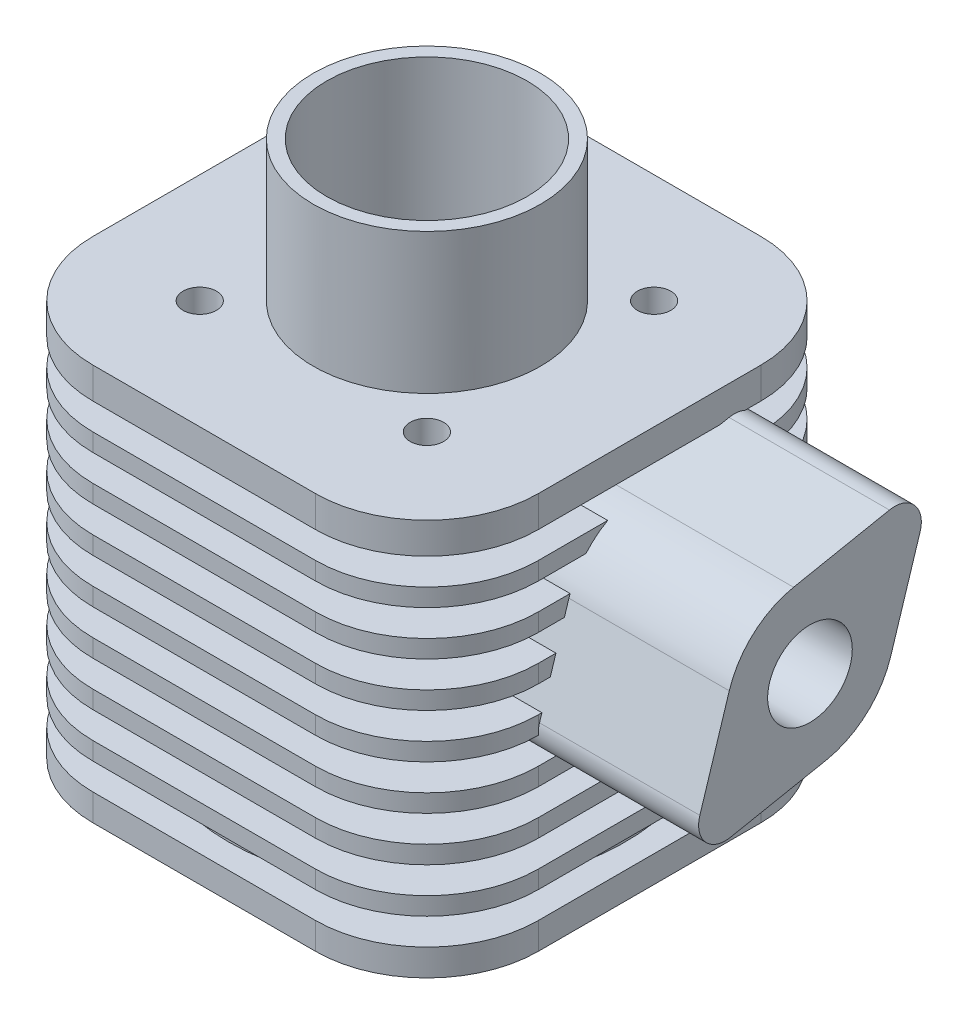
ISO-10303-21;
HEADER;
FILE_DESCRIPTION(('STEP AP214'),'2;1');
FILE_NAME('part.step','',(''),(''),'','','');
FILE_SCHEMA(('AUTOMOTIVE_DESIGN { 1 0 10303 214 1 1 1 1 }'));
ENDSEC;
DATA;
#1=APPLICATION_CONTEXT('core data for automotive mechanical design processes');
#2=APPLICATION_PROTOCOL_DEFINITION('international standard','automotive_design',2000,#1);
#3=PRODUCT_CONTEXT('',#1,'mechanical');
#4=PRODUCT('Part','Part','',(#3));
#5=PRODUCT_RELATED_PRODUCT_CATEGORY('part','',(#4));
#6=PRODUCT_DEFINITION_FORMATION('','',#4);
#7=PRODUCT_DEFINITION_CONTEXT('part definition',#1,'design');
#8=PRODUCT_DEFINITION('design','',#6,#7);
#9=PRODUCT_DEFINITION_SHAPE('','',#8);
#10=(LENGTH_UNIT() NAMED_UNIT(*) SI_UNIT(.MILLI.,.METRE.));
#11=(NAMED_UNIT(*) PLANE_ANGLE_UNIT() SI_UNIT($,.RADIAN.));
#12=(NAMED_UNIT(*) SI_UNIT($,.STERADIAN.) SOLID_ANGLE_UNIT());
#13=UNCERTAINTY_MEASURE_WITH_UNIT(LENGTH_MEASURE(1.E-05),#10,'distance_accuracy_value','');
#14=(GEOMETRIC_REPRESENTATION_CONTEXT(3) GLOBAL_UNCERTAINTY_ASSIGNED_CONTEXT((#13)) GLOBAL_UNIT_ASSIGNED_CONTEXT((#10,
#11,#12)) REPRESENTATION_CONTEXT('',''));
#15=CARTESIAN_POINT('',(0.,0.,0.));
#16=DIRECTION('',(0.,0.,1.));
#17=DIRECTION('',(1.,0.,0.));
#18=AXIS2_PLACEMENT_3D('',#15,#16,#17);
#19=CARTESIAN_POINT('',(100.,-64.,-49.9999999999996));
#20=DIRECTION('',(-1.,0.,0.));
#21=DIRECTION('',(0.,0.,1.));
#22=AXIS2_PLACEMENT_3D('',#19,#20,#21);
#23=PLANE('',#22);
#24=DIRECTION('',(0.,0.,1.));
#25=VECTOR('',#24,1.);
#26=CARTESIAN_POINT('',(100.,80.,-49.9999999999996));
#27=LINE('',#26,#25);
#28=CARTESIAN_POINT('',(100.,80.,28.6181760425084));
#29=VERTEX_POINT('',#28);
#30=CARTESIAN_POINT('',(100.,80.,49.9999999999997));
#31=VERTEX_POINT('',#30);
#32=EDGE_CURVE('E1258',#29,#31,#27,.T.);
#33=ORIENTED_EDGE('',*,*,#32,.F.);
#34=CARTESIAN_POINT('',(100.,55.,0.));
#35=DIRECTION('',(-1.,0.,0.));
#36=DIRECTION('',(0.,0.,1.));
#37=AXIS2_PLACEMENT_3D('',#34,#35,#36);
#38=CIRCLE('',#37,38.);
#39=CARTESIAN_POINT('',(100.,88.,18.8414436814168));
#40=VERTEX_POINT('',#39);
#41=EDGE_CURVE('E1913',#29,#40,#38,.T.);
#42=ORIENTED_EDGE('',*,*,#41,.T.);
#43=DIRECTION('',(0.,0.,-1.));
#44=VECTOR('',#43,1.);
#45=CARTESIAN_POINT('',(100.,88.,-49.9999999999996));
#46=LINE('',#45,#44);
#47=CARTESIAN_POINT('',(100.,88.,49.9999999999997));
#48=VERTEX_POINT('',#47);
#49=EDGE_CURVE('E1193',#48,#40,#46,.T.);
#50=ORIENTED_EDGE('',*,*,#49,.F.);
#51=DIRECTION('',(0.,1.,0.));
#52=VECTOR('',#51,1.);
#53=CARTESIAN_POINT('',(100.,-64.,49.9999999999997));
#54=LINE('',#53,#52);
#55=EDGE_CURVE('E1887',#31,#48,#54,.T.);
#56=ORIENTED_EDGE('',*,*,#55,.F.);
#57=EDGE_LOOP('',(#33,#42,#50,#56));
#58=FACE_BOUND('',#57,.T.);
#59=ADVANCED_FACE('F37',(#58),#23,.F.);
#60=DIRECTION('',(0.,0.953628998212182,-0.300984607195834));
#61=VECTOR('',#60,1.);
#62=CARTESIAN_POINT('',(100.,-27.430786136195,65.864605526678));
#63=LINE('',#62,#61);
#64=CARTESIAN_POINT('',(100.,60.,38.2696803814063));
#65=VERTEX_POINT('',#64);
#66=CARTESIAN_POINT('',(100.,66.4374150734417,36.2379019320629));
#67=VERTEX_POINT('',#66);
#68=EDGE_CURVE('E1947',#65,#67,#63,.T.);
#69=ORIENTED_EDGE('',*,*,#68,.T.);
#70=CARTESIAN_POINT('',(100.,55.,0.));
#71=DIRECTION('',(-1.,0.,0.));
#72=DIRECTION('',(0.,0.,1.));
#73=AXIS2_PLACEMENT_3D('',#70,#71,#72);
#74=CIRCLE('',#73,38.);
#75=CARTESIAN_POINT('',(100.,68.,35.7071421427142));
#76=VERTEX_POINT('',#75);
#77=EDGE_CURVE('E1902',#67,#76,#74,.T.);
#78=ORIENTED_EDGE('',*,*,#77,.T.);
#79=DIRECTION('',(0.,0.,-1.));
#80=VECTOR('',#79,1.);
#81=CARTESIAN_POINT('',(100.,68.,-49.9999999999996));
#82=LINE('',#81,#80);
#83=CARTESIAN_POINT('',(100.,68.,49.9999999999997));
#84=VERTEX_POINT('',#83);
#85=EDGE_CURVE('E1239',#84,#76,#82,.T.);
#86=ORIENTED_EDGE('',*,*,#85,.F.);
#87=CARTESIAN_POINT('',(100.,60.,49.9999999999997));
#88=VERTEX_POINT('',#87);
#89=EDGE_CURVE('E1889',#88,#84,#54,.T.);
#90=ORIENTED_EDGE('',*,*,#89,.F.);
#91=DIRECTION('',(0.,0.,1.));
#92=VECTOR('',#91,1.);
#93=CARTESIAN_POINT('',(100.,60.,-49.9999999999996));
#94=LINE('',#93,#92);
#95=EDGE_CURVE('E1304',#65,#88,#94,.T.);
#96=ORIENTED_EDGE('',*,*,#95,.F.);
#97=EDGE_LOOP('',(#69,#78,#86,#90,#96));
#98=FACE_BOUND('',#97,.T.);
#99=ADVANCED_FACE('F868',(#98),#23,.F.);
#100=DIRECTION('',(0.,-0.953628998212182,0.300984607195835));
#101=VECTOR('',#100,1.);
#102=CARTESIAN_POINT('',(100.,-50.3056162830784,-6.61119833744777));
#103=LINE('',#102,#101);
#104=CARTESIAN_POINT('',(100.,48.,-37.6384399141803));
#105=VERTEX_POINT('',#104);
#106=CARTESIAN_POINT('',(100.,43.5625849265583,-36.2379019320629));
#107=VERTEX_POINT('',#106);
#108=EDGE_CURVE('E1934',#105,#107,#103,.T.);
#109=ORIENTED_EDGE('',*,*,#108,.T.);
#110=CARTESIAN_POINT('',(100.,55.,0.));
#111=DIRECTION('',(-1.,0.,0.));
#112=DIRECTION('',(0.,0.,1.));
#113=AXIS2_PLACEMENT_3D('',#110,#111,#112);
#114=CIRCLE('',#113,38.);
#115=CARTESIAN_POINT('',(100.,40.,-34.9141805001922));
#116=VERTEX_POINT('',#115);
#117=EDGE_CURVE('E1024',#107,#116,#114,.T.);
#118=ORIENTED_EDGE('',*,*,#117,.T.);
#119=DIRECTION('',(0.,0.,1.));
#120=VECTOR('',#119,1.);
#121=CARTESIAN_POINT('',(100.,40.,-49.9999999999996));
#122=LINE('',#121,#120);
#123=CARTESIAN_POINT('',(100.,40.,-49.9999999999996));
#124=VERTEX_POINT('',#123);
#125=EDGE_CURVE('E1351',#124,#116,#122,.T.);
#126=ORIENTED_EDGE('',*,*,#125,.F.);
#127=DIRECTION('',(0.,1.,0.));
#128=VECTOR('',#127,1.);
#129=CARTESIAN_POINT('',(100.,-64.,-49.9999999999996));
#130=LINE('',#129,#128);
#131=CARTESIAN_POINT('',(100.,48.,-49.9999999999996));
#132=VERTEX_POINT('',#131);
#133=EDGE_CURVE('E2028',#124,#132,#130,.T.);
#134=ORIENTED_EDGE('',*,*,#133,.T.);
#135=DIRECTION('',(0.,0.,-1.));
#136=VECTOR('',#135,1.);
#137=CARTESIAN_POINT('',(100.,48.,-49.9999999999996));
#138=LINE('',#137,#136);
#139=EDGE_CURVE('E1284',#105,#132,#138,.T.);
#140=ORIENTED_EDGE('',*,*,#139,.F.);
#141=EDGE_LOOP('',(#109,#118,#126,#134,#140));
#142=FACE_BOUND('',#141,.T.);
#143=ADVANCED_FACE('F875',(#142),#23,.F.);
#144=CARTESIAN_POINT('',(100.,20.9852972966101,38.));
#145=DIRECTION('',(-1.,0.,0.));
#146=DIRECTION('',(0.,0.,1.));
#147=AXIS2_PLACEMENT_3D('',#144,#145,#146);
#148=CIRCLE('',#147,12.);
#149=CARTESIAN_POINT('',(100.,20.9852972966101,49.9999999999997));
#150=VERTEX_POINT('',#149);
#151=CARTESIAN_POINT('',(100.,24.5971125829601,49.4435479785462));
#152=VERTEX_POINT('',#151);
#153=EDGE_CURVE('E1021',#150,#152,#148,.T.);
#154=ORIENTED_EDGE('',*,*,#153,.T.);
#155=DIRECTION('',(0.,0.953628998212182,-0.300984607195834));
#156=VECTOR('',#155,1.);
#157=CARTESIAN_POINT('',(100.,-27.430786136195,65.864605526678));
#158=LINE('',#157,#156);
#159=CARTESIAN_POINT('',(100.,28.,48.3695278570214));
#160=VERTEX_POINT('',#159);
#161=EDGE_CURVE('E1952',#152,#160,#158,.T.);
#162=ORIENTED_EDGE('',*,*,#161,.T.);
#163=DIRECTION('',(0.,0.,-1.));
#164=VECTOR('',#163,1.);
#165=CARTESIAN_POINT('',(100.,28.,-49.9999999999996));
#166=LINE('',#165,#164);
#167=CARTESIAN_POINT('',(100.,28.,49.9999999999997));
#168=VERTEX_POINT('',#167);
#169=EDGE_CURVE('E1331',#168,#160,#166,.T.);
#170=ORIENTED_EDGE('',*,*,#169,.F.);
#171=EDGE_CURVE('E1606',#150,#168,#54,.T.);
#172=ORIENTED_EDGE('',*,*,#171,.F.);
#173=EDGE_LOOP('',(#154,#162,#170,#172));
#174=FACE_BOUND('',#173,.T.);
#175=ADVANCED_FACE('F994',(#174),#23,.F.);
#176=DIRECTION('',(0.,0.,1.));
#177=VECTOR('',#176,1.);
#178=CARTESIAN_POINT('',(100.,20.,-49.9999999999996));
#179=LINE('',#178,#177);
#180=CARTESIAN_POINT('',(100.,20.,49.9594811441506));
#181=VERTEX_POINT('',#180);
#182=CARTESIAN_POINT('',(100.,20.,49.9999999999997));
#183=VERTEX_POINT('',#182);
#184=EDGE_CURVE('E1005',#181,#183,#179,.T.);
#185=ORIENTED_EDGE('',*,*,#184,.F.);
#186=EDGE_CURVE('E1007',#181,#150,#148,.T.);
#187=ORIENTED_EDGE('',*,*,#186,.T.);
#188=EDGE_CURVE('E1010',#183,#150,#54,.T.);
#189=ORIENTED_EDGE('',*,*,#188,.F.);
#190=EDGE_LOOP('',(#185,#187,#189));
#191=FACE_BOUND('',#190,.T.);
#192=ADVANCED_FACE('F987',(#191),#23,.F.);
#193=CARTESIAN_POINT('',(-49.9999999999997,-64.,-100.));
#194=DIRECTION('',(0.,0.,1.));
#195=DIRECTION('',(1.,0.,0.));
#196=AXIS2_PLACEMENT_3D('',#193,#194,#195);
#197=PLANE('',#196);
#198=DIRECTION('',(1.,0.,0.));
#199=VECTOR('',#198,1.);
#200=CARTESIAN_POINT('',(-49.9999999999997,100.,-100.));
#201=LINE('',#200,#199);
#202=CARTESIAN_POINT('',(-50.,100.,-100.));
#203=VERTEX_POINT('',#202);
#204=CARTESIAN_POINT('',(50.,100.,-100.));
#205=VERTEX_POINT('',#204);
#206=EDGE_CURVE('E1218',#203,#205,#201,.T.);
#207=ORIENTED_EDGE('',*,*,#206,.F.);
#208=DIRECTION('',(0.,1.,0.));
#209=VECTOR('',#208,1.);
#210=CARTESIAN_POINT('',(-49.9999999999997,-64.,-100.));
#211=LINE('',#210,#209);
#212=CARTESIAN_POINT('',(-49.9999999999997,114.,-100.));
#213=VERTEX_POINT('',#212);
#214=EDGE_CURVE('E1575',#203,#213,#211,.T.);
#215=ORIENTED_EDGE('',*,*,#214,.T.);
#216=DIRECTION('',(1.,0.,0.));
#217=VECTOR('',#216,1.);
#218=CARTESIAN_POINT('',(-49.9999999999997,114.,-100.));
#219=LINE('',#218,#217);
#220=CARTESIAN_POINT('',(49.9999999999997,114.,-100.));
#221=VERTEX_POINT('',#220);
#222=EDGE_CURVE('E1529',#213,#221,#219,.T.);
#223=ORIENTED_EDGE('',*,*,#222,.T.);
#224=DIRECTION('',(0.,1.,0.));
#225=VECTOR('',#224,1.);
#226=CARTESIAN_POINT('',(49.9999999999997,-64.,-100.));
#227=LINE('',#226,#225);
#228=EDGE_CURVE('E1610',#205,#221,#227,.T.);
#229=ORIENTED_EDGE('',*,*,#228,.F.);
#230=EDGE_LOOP('',(#207,#215,#223,#229));
#231=FACE_BOUND('',#230,.T.);
#232=ADVANCED_FACE('F993',(#231),#197,.F.);
#233=DIRECTION('',(-1.,0.,0.));
#234=VECTOR('',#233,1.);
#235=CARTESIAN_POINT('',(-49.9999999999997,88.,-100.));
#236=LINE('',#235,#234);
#237=CARTESIAN_POINT('',(49.9999999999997,88.,-100.));
#238=VERTEX_POINT('',#237);
#239=CARTESIAN_POINT('',(-49.9999999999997,88.,-100.));
#240=VERTEX_POINT('',#239);
#241=EDGE_CURVE('E1198',#238,#240,#236,.T.);
#242=ORIENTED_EDGE('',*,*,#241,.F.);
#243=CARTESIAN_POINT('',(50.,80.,-100.));
#244=VERTEX_POINT('',#243);
#245=EDGE_CURVE('E2159',#244,#238,#227,.T.);
#246=ORIENTED_EDGE('',*,*,#245,.F.);
#247=DIRECTION('',(1.,0.,0.));
#248=VECTOR('',#247,1.);
#249=CARTESIAN_POINT('',(-49.9999999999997,80.,-100.));
#250=LINE('',#249,#248);
#251=CARTESIAN_POINT('',(-50.,80.,-100.));
#252=VERTEX_POINT('',#251);
#253=EDGE_CURVE('E1264',#252,#244,#250,.T.);
#254=ORIENTED_EDGE('',*,*,#253,.F.);
#255=EDGE_CURVE('E2085',#252,#240,#211,.T.);
#256=ORIENTED_EDGE('',*,*,#255,.T.);
#257=EDGE_LOOP('',(#242,#246,#254,#256));
#258=FACE_BOUND('',#257,.T.);
#259=ADVANCED_FACE('F1000',(#258),#197,.F.);
#260=CARTESIAN_POINT('',(50.,-64.,-50.));
#261=DIRECTION('',(0.,1.,0.));
#262=DIRECTION('',(0.,0.,1.));
#263=AXIS2_PLACEMENT_3D('',#260,#261,#262);
#264=CYLINDRICAL_SURFACE('',#263,50.);
#265=CARTESIAN_POINT('',(50.,100.,-50.));
#266=DIRECTION('',(0.,-1.,0.));
#267=DIRECTION('',(0.,0.,-1.));
#268=AXIS2_PLACEMENT_3D('',#265,#266,#267);
#269=CIRCLE('',#268,50.);
#270=CARTESIAN_POINT('',(100.,100.,-49.9999999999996));
#271=VERTEX_POINT('',#270);
#272=EDGE_CURVE('E1216',#205,#271,#269,.T.);
#273=ORIENTED_EDGE('',*,*,#272,.F.);
#274=ORIENTED_EDGE('',*,*,#228,.T.);
#275=CARTESIAN_POINT('',(50.,114.,-50.));
#276=DIRECTION('',(0.,-1.,0.));
#277=DIRECTION('',(0.,0.,-1.));
#278=AXIS2_PLACEMENT_3D('',#275,#276,#277);
#279=CIRCLE('',#278,50.);
#280=CARTESIAN_POINT('',(100.,114.,-49.9999999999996));
#281=VERTEX_POINT('',#280);
#282=EDGE_CURVE('E1532',#221,#281,#279,.T.);
#283=ORIENTED_EDGE('',*,*,#282,.T.);
#284=EDGE_CURVE('E1604',#271,#281,#130,.T.);
#285=ORIENTED_EDGE('',*,*,#284,.F.);
#286=EDGE_LOOP('',(#273,#274,#283,#285));
#287=FACE_BOUND('',#286,.T.);
#288=ADVANCED_FACE('F893',(#287),#264,.T.);
#289=CARTESIAN_POINT('',(50.,88.,-50.));
#290=DIRECTION('',(0.,1.,0.));
#291=DIRECTION('',(0.,0.,1.));
#292=AXIS2_PLACEMENT_3D('',#289,#290,#291);
#293=CIRCLE('',#292,50.);
#294=CARTESIAN_POINT('',(100.,88.,-49.9999999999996));
#295=VERTEX_POINT('',#294);
#296=EDGE_CURVE('E1196',#295,#238,#293,.T.);
#297=ORIENTED_EDGE('',*,*,#296,.F.);
#298=CARTESIAN_POINT('',(100.,80.,-49.9999999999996));
#299=VERTEX_POINT('',#298);
#300=EDGE_CURVE('E2022',#299,#295,#130,.T.);
#301=ORIENTED_EDGE('',*,*,#300,.F.);
#302=CARTESIAN_POINT('',(50.,80.,-50.));
#303=DIRECTION('',(0.,-1.,0.));
#304=DIRECTION('',(0.,0.,-1.));
#305=AXIS2_PLACEMENT_3D('',#302,#303,#304);
#306=CIRCLE('',#305,50.);
#307=EDGE_CURVE('E1262',#244,#299,#306,.T.);
#308=ORIENTED_EDGE('',*,*,#307,.F.);
#309=ORIENTED_EDGE('',*,*,#245,.T.);
#310=EDGE_LOOP('',(#297,#301,#308,#309));
#311=FACE_BOUND('',#310,.T.);
#312=ADVANCED_FACE('F978',(#311),#264,.T.);
#313=DIRECTION('',(0.,0.,1.));
#314=VECTOR('',#313,1.);
#315=CARTESIAN_POINT('',(100.,100.,-49.9999999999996));
#316=LINE('',#315,#314);
#317=CARTESIAN_POINT('',(100.,100.,-31.6921005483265));
#318=VERTEX_POINT('',#317);
#319=CARTESIAN_POINT('',(100.,100.,49.9999999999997));
#320=VERTEX_POINT('',#319);
#321=EDGE_CURVE('E1212',#318,#320,#316,.T.);
#322=ORIENTED_EDGE('',*,*,#321,.F.);
#323=DIRECTION('',(0.,0.193921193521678,-0.9810171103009));
#324=VECTOR('',#323,1.);
#325=CARTESIAN_POINT('',(100.,97.3156045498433,-18.1121621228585));
#326=LINE('',#325,#324);
#327=CARTESIAN_POINT('',(100.,100.786908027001,-35.6729456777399));
#328=VERTEX_POINT('',#327);
#329=EDGE_CURVE('E58',#318,#328,#326,.T.);
#330=ORIENTED_EDGE('',*,*,#329,.T.);
#331=CARTESIAN_POINT('',(100.,89.0147027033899,-38.));
#332=DIRECTION('',(-1.,0.,0.));
#333=DIRECTION('',(0.,0.,1.));
#334=AXIS2_PLACEMENT_3D('',#331,#332,#333);
#335=CIRCLE('',#334,12.);
#336=CARTESIAN_POINT('',(100.,100.,-42.8294143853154));
#337=VERTEX_POINT('',#336);
#338=EDGE_CURVE('E2002',#328,#337,#335,.T.);
#339=ORIENTED_EDGE('',*,*,#338,.T.);
#340=EDGE_CURVE('E1213',#271,#337,#316,.T.);
#341=ORIENTED_EDGE('',*,*,#340,.F.);
#342=ORIENTED_EDGE('',*,*,#284,.T.);
#343=DIRECTION('',(0.,0.,1.));
#344=VECTOR('',#343,1.);
#345=CARTESIAN_POINT('',(100.,114.,-49.9999999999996));
#346=LINE('',#345,#344);
#347=CARTESIAN_POINT('',(100.,114.,49.9999999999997));
#348=VERTEX_POINT('',#347);
#349=EDGE_CURVE('E1535',#281,#348,#346,.T.);
#350=ORIENTED_EDGE('',*,*,#349,.T.);
#351=EDGE_CURVE('E1599',#320,#348,#54,.T.);
#352=ORIENTED_EDGE('',*,*,#351,.F.);
#353=EDGE_LOOP('',(#322,#330,#339,#341,#342,#350,#352));
#354=FACE_BOUND('',#353,.T.);
#355=ADVANCED_FACE('F981',(#354),#23,.F.);
#356=CARTESIAN_POINT('',(100.,89.0147027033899,-38.));
#357=DIRECTION('',(-1.,0.,0.));
#358=DIRECTION('',(0.,0.,1.));
#359=AXIS2_PLACEMENT_3D('',#356,#357,#358);
#360=CIRCLE('',#359,12.);
#361=CARTESIAN_POINT('',(100.,88.,-49.9570221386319));
#362=VERTEX_POINT('',#361);
#363=CARTESIAN_POINT('',(100.,85.4028874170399,-49.4435479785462));
#364=VERTEX_POINT('',#363);
#365=EDGE_CURVE('E66',#362,#364,#360,.T.);
#366=ORIENTED_EDGE('',*,*,#365,.T.);
#367=DIRECTION('',(0.,-0.953628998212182,0.300984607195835));
#368=VECTOR('',#367,1.);
#369=CARTESIAN_POINT('',(100.,-50.3056162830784,-6.61119833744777));
#370=LINE('',#369,#368);
#371=CARTESIAN_POINT('',(100.,80.,-47.7382873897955));
#372=VERTEX_POINT('',#371);
#373=EDGE_CURVE('E757',#364,#372,#370,.T.);
#374=ORIENTED_EDGE('',*,*,#373,.T.);
#375=EDGE_CURVE('E1259',#299,#372,#27,.T.);
#376=ORIENTED_EDGE('',*,*,#375,.F.);
#377=ORIENTED_EDGE('',*,*,#300,.T.);
#378=EDGE_CURVE('E1192',#362,#295,#46,.T.);
#379=ORIENTED_EDGE('',*,*,#378,.F.);
#380=EDGE_LOOP('',(#366,#374,#376,#377,#379));
#381=FACE_BOUND('',#380,.T.);
#382=ADVANCED_FACE('F968',(#381),#23,.F.);
#383=CARTESIAN_POINT('',(50.,-64.,50.));
#384=DIRECTION('',(0.,1.,0.));
#385=DIRECTION('',(0.,0.,1.));
#386=AXIS2_PLACEMENT_3D('',#383,#384,#385);
#387=CYLINDRICAL_SURFACE('',#386,50.);
#388=DIRECTION('',(0.,1.,0.));
#389=VECTOR('',#388,1.);
#390=CARTESIAN_POINT('',(49.9999999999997,-64.,100.));
#391=LINE('',#390,#389);
#392=CARTESIAN_POINT('',(49.9999999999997,100.,100.));
#393=VERTEX_POINT('',#392);
#394=CARTESIAN_POINT('',(49.9999999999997,114.,100.));
#395=VERTEX_POINT('',#394);
#396=EDGE_CURVE('E1594',#393,#395,#391,.T.);
#397=ORIENTED_EDGE('',*,*,#396,.F.);
#398=CARTESIAN_POINT('',(50.,100.,50.));
#399=DIRECTION('',(0.,-1.,0.));
#400=DIRECTION('',(0.,0.,-1.));
#401=AXIS2_PLACEMENT_3D('',#398,#399,#400);
#402=CIRCLE('',#401,50.);
#403=EDGE_CURVE('E1209',#393,#320,#402,.F.);
#404=ORIENTED_EDGE('',*,*,#403,.T.);
#405=ORIENTED_EDGE('',*,*,#351,.T.);
#406=CARTESIAN_POINT('',(50.,114.,50.));
#407=DIRECTION('',(0.,1.,0.));
#408=DIRECTION('',(0.,0.,1.));
#409=AXIS2_PLACEMENT_3D('',#406,#407,#408);
#410=CIRCLE('',#409,50.);
#411=EDGE_CURVE('E1538',#395,#348,#410,.T.);
#412=ORIENTED_EDGE('',*,*,#411,.F.);
#413=EDGE_LOOP('',(#397,#404,#405,#412));
#414=FACE_BOUND('',#413,.T.);
#415=ADVANCED_FACE('F890',(#414),#387,.T.);
#416=ORIENTED_EDGE('',*,*,#55,.T.);
#417=CARTESIAN_POINT('',(50.,88.,50.));
#418=DIRECTION('',(0.,1.,0.));
#419=DIRECTION('',(0.,0.,1.));
#420=AXIS2_PLACEMENT_3D('',#417,#418,#419);
#421=CIRCLE('',#420,50.);
#422=CARTESIAN_POINT('',(49.9999999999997,88.,100.));
#423=VERTEX_POINT('',#422);
#424=EDGE_CURVE('E1189',#48,#423,#421,.F.);
#425=ORIENTED_EDGE('',*,*,#424,.T.);
#426=CARTESIAN_POINT('',(49.9999999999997,80.,100.));
#427=VERTEX_POINT('',#426);
#428=EDGE_CURVE('E1872',#427,#423,#391,.T.);
#429=ORIENTED_EDGE('',*,*,#428,.F.);
#430=CARTESIAN_POINT('',(50.,80.,50.));
#431=DIRECTION('',(0.,-1.,0.));
#432=DIRECTION('',(0.,0.,-1.));
#433=AXIS2_PLACEMENT_3D('',#430,#431,#432);
#434=CIRCLE('',#433,50.);
#435=EDGE_CURVE('E1255',#427,#31,#434,.F.);
#436=ORIENTED_EDGE('',*,*,#435,.T.);
#437=EDGE_LOOP('',(#416,#425,#429,#436));
#438=FACE_BOUND('',#437,.T.);
#439=ADVANCED_FACE('F975',(#438),#387,.T.);
#440=CARTESIAN_POINT('',(-49.9999999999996,-64.,100.));
#441=DIRECTION('',(0.,0.,1.));
#442=DIRECTION('',(1.,0.,0.));
#443=AXIS2_PLACEMENT_3D('',#440,#441,#442);
#444=PLANE('',#443);
#445=DIRECTION('',(0.,1.,0.));
#446=VECTOR('',#445,1.);
#447=CARTESIAN_POINT('',(-50.,-64.,100.));
#448=LINE('',#447,#446);
#449=CARTESIAN_POINT('',(-50.,100.,100.));
#450=VERTEX_POINT('',#449);
#451=CARTESIAN_POINT('',(-50.,114.,100.));
#452=VERTEX_POINT('',#451);
#453=EDGE_CURVE('E1589',#450,#452,#448,.T.);
#454=ORIENTED_EDGE('',*,*,#453,.F.);
#455=DIRECTION('',(1.,0.,0.));
#456=VECTOR('',#455,1.);
#457=CARTESIAN_POINT('',(-49.9999999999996,100.,100.));
#458=LINE('',#457,#456);
#459=EDGE_CURVE('E1206',#450,#393,#458,.T.);
#460=ORIENTED_EDGE('',*,*,#459,.T.);
#461=ORIENTED_EDGE('',*,*,#396,.T.);
#462=DIRECTION('',(1.,0.,0.));
#463=VECTOR('',#462,1.);
#464=CARTESIAN_POINT('',(-49.9999999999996,114.,100.));
#465=LINE('',#464,#463);
#466=EDGE_CURVE('E1541',#452,#395,#465,.T.);
#467=ORIENTED_EDGE('',*,*,#466,.F.);
#468=EDGE_LOOP('',(#454,#460,#461,#467));
#469=FACE_BOUND('',#468,.T.);
#470=ADVANCED_FACE('F1805',(#469),#444,.T.);
#471=ORIENTED_EDGE('',*,*,#428,.T.);
#472=DIRECTION('',(-1.,0.,0.));
#473=VECTOR('',#472,1.);
#474=CARTESIAN_POINT('',(-49.9999999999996,88.,100.));
#475=LINE('',#474,#473);
#476=CARTESIAN_POINT('',(-50.,88.,100.));
#477=VERTEX_POINT('',#476);
#478=EDGE_CURVE('E1186',#423,#477,#475,.T.);
#479=ORIENTED_EDGE('',*,*,#478,.T.);
#480=CARTESIAN_POINT('',(-50.,80.,100.));
#481=VERTEX_POINT('',#480);
#482=EDGE_CURVE('E2223',#481,#477,#448,.T.);
#483=ORIENTED_EDGE('',*,*,#482,.F.);
#484=DIRECTION('',(1.,0.,0.));
#485=VECTOR('',#484,1.);
#486=CARTESIAN_POINT('',(-49.9999999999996,80.,100.));
#487=LINE('',#486,#485);
#488=EDGE_CURVE('E1252',#481,#427,#487,.T.);
#489=ORIENTED_EDGE('',*,*,#488,.T.);
#490=EDGE_LOOP('',(#471,#479,#483,#489));
#491=FACE_BOUND('',#490,.T.);
#492=ADVANCED_FACE('F1809',(#491),#444,.T.);
#493=CARTESIAN_POINT('',(-50.,-64.,50.));
#494=DIRECTION('',(0.,1.,0.));
#495=DIRECTION('',(0.,0.,1.));
#496=AXIS2_PLACEMENT_3D('',#493,#494,#495);
#497=CYLINDRICAL_SURFACE('',#496,50.);
#498=DIRECTION('',(0.,1.,0.));
#499=VECTOR('',#498,1.);
#500=CARTESIAN_POINT('',(-100.,-64.,49.9999999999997));
#501=LINE('',#500,#499);
#502=CARTESIAN_POINT('',(-100.,100.,49.9999999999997));
#503=VERTEX_POINT('',#502);
#504=CARTESIAN_POINT('',(-100.,114.,49.9999999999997));
#505=VERTEX_POINT('',#504);
#506=EDGE_CURVE('E1584',#503,#505,#501,.T.);
#507=ORIENTED_EDGE('',*,*,#506,.F.);
#508=CARTESIAN_POINT('',(-50.,100.,50.));
#509=DIRECTION('',(0.,-1.,0.));
#510=DIRECTION('',(0.,0.,-1.));
#511=AXIS2_PLACEMENT_3D('',#508,#509,#510);
#512=CIRCLE('',#511,50.);
#513=EDGE_CURVE('E1203',#503,#450,#512,.F.);
#514=ORIENTED_EDGE('',*,*,#513,.T.);
#515=ORIENTED_EDGE('',*,*,#453,.T.);
#516=CARTESIAN_POINT('',(-50.,114.,50.));
#517=DIRECTION('',(0.,1.,0.));
#518=DIRECTION('',(0.,0.,1.));
#519=AXIS2_PLACEMENT_3D('',#516,#517,#518);
#520=CIRCLE('',#519,50.);
#521=EDGE_CURVE('E1544',#505,#452,#520,.T.);
#522=ORIENTED_EDGE('',*,*,#521,.F.);
#523=EDGE_LOOP('',(#507,#514,#515,#522));
#524=FACE_BOUND('',#523,.T.);
#525=ADVANCED_FACE('F1801',(#524),#497,.T.);
#526=ORIENTED_EDGE('',*,*,#482,.T.);
#527=CARTESIAN_POINT('',(-50.,88.,50.));
#528=DIRECTION('',(0.,1.,0.));
#529=DIRECTION('',(0.,0.,1.));
#530=AXIS2_PLACEMENT_3D('',#527,#528,#529);
#531=CIRCLE('',#530,50.);
#532=CARTESIAN_POINT('',(-100.,88.,49.9999999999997));
#533=VERTEX_POINT('',#532);
#534=EDGE_CURVE('E1183',#477,#533,#531,.F.);
#535=ORIENTED_EDGE('',*,*,#534,.T.);
#536=CARTESIAN_POINT('',(-100.,80.,49.9999999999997));
#537=VERTEX_POINT('',#536);
#538=EDGE_CURVE('E2103',#537,#533,#501,.T.);
#539=ORIENTED_EDGE('',*,*,#538,.F.);
#540=CARTESIAN_POINT('',(-50.,80.,50.));
#541=DIRECTION('',(0.,-1.,0.));
#542=DIRECTION('',(0.,0.,-1.));
#543=AXIS2_PLACEMENT_3D('',#540,#541,#542);
#544=CIRCLE('',#543,50.);
#545=EDGE_CURVE('E1249',#537,#481,#544,.F.);
#546=ORIENTED_EDGE('',*,*,#545,.T.);
#547=EDGE_LOOP('',(#526,#535,#539,#546));
#548=FACE_BOUND('',#547,.T.);
#549=ADVANCED_FACE('F1862',(#548),#497,.T.);
#550=CARTESIAN_POINT('',(-100.,-64.,-49.9999999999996));
#551=DIRECTION('',(-1.,0.,0.));
#552=DIRECTION('',(0.,0.,1.));
#553=AXIS2_PLACEMENT_3D('',#550,#551,#552);
#554=PLANE('',#553);
#555=DIRECTION('',(0.,1.,0.));
#556=VECTOR('',#555,1.);
#557=CARTESIAN_POINT('',(-100.,-64.,-49.9999999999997));
#558=LINE('',#557,#556);
#559=CARTESIAN_POINT('',(-100.,100.,-49.9999999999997));
#560=VERTEX_POINT('',#559);
#561=CARTESIAN_POINT('',(-100.,114.,-49.9999999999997));
#562=VERTEX_POINT('',#561);
#563=EDGE_CURVE('E1579',#560,#562,#558,.T.);
#564=ORIENTED_EDGE('',*,*,#563,.F.);
#565=DIRECTION('',(0.,0.,1.));
#566=VECTOR('',#565,1.);
#567=CARTESIAN_POINT('',(-100.,100.,-49.9999999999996));
#568=LINE('',#567,#566);
#569=EDGE_CURVE('E1200',#560,#503,#568,.T.);
#570=ORIENTED_EDGE('',*,*,#569,.T.);
#571=ORIENTED_EDGE('',*,*,#506,.T.);
#572=DIRECTION('',(0.,0.,1.));
#573=VECTOR('',#572,1.);
#574=CARTESIAN_POINT('',(-100.,114.,-49.9999999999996));
#575=LINE('',#574,#573);
#576=EDGE_CURVE('E1547',#562,#505,#575,.T.);
#577=ORIENTED_EDGE('',*,*,#576,.F.);
#578=EDGE_LOOP('',(#564,#570,#571,#577));
#579=FACE_BOUND('',#578,.T.);
#580=ADVANCED_FACE('F1796',(#579),#554,.T.);
#581=ORIENTED_EDGE('',*,*,#538,.T.);
#582=DIRECTION('',(0.,0.,-1.));
#583=VECTOR('',#582,1.);
#584=CARTESIAN_POINT('',(-100.,88.,-49.9999999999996));
#585=LINE('',#584,#583);
#586=CARTESIAN_POINT('',(-100.,88.,-49.9999999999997));
#587=VERTEX_POINT('',#586);
#588=EDGE_CURVE('E1180',#533,#587,#585,.T.);
#589=ORIENTED_EDGE('',*,*,#588,.T.);
#590=CARTESIAN_POINT('',(-100.,80.,-49.9999999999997));
#591=VERTEX_POINT('',#590);
#592=EDGE_CURVE('E2171',#591,#587,#558,.T.);
#593=ORIENTED_EDGE('',*,*,#592,.F.);
#594=DIRECTION('',(0.,0.,1.));
#595=VECTOR('',#594,1.);
#596=CARTESIAN_POINT('',(-100.,80.,-49.9999999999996));
#597=LINE('',#596,#595);
#598=EDGE_CURVE('E1246',#591,#537,#597,.T.);
#599=ORIENTED_EDGE('',*,*,#598,.T.);
#600=EDGE_LOOP('',(#581,#589,#593,#599));
#601=FACE_BOUND('',#600,.T.);
#602=ADVANCED_FACE('F2252',(#601),#554,.T.);
#603=CARTESIAN_POINT('',(-50.,-64.,-50.));
#604=DIRECTION('',(0.,1.,0.));
#605=DIRECTION('',(0.,0.,1.));
#606=AXIS2_PLACEMENT_3D('',#603,#604,#605);
#607=CYLINDRICAL_SURFACE('',#606,50.);
#608=ORIENTED_EDGE('',*,*,#214,.F.);
#609=CARTESIAN_POINT('',(-50.,100.,-50.));
#610=DIRECTION('',(0.,-1.,0.));
#611=DIRECTION('',(0.,0.,-1.));
#612=AXIS2_PLACEMENT_3D('',#609,#610,#611);
#613=CIRCLE('',#612,50.);
#614=EDGE_CURVE('E1664',#203,#560,#613,.F.);
#615=ORIENTED_EDGE('',*,*,#614,.T.);
#616=ORIENTED_EDGE('',*,*,#563,.T.);
#617=CARTESIAN_POINT('',(-50.,114.,-50.));
#618=DIRECTION('',(0.,1.,0.));
#619=DIRECTION('',(0.,0.,1.));
#620=AXIS2_PLACEMENT_3D('',#617,#618,#619);
#621=CIRCLE('',#620,50.);
#622=EDGE_CURVE('E1550',#213,#562,#621,.T.);
#623=ORIENTED_EDGE('',*,*,#622,.F.);
#624=EDGE_LOOP('',(#608,#615,#616,#623));
#625=FACE_BOUND('',#624,.T.);
#626=ADVANCED_FACE('F1790',(#625),#607,.T.);
#627=ORIENTED_EDGE('',*,*,#592,.T.);
#628=CARTESIAN_POINT('',(-50.,88.,-50.));
#629=DIRECTION('',(0.,1.,0.));
#630=DIRECTION('',(0.,0.,1.));
#631=AXIS2_PLACEMENT_3D('',#628,#629,#630);
#632=CIRCLE('',#631,50.);
#633=EDGE_CURVE('E1661',#587,#240,#632,.F.);
#634=ORIENTED_EDGE('',*,*,#633,.T.);
#635=ORIENTED_EDGE('',*,*,#255,.F.);
#636=CARTESIAN_POINT('',(-50.,80.,-50.));
#637=DIRECTION('',(0.,-1.,0.));
#638=DIRECTION('',(0.,0.,-1.));
#639=AXIS2_PLACEMENT_3D('',#636,#637,#638);
#640=CIRCLE('',#639,50.);
#641=EDGE_CURVE('E1658',#252,#591,#640,.F.);
#642=ORIENTED_EDGE('',*,*,#641,.T.);
#643=EDGE_LOOP('',(#627,#634,#635,#642));
#644=FACE_BOUND('',#643,.T.);
#645=ADVANCED_FACE('F2169',(#644),#607,.T.);
#646=DIRECTION('',(-1.,0.,0.));
#647=VECTOR('',#646,1.);
#648=CARTESIAN_POINT('',(-49.9999999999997,68.,-100.));
#649=LINE('',#648,#647);
#650=CARTESIAN_POINT('',(49.9999999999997,68.,-100.));
#651=VERTEX_POINT('',#650);
#652=CARTESIAN_POINT('',(-49.9999999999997,68.,-100.));
#653=VERTEX_POINT('',#652);
#654=EDGE_CURVE('E1244',#651,#653,#649,.T.);
#655=ORIENTED_EDGE('',*,*,#654,.F.);
#656=CARTESIAN_POINT('',(50.,60.,-100.));
#657=VERTEX_POINT('',#656);
#658=EDGE_CURVE('E2155',#657,#651,#227,.T.);
#659=ORIENTED_EDGE('',*,*,#658,.F.);
#660=DIRECTION('',(1.,0.,0.));
#661=VECTOR('',#660,1.);
#662=CARTESIAN_POINT('',(-49.9999999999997,60.,-100.));
#663=LINE('',#662,#661);
#664=CARTESIAN_POINT('',(-50.,60.,-100.));
#665=VERTEX_POINT('',#664);
#666=EDGE_CURVE('E1310',#665,#657,#663,.T.);
#667=ORIENTED_EDGE('',*,*,#666,.F.);
#668=EDGE_CURVE('E2079',#665,#653,#211,.T.);
#669=ORIENTED_EDGE('',*,*,#668,.T.);
#670=EDGE_LOOP('',(#655,#659,#667,#669));
#671=FACE_BOUND('',#670,.T.);
#672=ADVANCED_FACE('F976',(#671),#197,.F.);
#673=CARTESIAN_POINT('',(50.,68.,-50.));
#674=DIRECTION('',(0.,1.,0.));
#675=DIRECTION('',(0.,0.,1.));
#676=AXIS2_PLACEMENT_3D('',#673,#674,#675);
#677=CIRCLE('',#676,50.);
#678=CARTESIAN_POINT('',(100.,68.,-49.9999999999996));
#679=VERTEX_POINT('',#678);
#680=EDGE_CURVE('E1242',#679,#651,#677,.T.);
#681=ORIENTED_EDGE('',*,*,#680,.F.);
#682=CARTESIAN_POINT('',(100.,60.,-49.9999999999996));
#683=VERTEX_POINT('',#682);
#684=EDGE_CURVE('E2024',#683,#679,#130,.T.);
#685=ORIENTED_EDGE('',*,*,#684,.F.);
#686=CARTESIAN_POINT('',(50.,60.,-50.));
#687=DIRECTION('',(0.,-1.,0.));
#688=DIRECTION('',(0.,0.,-1.));
#689=AXIS2_PLACEMENT_3D('',#686,#687,#688);
#690=CIRCLE('',#689,50.);
#691=EDGE_CURVE('E1308',#657,#683,#690,.T.);
#692=ORIENTED_EDGE('',*,*,#691,.F.);
#693=ORIENTED_EDGE('',*,*,#658,.T.);
#694=EDGE_LOOP('',(#681,#685,#692,#693));
#695=FACE_BOUND('',#694,.T.);
#696=ADVANCED_FACE('F964',(#695),#264,.T.);
#697=CARTESIAN_POINT('',(100.,68.,-43.9508445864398));
#698=VERTEX_POINT('',#697);
#699=EDGE_CURVE('E1238',#698,#679,#82,.T.);
#700=ORIENTED_EDGE('',*,*,#699,.F.);
#701=DIRECTION('',(0.,-0.953628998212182,0.300984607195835));
#702=VECTOR('',#701,1.);
#703=CARTESIAN_POINT('',(100.,-50.3056162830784,-6.61119833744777));
#704=LINE('',#703,#702);
#705=CARTESIAN_POINT('',(100.,60.,-41.425882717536));
#706=VERTEX_POINT('',#705);
#707=EDGE_CURVE('E1923',#698,#706,#704,.T.);
#708=ORIENTED_EDGE('',*,*,#707,.T.);
#709=EDGE_CURVE('E1305',#683,#706,#94,.T.);
#710=ORIENTED_EDGE('',*,*,#709,.F.);
#711=ORIENTED_EDGE('',*,*,#684,.T.);
#712=EDGE_LOOP('',(#700,#708,#710,#711));
#713=FACE_BOUND('',#712,.T.);
#714=ADVANCED_FACE('F954',(#713),#23,.F.);
#715=ORIENTED_EDGE('',*,*,#89,.T.);
#716=CARTESIAN_POINT('',(50.,68.,50.));
#717=DIRECTION('',(0.,1.,0.));
#718=DIRECTION('',(0.,0.,1.));
#719=AXIS2_PLACEMENT_3D('',#716,#717,#718);
#720=CIRCLE('',#719,50.);
#721=CARTESIAN_POINT('',(49.9999999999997,68.,100.));
#722=VERTEX_POINT('',#721);
#723=EDGE_CURVE('E1235',#84,#722,#720,.F.);
#724=ORIENTED_EDGE('',*,*,#723,.T.);
#725=CARTESIAN_POINT('',(49.9999999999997,60.,100.));
#726=VERTEX_POINT('',#725);
#727=EDGE_CURVE('E1876',#726,#722,#391,.T.);
#728=ORIENTED_EDGE('',*,*,#727,.F.);
#729=CARTESIAN_POINT('',(50.,60.,50.));
#730=DIRECTION('',(0.,-1.,0.));
#731=DIRECTION('',(0.,0.,-1.));
#732=AXIS2_PLACEMENT_3D('',#729,#730,#731);
#733=CIRCLE('',#732,50.);
#734=EDGE_CURVE('E1301',#726,#88,#733,.F.);
#735=ORIENTED_EDGE('',*,*,#734,.T.);
#736=EDGE_LOOP('',(#715,#724,#728,#735));
#737=FACE_BOUND('',#736,.T.);
#738=ADVANCED_FACE('F961',(#737),#387,.T.);
#739=ORIENTED_EDGE('',*,*,#727,.T.);
#740=DIRECTION('',(-1.,0.,0.));
#741=VECTOR('',#740,1.);
#742=CARTESIAN_POINT('',(-49.9999999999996,68.,100.));
#743=LINE('',#742,#741);
#744=CARTESIAN_POINT('',(-50.,68.,100.));
#745=VERTEX_POINT('',#744);
#746=EDGE_CURVE('E1232',#722,#745,#743,.T.);
#747=ORIENTED_EDGE('',*,*,#746,.T.);
#748=CARTESIAN_POINT('',(-50.,60.,100.));
#749=VERTEX_POINT('',#748);
#750=EDGE_CURVE('E2221',#749,#745,#448,.T.);
#751=ORIENTED_EDGE('',*,*,#750,.F.);
#752=DIRECTION('',(1.,0.,0.));
#753=VECTOR('',#752,1.);
#754=CARTESIAN_POINT('',(-49.9999999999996,60.,100.));
#755=LINE('',#754,#753);
#756=EDGE_CURVE('E1298',#749,#726,#755,.T.);
#757=ORIENTED_EDGE('',*,*,#756,.T.);
#758=EDGE_LOOP('',(#739,#747,#751,#757));
#759=FACE_BOUND('',#758,.T.);
#760=ADVANCED_FACE('F973',(#759),#444,.T.);
#761=ORIENTED_EDGE('',*,*,#750,.T.);
#762=CARTESIAN_POINT('',(-50.,68.,50.));
#763=DIRECTION('',(0.,1.,0.));
#764=DIRECTION('',(0.,0.,1.));
#765=AXIS2_PLACEMENT_3D('',#762,#763,#764);
#766=CIRCLE('',#765,50.);
#767=CARTESIAN_POINT('',(-100.,68.,49.9999999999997));
#768=VERTEX_POINT('',#767);
#769=EDGE_CURVE('E1229',#745,#768,#766,.F.);
#770=ORIENTED_EDGE('',*,*,#769,.T.);
#771=CARTESIAN_POINT('',(-100.,60.,49.9999999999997));
#772=VERTEX_POINT('',#771);
#773=EDGE_CURVE('E2105',#772,#768,#501,.T.);
#774=ORIENTED_EDGE('',*,*,#773,.F.);
#775=CARTESIAN_POINT('',(-50.,60.,50.));
#776=DIRECTION('',(0.,-1.,0.));
#777=DIRECTION('',(0.,0.,-1.));
#778=AXIS2_PLACEMENT_3D('',#775,#776,#777);
#779=CIRCLE('',#778,50.);
#780=EDGE_CURVE('E1295',#772,#749,#779,.F.);
#781=ORIENTED_EDGE('',*,*,#780,.T.);
#782=EDGE_LOOP('',(#761,#770,#774,#781));
#783=FACE_BOUND('',#782,.T.);
#784=ADVANCED_FACE('F1853',(#783),#497,.T.);
#785=ORIENTED_EDGE('',*,*,#773,.T.);
#786=DIRECTION('',(0.,0.,-1.));
#787=VECTOR('',#786,1.);
#788=CARTESIAN_POINT('',(-100.,68.,-49.9999999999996));
#789=LINE('',#788,#787);
#790=CARTESIAN_POINT('',(-100.,68.,-49.9999999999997));
#791=VERTEX_POINT('',#790);
#792=EDGE_CURVE('E1226',#768,#791,#789,.T.);
#793=ORIENTED_EDGE('',*,*,#792,.T.);
#794=CARTESIAN_POINT('',(-100.,60.,-49.9999999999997));
#795=VERTEX_POINT('',#794);
#796=EDGE_CURVE('E2172',#795,#791,#558,.T.);
#797=ORIENTED_EDGE('',*,*,#796,.F.);
#798=DIRECTION('',(0.,0.,1.));
#799=VECTOR('',#798,1.);
#800=CARTESIAN_POINT('',(-100.,60.,-49.9999999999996));
#801=LINE('',#800,#799);
#802=EDGE_CURVE('E1292',#795,#772,#801,.T.);
#803=ORIENTED_EDGE('',*,*,#802,.T.);
#804=EDGE_LOOP('',(#785,#793,#797,#803));
#805=FACE_BOUND('',#804,.T.);
#806=ADVANCED_FACE('F1860',(#805),#554,.T.);
#807=ORIENTED_EDGE('',*,*,#796,.T.);
#808=CARTESIAN_POINT('',(-50.,68.,-50.));
#809=DIRECTION('',(0.,1.,0.));
#810=DIRECTION('',(0.,0.,1.));
#811=AXIS2_PLACEMENT_3D('',#808,#809,#810);
#812=CIRCLE('',#811,50.);
#813=EDGE_CURVE('E1655',#791,#653,#812,.F.);
#814=ORIENTED_EDGE('',*,*,#813,.T.);
#815=ORIENTED_EDGE('',*,*,#668,.F.);
#816=CARTESIAN_POINT('',(-50.,60.,-50.));
#817=DIRECTION('',(0.,-1.,0.));
#818=DIRECTION('',(0.,0.,-1.));
#819=AXIS2_PLACEMENT_3D('',#816,#817,#818);
#820=CIRCLE('',#819,50.);
#821=EDGE_CURVE('E1652',#665,#795,#820,.F.);
#822=ORIENTED_EDGE('',*,*,#821,.T.);
#823=EDGE_LOOP('',(#807,#814,#815,#822));
#824=FACE_BOUND('',#823,.T.);
#825=ADVANCED_FACE('F2250',(#824),#607,.T.);
#826=DIRECTION('',(-1.,0.,0.));
#827=VECTOR('',#826,1.);
#828=CARTESIAN_POINT('',(-49.9999999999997,48.,-100.));
#829=LINE('',#828,#827);
#830=CARTESIAN_POINT('',(49.9999999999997,48.,-100.));
#831=VERTEX_POINT('',#830);
#832=CARTESIAN_POINT('',(-49.9999999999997,48.,-100.));
#833=VERTEX_POINT('',#832);
#834=EDGE_CURVE('E1290',#831,#833,#829,.T.);
#835=ORIENTED_EDGE('',*,*,#834,.F.);
#836=CARTESIAN_POINT('',(50.,40.,-100.));
#837=VERTEX_POINT('',#836);
#838=EDGE_CURVE('E2153',#837,#831,#227,.T.);
#839=ORIENTED_EDGE('',*,*,#838,.F.);
#840=DIRECTION('',(1.,0.,0.));
#841=VECTOR('',#840,1.);
#842=CARTESIAN_POINT('',(-49.9999999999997,40.,-100.));
#843=LINE('',#842,#841);
#844=CARTESIAN_POINT('',(-50.,40.,-100.));
#845=VERTEX_POINT('',#844);
#846=EDGE_CURVE('E1356',#845,#837,#843,.T.);
#847=ORIENTED_EDGE('',*,*,#846,.F.);
#848=EDGE_CURVE('E2073',#845,#833,#211,.T.);
#849=ORIENTED_EDGE('',*,*,#848,.T.);
#850=EDGE_LOOP('',(#835,#839,#847,#849));
#851=FACE_BOUND('',#850,.T.);
#852=ADVANCED_FACE('F962',(#851),#197,.F.);
#853=CARTESIAN_POINT('',(50.,48.,-50.));
#854=DIRECTION('',(0.,1.,0.));
#855=DIRECTION('',(0.,0.,1.));
#856=AXIS2_PLACEMENT_3D('',#853,#854,#855);
#857=CIRCLE('',#856,50.);
#858=EDGE_CURVE('E1288',#132,#831,#857,.T.);
#859=ORIENTED_EDGE('',*,*,#858,.F.);
#860=ORIENTED_EDGE('',*,*,#133,.F.);
#861=CARTESIAN_POINT('',(50.,40.,-50.));
#862=DIRECTION('',(0.,-1.,0.));
#863=DIRECTION('',(0.,0.,-1.));
#864=AXIS2_PLACEMENT_3D('',#861,#862,#863);
#865=CIRCLE('',#864,50.);
#866=EDGE_CURVE('E1354',#837,#124,#865,.T.);
#867=ORIENTED_EDGE('',*,*,#866,.F.);
#868=ORIENTED_EDGE('',*,*,#838,.T.);
#869=EDGE_LOOP('',(#859,#860,#867,#868));
#870=FACE_BOUND('',#869,.T.);
#871=ADVANCED_FACE('F950',(#870),#264,.T.);
#872=CARTESIAN_POINT('',(100.,40.,44.5820850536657));
#873=VERTEX_POINT('',#872);
#874=CARTESIAN_POINT('',(100.,40.,49.9999999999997));
#875=VERTEX_POINT('',#874);
#876=EDGE_CURVE('E1350',#873,#875,#122,.T.);
#877=ORIENTED_EDGE('',*,*,#876,.F.);
#878=DIRECTION('',(0.,0.953628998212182,-0.300984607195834));
#879=VECTOR('',#878,1.);
#880=CARTESIAN_POINT('',(100.,-27.430786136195,65.864605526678));
#881=LINE('',#880,#879);
#882=CARTESIAN_POINT('',(100.,48.,42.0571231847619));
#883=VERTEX_POINT('',#882);
#884=EDGE_CURVE('E1939',#873,#883,#881,.T.);
#885=ORIENTED_EDGE('',*,*,#884,.T.);
#886=CARTESIAN_POINT('',(100.,48.,49.9999999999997));
#887=VERTEX_POINT('',#886);
#888=EDGE_CURVE('E1285',#887,#883,#138,.T.);
#889=ORIENTED_EDGE('',*,*,#888,.F.);
#890=EDGE_CURVE('E1890',#875,#887,#54,.T.);
#891=ORIENTED_EDGE('',*,*,#890,.F.);
#892=EDGE_LOOP('',(#877,#885,#889,#891));
#893=FACE_BOUND('',#892,.T.);
#894=ADVANCED_FACE('F940',(#893),#23,.F.);
#895=ORIENTED_EDGE('',*,*,#890,.T.);
#896=CARTESIAN_POINT('',(50.,48.,50.));
#897=DIRECTION('',(0.,1.,0.));
#898=DIRECTION('',(0.,0.,1.));
#899=AXIS2_PLACEMENT_3D('',#896,#897,#898);
#900=CIRCLE('',#899,50.);
#901=CARTESIAN_POINT('',(49.9999999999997,48.,100.));
#902=VERTEX_POINT('',#901);
#903=EDGE_CURVE('E1281',#887,#902,#900,.F.);
#904=ORIENTED_EDGE('',*,*,#903,.T.);
#905=CARTESIAN_POINT('',(49.9999999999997,40.,100.));
#906=VERTEX_POINT('',#905);
#907=EDGE_CURVE('E1877',#906,#902,#391,.T.);
#908=ORIENTED_EDGE('',*,*,#907,.F.);
#909=CARTESIAN_POINT('',(50.,40.,50.));
#910=DIRECTION('',(0.,-1.,0.));
#911=DIRECTION('',(0.,0.,-1.));
#912=AXIS2_PLACEMENT_3D('',#909,#910,#911);
#913=CIRCLE('',#912,50.);
#914=EDGE_CURVE('E1347',#906,#875,#913,.F.);
#915=ORIENTED_EDGE('',*,*,#914,.T.);
#916=EDGE_LOOP('',(#895,#904,#908,#915));
#917=FACE_BOUND('',#916,.T.);
#918=ADVANCED_FACE('F947',(#917),#387,.T.);
#919=ORIENTED_EDGE('',*,*,#907,.T.);
#920=DIRECTION('',(-1.,0.,0.));
#921=VECTOR('',#920,1.);
#922=CARTESIAN_POINT('',(-49.9999999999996,48.,100.));
#923=LINE('',#922,#921);
#924=CARTESIAN_POINT('',(-50.,48.,100.));
#925=VERTEX_POINT('',#924);
#926=EDGE_CURVE('E1278',#902,#925,#923,.T.);
#927=ORIENTED_EDGE('',*,*,#926,.T.);
#928=CARTESIAN_POINT('',(-50.,40.,100.));
#929=VERTEX_POINT('',#928);
#930=EDGE_CURVE('E2219',#929,#925,#448,.T.);
#931=ORIENTED_EDGE('',*,*,#930,.F.);
#932=DIRECTION('',(1.,0.,0.));
#933=VECTOR('',#932,1.);
#934=CARTESIAN_POINT('',(-49.9999999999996,40.,100.));
#935=LINE('',#934,#933);
#936=EDGE_CURVE('E1344',#929,#906,#935,.T.);
#937=ORIENTED_EDGE('',*,*,#936,.T.);
#938=EDGE_LOOP('',(#919,#927,#931,#937));
#939=FACE_BOUND('',#938,.T.);
#940=ADVANCED_FACE('F959',(#939),#444,.T.);
#941=ORIENTED_EDGE('',*,*,#930,.T.);
#942=CARTESIAN_POINT('',(-50.,48.,50.));
#943=DIRECTION('',(0.,1.,0.));
#944=DIRECTION('',(0.,0.,1.));
#945=AXIS2_PLACEMENT_3D('',#942,#943,#944);
#946=CIRCLE('',#945,50.);
#947=CARTESIAN_POINT('',(-100.,48.,49.9999999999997));
#948=VERTEX_POINT('',#947);
#949=EDGE_CURVE('E1275',#925,#948,#946,.F.);
#950=ORIENTED_EDGE('',*,*,#949,.T.);
#951=CARTESIAN_POINT('',(-100.,40.,49.9999999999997));
#952=VERTEX_POINT('',#951);
#953=EDGE_CURVE('E2109',#952,#948,#501,.T.);
#954=ORIENTED_EDGE('',*,*,#953,.F.);
#955=CARTESIAN_POINT('',(-50.,40.,50.));
#956=DIRECTION('',(0.,-1.,0.));
#957=DIRECTION('',(0.,0.,-1.));
#958=AXIS2_PLACEMENT_3D('',#955,#956,#957);
#959=CIRCLE('',#958,50.);
#960=EDGE_CURVE('E1341',#952,#929,#959,.F.);
#961=ORIENTED_EDGE('',*,*,#960,.T.);
#962=EDGE_LOOP('',(#941,#950,#954,#961));
#963=FACE_BOUND('',#962,.T.);
#964=ADVANCED_FACE('F1844',(#963),#497,.T.);
#965=ORIENTED_EDGE('',*,*,#953,.T.);
#966=DIRECTION('',(0.,0.,-1.));
#967=VECTOR('',#966,1.);
#968=CARTESIAN_POINT('',(-100.,48.,-49.9999999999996));
#969=LINE('',#968,#967);
#970=CARTESIAN_POINT('',(-100.,48.,-49.9999999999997));
#971=VERTEX_POINT('',#970);
#972=EDGE_CURVE('E1272',#948,#971,#969,.T.);
#973=ORIENTED_EDGE('',*,*,#972,.T.);
#974=CARTESIAN_POINT('',(-100.,40.,-49.9999999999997));
#975=VERTEX_POINT('',#974);
#976=EDGE_CURVE('E2174',#975,#971,#558,.T.);
#977=ORIENTED_EDGE('',*,*,#976,.F.);
#978=DIRECTION('',(0.,0.,1.));
#979=VECTOR('',#978,1.);
#980=CARTESIAN_POINT('',(-100.,40.,-49.9999999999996));
#981=LINE('',#980,#979);
#982=EDGE_CURVE('E1338',#975,#952,#981,.T.);
#983=ORIENTED_EDGE('',*,*,#982,.T.);
#984=EDGE_LOOP('',(#965,#973,#977,#983));
#985=FACE_BOUND('',#984,.T.);
#986=ADVANCED_FACE('F1851',(#985),#554,.T.);
#987=ORIENTED_EDGE('',*,*,#976,.T.);
#988=CARTESIAN_POINT('',(-50.,48.,-50.));
#989=DIRECTION('',(0.,1.,0.));
#990=DIRECTION('',(0.,0.,1.));
#991=AXIS2_PLACEMENT_3D('',#988,#989,#990);
#992=CIRCLE('',#991,50.);
#993=EDGE_CURVE('E1649',#971,#833,#992,.F.);
#994=ORIENTED_EDGE('',*,*,#993,.T.);
#995=ORIENTED_EDGE('',*,*,#848,.F.);
#996=CARTESIAN_POINT('',(-50.,40.,-50.));
#997=DIRECTION('',(0.,-1.,0.));
#998=DIRECTION('',(0.,0.,-1.));
#999=AXIS2_PLACEMENT_3D('',#996,#997,#998);
#1000=CIRCLE('',#999,50.);
#1001=EDGE_CURVE('E1646',#845,#975,#1000,.F.);
#1002=ORIENTED_EDGE('',*,*,#1001,.T.);
#1003=EDGE_LOOP('',(#987,#994,#995,#1002));
#1004=FACE_BOUND('',#1003,.T.);
#1005=ADVANCED_FACE('F2244',(#1004),#607,.T.);
#1006=DIRECTION('',(-1.,0.,0.));
#1007=VECTOR('',#1006,1.);
#1008=CARTESIAN_POINT('',(-49.9999999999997,28.,-100.));
#1009=LINE('',#1008,#1007);
#1010=CARTESIAN_POINT('',(49.9999999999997,28.,-100.));
#1011=VERTEX_POINT('',#1010);
#1012=CARTESIAN_POINT('',(-49.9999999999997,28.,-100.));
#1013=VERTEX_POINT('',#1012);
#1014=EDGE_CURVE('E1336',#1011,#1013,#1009,.T.);
#1015=ORIENTED_EDGE('',*,*,#1014,.F.);
#1016=CARTESIAN_POINT('',(50.,20.,-100.));
#1017=VERTEX_POINT('',#1016);
#1018=EDGE_CURVE('E2154',#1017,#1011,#227,.T.);
#1019=ORIENTED_EDGE('',*,*,#1018,.F.);
#1020=DIRECTION('',(1.,0.,0.));
#1021=VECTOR('',#1020,1.);
#1022=CARTESIAN_POINT('',(-49.9999999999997,20.,-100.));
#1023=LINE('',#1022,#1021);
#1024=CARTESIAN_POINT('',(-50.,20.,-100.));
#1025=VERTEX_POINT('',#1024);
#1026=EDGE_CURVE('E1395',#1025,#1017,#1023,.T.);
#1027=ORIENTED_EDGE('',*,*,#1026,.F.);
#1028=EDGE_CURVE('E2067',#1025,#1013,#211,.T.);
#1029=ORIENTED_EDGE('',*,*,#1028,.T.);
#1030=EDGE_LOOP('',(#1015,#1019,#1027,#1029));
#1031=FACE_BOUND('',#1030,.T.);
#1032=ADVANCED_FACE('F948',(#1031),#197,.F.);
#1033=CARTESIAN_POINT('',(50.,28.,-50.));
#1034=DIRECTION('',(0.,1.,0.));
#1035=DIRECTION('',(0.,0.,1.));
#1036=AXIS2_PLACEMENT_3D('',#1033,#1034,#1035);
#1037=CIRCLE('',#1036,50.);
#1038=CARTESIAN_POINT('',(100.,28.,-49.9999999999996));
#1039=VERTEX_POINT('',#1038);
#1040=EDGE_CURVE('E1334',#1039,#1011,#1037,.T.);
#1041=ORIENTED_EDGE('',*,*,#1040,.F.);
#1042=CARTESIAN_POINT('',(100.,20.,-49.9999999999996));
#1043=VERTEX_POINT('',#1042);
#1044=EDGE_CURVE('E2031',#1043,#1039,#130,.T.);
#1045=ORIENTED_EDGE('',*,*,#1044,.F.);
#1046=CARTESIAN_POINT('',(50.,20.,-50.));
#1047=DIRECTION('',(0.,-1.,0.));
#1048=DIRECTION('',(0.,0.,-1.));
#1049=AXIS2_PLACEMENT_3D('',#1046,#1047,#1048);
#1050=CIRCLE('',#1049,50.);
#1051=EDGE_CURVE('E1393',#1017,#1043,#1050,.T.);
#1052=ORIENTED_EDGE('',*,*,#1051,.F.);
#1053=ORIENTED_EDGE('',*,*,#1018,.T.);
#1054=EDGE_LOOP('',(#1041,#1045,#1052,#1053));
#1055=FACE_BOUND('',#1054,.T.);
#1056=ADVANCED_FACE('F936',(#1055),#264,.T.);
#1057=CARTESIAN_POINT('',(100.,28.,-26.7394839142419));
#1058=VERTEX_POINT('',#1057);
#1059=EDGE_CURVE('E1330',#1058,#1039,#166,.T.);
#1060=ORIENTED_EDGE('',*,*,#1059,.F.);
#1061=CARTESIAN_POINT('',(100.,55.,0.));
#1062=DIRECTION('',(-1.,0.,0.));
#1063=DIRECTION('',(0.,0.,1.));
#1064=AXIS2_PLACEMENT_3D('',#1061,#1062,#1063);
#1065=CIRCLE('',#1064,38.);
#1066=CARTESIAN_POINT('',(100.,20.,-14.7986485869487));
#1067=VERTEX_POINT('',#1066);
#1068=EDGE_CURVE('E1957',#1058,#1067,#1065,.T.);
#1069=ORIENTED_EDGE('',*,*,#1068,.T.);
#1070=EDGE_CURVE('E1013',#1043,#1067,#179,.T.);
#1071=ORIENTED_EDGE('',*,*,#1070,.F.);
#1072=ORIENTED_EDGE('',*,*,#1044,.T.);
#1073=EDGE_LOOP('',(#1060,#1069,#1071,#1072));
#1074=FACE_BOUND('',#1073,.T.);
#1075=ADVANCED_FACE('F926',(#1074),#23,.F.);
#1076=ORIENTED_EDGE('',*,*,#188,.T.);
#1077=ORIENTED_EDGE('',*,*,#171,.T.);
#1078=CARTESIAN_POINT('',(50.,28.,50.));
#1079=DIRECTION('',(0.,1.,0.));
#1080=DIRECTION('',(0.,0.,1.));
#1081=AXIS2_PLACEMENT_3D('',#1078,#1079,#1080);
#1082=CIRCLE('',#1081,50.);
#1083=CARTESIAN_POINT('',(49.9999999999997,28.,100.));
#1084=VERTEX_POINT('',#1083);
#1085=EDGE_CURVE('E1327',#168,#1084,#1082,.F.);
#1086=ORIENTED_EDGE('',*,*,#1085,.T.);
#1087=CARTESIAN_POINT('',(49.9999999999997,20.,100.));
#1088=VERTEX_POINT('',#1087);
#1089=EDGE_CURVE('E2138',#1088,#1084,#391,.T.);
#1090=ORIENTED_EDGE('',*,*,#1089,.F.);
#1091=CARTESIAN_POINT('',(50.,20.,50.));
#1092=DIRECTION('',(0.,-1.,0.));
#1093=DIRECTION('',(0.,0.,-1.));
#1094=AXIS2_PLACEMENT_3D('',#1091,#1092,#1093);
#1095=CIRCLE('',#1094,50.);
#1096=EDGE_CURVE('E1014',#1088,#183,#1095,.F.);
#1097=ORIENTED_EDGE('',*,*,#1096,.T.);
#1098=EDGE_LOOP('',(#1076,#1077,#1086,#1090,#1097));
#1099=FACE_BOUND('',#1098,.T.);
#1100=ADVANCED_FACE('F933',(#1099),#387,.T.);
#1101=ORIENTED_EDGE('',*,*,#1089,.T.);
#1102=DIRECTION('',(-1.,0.,0.));
#1103=VECTOR('',#1102,1.);
#1104=CARTESIAN_POINT('',(-49.9999999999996,28.,100.));
#1105=LINE('',#1104,#1103);
#1106=CARTESIAN_POINT('',(-50.,28.,100.));
#1107=VERTEX_POINT('',#1106);
#1108=EDGE_CURVE('E1324',#1084,#1107,#1105,.T.);
#1109=ORIENTED_EDGE('',*,*,#1108,.T.);
#1110=CARTESIAN_POINT('',(-50.,20.,100.));
#1111=VERTEX_POINT('',#1110);
#1112=EDGE_CURVE('E2216',#1111,#1107,#448,.T.);
#1113=ORIENTED_EDGE('',*,*,#1112,.F.);
#1114=DIRECTION('',(1.,0.,0.));
#1115=VECTOR('',#1114,1.);
#1116=CARTESIAN_POINT('',(-49.9999999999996,20.,100.));
#1117=LINE('',#1116,#1115);
#1118=EDGE_CURVE('E1388',#1111,#1088,#1117,.T.);
#1119=ORIENTED_EDGE('',*,*,#1118,.T.);
#1120=EDGE_LOOP('',(#1101,#1109,#1113,#1119));
#1121=FACE_BOUND('',#1120,.T.);
#1122=ADVANCED_FACE('F945',(#1121),#444,.T.);
#1123=ORIENTED_EDGE('',*,*,#1112,.T.);
#1124=CARTESIAN_POINT('',(-50.,28.,50.));
#1125=DIRECTION('',(0.,1.,0.));
#1126=DIRECTION('',(0.,0.,1.));
#1127=AXIS2_PLACEMENT_3D('',#1124,#1125,#1126);
#1128=CIRCLE('',#1127,50.);
#1129=CARTESIAN_POINT('',(-100.,28.,49.9999999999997));
#1130=VERTEX_POINT('',#1129);
#1131=EDGE_CURVE('E1321',#1107,#1130,#1128,.F.);
#1132=ORIENTED_EDGE('',*,*,#1131,.T.);
#1133=CARTESIAN_POINT('',(-100.,20.,49.9999999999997));
#1134=VERTEX_POINT('',#1133);
#1135=EDGE_CURVE('E2113',#1134,#1130,#501,.T.);
#1136=ORIENTED_EDGE('',*,*,#1135,.F.);
#1137=CARTESIAN_POINT('',(-50.,20.,50.));
#1138=DIRECTION('',(0.,-1.,0.));
#1139=DIRECTION('',(0.,0.,-1.));
#1140=AXIS2_PLACEMENT_3D('',#1137,#1138,#1139);
#1141=CIRCLE('',#1140,50.);
#1142=EDGE_CURVE('E1385',#1134,#1111,#1141,.F.);
#1143=ORIENTED_EDGE('',*,*,#1142,.T.);
#1144=EDGE_LOOP('',(#1123,#1132,#1136,#1143));
#1145=FACE_BOUND('',#1144,.T.);
#1146=ADVANCED_FACE('F1835',(#1145),#497,.T.);
#1147=ORIENTED_EDGE('',*,*,#1135,.T.);
#1148=DIRECTION('',(0.,0.,-1.));
#1149=VECTOR('',#1148,1.);
#1150=CARTESIAN_POINT('',(-100.,28.,-49.9999999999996));
#1151=LINE('',#1150,#1149);
#1152=CARTESIAN_POINT('',(-100.,28.,-49.9999999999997));
#1153=VERTEX_POINT('',#1152);
#1154=EDGE_CURVE('E1318',#1130,#1153,#1151,.T.);
#1155=ORIENTED_EDGE('',*,*,#1154,.T.);
#1156=CARTESIAN_POINT('',(-100.,20.,-49.9999999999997));
#1157=VERTEX_POINT('',#1156);
#1158=EDGE_CURVE('E2178',#1157,#1153,#558,.T.);
#1159=ORIENTED_EDGE('',*,*,#1158,.F.);
#1160=DIRECTION('',(0.,0.,1.));
#1161=VECTOR('',#1160,1.);
#1162=CARTESIAN_POINT('',(-100.,20.,-49.9999999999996));
#1163=LINE('',#1162,#1161);
#1164=EDGE_CURVE('E1382',#1157,#1134,#1163,.T.);
#1165=ORIENTED_EDGE('',*,*,#1164,.T.);
#1166=EDGE_LOOP('',(#1147,#1155,#1159,#1165));
#1167=FACE_BOUND('',#1166,.T.);
#1168=ADVANCED_FACE('F1842',(#1167),#554,.T.);
#1169=ORIENTED_EDGE('',*,*,#1158,.T.);
#1170=CARTESIAN_POINT('',(-50.,28.,-50.));
#1171=DIRECTION('',(0.,1.,0.));
#1172=DIRECTION('',(0.,0.,1.));
#1173=AXIS2_PLACEMENT_3D('',#1170,#1171,#1172);
#1174=CIRCLE('',#1173,50.);
#1175=EDGE_CURVE('E1643',#1153,#1013,#1174,.F.);
#1176=ORIENTED_EDGE('',*,*,#1175,.T.);
#1177=ORIENTED_EDGE('',*,*,#1028,.F.);
#1178=CARTESIAN_POINT('',(-50.,20.,-50.));
#1179=DIRECTION('',(0.,-1.,0.));
#1180=DIRECTION('',(0.,0.,-1.));
#1181=AXIS2_PLACEMENT_3D('',#1178,#1179,#1180);
#1182=CIRCLE('',#1181,50.);
#1183=EDGE_CURVE('E1640',#1025,#1157,#1182,.F.);
#1184=ORIENTED_EDGE('',*,*,#1183,.T.);
#1185=EDGE_LOOP('',(#1169,#1176,#1177,#1184));
#1186=FACE_BOUND('',#1185,.T.);
#1187=ADVANCED_FACE('F2238',(#1186),#607,.T.);
#1188=DIRECTION('',(-1.,0.,0.));
#1189=VECTOR('',#1188,1.);
#1190=CARTESIAN_POINT('',(-49.9999999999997,8.00000000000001,-100.));
#1191=LINE('',#1190,#1189);
#1192=CARTESIAN_POINT('',(49.9999999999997,8.00000000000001,-100.));
#1193=VERTEX_POINT('',#1192);
#1194=CARTESIAN_POINT('',(-49.9999999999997,8.00000000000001,-100.));
#1195=VERTEX_POINT('',#1194);
#1196=EDGE_CURVE('E1380',#1193,#1195,#1191,.T.);
#1197=ORIENTED_EDGE('',*,*,#1196,.F.);
#1198=CARTESIAN_POINT('',(50.,0.,-100.));
#1199=VERTEX_POINT('',#1198);
#1200=EDGE_CURVE('E2157',#1199,#1193,#227,.T.);
#1201=ORIENTED_EDGE('',*,*,#1200,.F.);
#1202=DIRECTION('',(1.,0.,0.));
#1203=VECTOR('',#1202,1.);
#1204=CARTESIAN_POINT('',(-49.9999999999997,0.,-100.));
#1205=LINE('',#1204,#1203);
#1206=CARTESIAN_POINT('',(-50.,0.,-100.));
#1207=VERTEX_POINT('',#1206);
#1208=EDGE_CURVE('E1437',#1207,#1199,#1205,.T.);
#1209=ORIENTED_EDGE('',*,*,#1208,.F.);
#1210=EDGE_CURVE('E2061',#1207,#1195,#211,.T.);
#1211=ORIENTED_EDGE('',*,*,#1210,.T.);
#1212=EDGE_LOOP('',(#1197,#1201,#1209,#1211));
#1213=FACE_BOUND('',#1212,.T.);
#1214=ADVANCED_FACE('F934',(#1213),#197,.F.);
#1215=CARTESIAN_POINT('',(50.,8.00000000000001,-50.));
#1216=DIRECTION('',(0.,1.,0.));
#1217=DIRECTION('',(0.,0.,1.));
#1218=AXIS2_PLACEMENT_3D('',#1215,#1216,#1217);
#1219=CIRCLE('',#1218,50.);
#1220=CARTESIAN_POINT('',(100.,8.00000000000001,-49.9999999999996));
#1221=VERTEX_POINT('',#1220);
#1222=EDGE_CURVE('E1378',#1221,#1193,#1219,.T.);
#1223=ORIENTED_EDGE('',*,*,#1222,.F.);
#1224=CARTESIAN_POINT('',(100.,0.,-49.9999999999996));
#1225=VERTEX_POINT('',#1224);
#1226=EDGE_CURVE('E2033',#1225,#1221,#130,.T.);
#1227=ORIENTED_EDGE('',*,*,#1226,.F.);
#1228=CARTESIAN_POINT('',(50.,0.,-50.));
#1229=DIRECTION('',(0.,-1.,0.));
#1230=DIRECTION('',(0.,0.,-1.));
#1231=AXIS2_PLACEMENT_3D('',#1228,#1229,#1230);
#1232=CIRCLE('',#1231,50.);
#1233=EDGE_CURVE('E1435',#1199,#1225,#1232,.T.);
#1234=ORIENTED_EDGE('',*,*,#1233,.F.);
#1235=ORIENTED_EDGE('',*,*,#1200,.T.);
#1236=EDGE_LOOP('',(#1223,#1227,#1234,#1235));
#1237=FACE_BOUND('',#1236,.T.);
#1238=ADVANCED_FACE('F922',(#1237),#264,.T.);
#1239=DIRECTION('',(0.,0.,-1.));
#1240=VECTOR('',#1239,1.);
#1241=CARTESIAN_POINT('',(100.,8.00000000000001,-49.9999999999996));
#1242=LINE('',#1241,#1240);
#1243=CARTESIAN_POINT('',(100.,8.00000000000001,49.9999999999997));
#1244=VERTEX_POINT('',#1243);
#1245=EDGE_CURVE('E1376',#1244,#1221,#1242,.T.);
#1246=ORIENTED_EDGE('',*,*,#1245,.F.);
#1247=CARTESIAN_POINT('',(100.,0.,49.9999999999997));
#1248=VERTEX_POINT('',#1247);
#1249=EDGE_CURVE('E1892',#1248,#1244,#54,.T.);
#1250=ORIENTED_EDGE('',*,*,#1249,.F.);
#1251=DIRECTION('',(0.,0.,1.));
#1252=VECTOR('',#1251,1.);
#1253=CARTESIAN_POINT('',(100.,0.,-49.9999999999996));
#1254=LINE('',#1253,#1252);
#1255=EDGE_CURVE('E1433',#1225,#1248,#1254,.T.);
#1256=ORIENTED_EDGE('',*,*,#1255,.F.);
#1257=ORIENTED_EDGE('',*,*,#1226,.T.);
#1258=EDGE_LOOP('',(#1246,#1250,#1256,#1257));
#1259=FACE_BOUND('',#1258,.T.);
#1260=ADVANCED_FACE('F912',(#1259),#23,.F.);
#1261=ORIENTED_EDGE('',*,*,#1249,.T.);
#1262=CARTESIAN_POINT('',(50.,8.00000000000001,50.));
#1263=DIRECTION('',(0.,1.,0.));
#1264=DIRECTION('',(0.,0.,1.));
#1265=AXIS2_PLACEMENT_3D('',#1262,#1263,#1264);
#1266=CIRCLE('',#1265,50.);
#1267=CARTESIAN_POINT('',(49.9999999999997,8.00000000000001,100.));
#1268=VERTEX_POINT('',#1267);
#1269=EDGE_CURVE('E1373',#1244,#1268,#1266,.F.);
#1270=ORIENTED_EDGE('',*,*,#1269,.T.);
#1271=CARTESIAN_POINT('',(49.9999999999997,0.,100.));
#1272=VERTEX_POINT('',#1271);
#1273=EDGE_CURVE('E2136',#1272,#1268,#391,.T.);
#1274=ORIENTED_EDGE('',*,*,#1273,.F.);
#1275=CARTESIAN_POINT('',(50.,0.,50.));
#1276=DIRECTION('',(0.,-1.,0.));
#1277=DIRECTION('',(0.,0.,-1.));
#1278=AXIS2_PLACEMENT_3D('',#1275,#1276,#1277);
#1279=CIRCLE('',#1278,50.);
#1280=EDGE_CURVE('E1430',#1272,#1248,#1279,.F.);
#1281=ORIENTED_EDGE('',*,*,#1280,.T.);
#1282=EDGE_LOOP('',(#1261,#1270,#1274,#1281));
#1283=FACE_BOUND('',#1282,.T.);
#1284=ADVANCED_FACE('F919',(#1283),#387,.T.);
#1285=ORIENTED_EDGE('',*,*,#1273,.T.);
#1286=DIRECTION('',(-1.,0.,0.));
#1287=VECTOR('',#1286,1.);
#1288=CARTESIAN_POINT('',(-49.9999999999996,8.00000000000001,100.));
#1289=LINE('',#1288,#1287);
#1290=CARTESIAN_POINT('',(-50.,8.00000000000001,100.));
#1291=VERTEX_POINT('',#1290);
#1292=EDGE_CURVE('E1370',#1268,#1291,#1289,.T.);
#1293=ORIENTED_EDGE('',*,*,#1292,.T.);
#1294=CARTESIAN_POINT('',(-50.,0.,100.));
#1295=VERTEX_POINT('',#1294);
#1296=EDGE_CURVE('E2214',#1295,#1291,#448,.T.);
#1297=ORIENTED_EDGE('',*,*,#1296,.F.);
#1298=DIRECTION('',(1.,0.,0.));
#1299=VECTOR('',#1298,1.);
#1300=CARTESIAN_POINT('',(-49.9999999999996,0.,100.));
#1301=LINE('',#1300,#1299);
#1302=EDGE_CURVE('E1427',#1295,#1272,#1301,.T.);
#1303=ORIENTED_EDGE('',*,*,#1302,.T.);
#1304=EDGE_LOOP('',(#1285,#1293,#1297,#1303));
#1305=FACE_BOUND('',#1304,.T.);
#1306=ADVANCED_FACE('F931',(#1305),#444,.T.);
#1307=ORIENTED_EDGE('',*,*,#1296,.T.);
#1308=CARTESIAN_POINT('',(-50.,8.00000000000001,50.));
#1309=DIRECTION('',(0.,1.,0.));
#1310=DIRECTION('',(0.,0.,1.));
#1311=AXIS2_PLACEMENT_3D('',#1308,#1309,#1310);
#1312=CIRCLE('',#1311,50.);
#1313=CARTESIAN_POINT('',(-100.,8.00000000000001,49.9999999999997));
#1314=VERTEX_POINT('',#1313);
#1315=EDGE_CURVE('E1367',#1291,#1314,#1312,.F.);
#1316=ORIENTED_EDGE('',*,*,#1315,.T.);
#1317=CARTESIAN_POINT('',(-100.,0.,49.9999999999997));
#1318=VERTEX_POINT('',#1317);
#1319=EDGE_CURVE('E2117',#1318,#1314,#501,.T.);
#1320=ORIENTED_EDGE('',*,*,#1319,.F.);
#1321=CARTESIAN_POINT('',(-50.,0.,50.));
#1322=DIRECTION('',(0.,-1.,0.));
#1323=DIRECTION('',(0.,0.,-1.));
#1324=AXIS2_PLACEMENT_3D('',#1321,#1322,#1323);
#1325=CIRCLE('',#1324,50.);
#1326=EDGE_CURVE('E1424',#1318,#1295,#1325,.F.);
#1327=ORIENTED_EDGE('',*,*,#1326,.T.);
#1328=EDGE_LOOP('',(#1307,#1316,#1320,#1327));
#1329=FACE_BOUND('',#1328,.T.);
#1330=ADVANCED_FACE('F1826',(#1329),#497,.T.);
#1331=ORIENTED_EDGE('',*,*,#1319,.T.);
#1332=DIRECTION('',(0.,0.,-1.));
#1333=VECTOR('',#1332,1.);
#1334=CARTESIAN_POINT('',(-100.,8.00000000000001,-49.9999999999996));
#1335=LINE('',#1334,#1333);
#1336=CARTESIAN_POINT('',(-100.,8.00000000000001,-49.9999999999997));
#1337=VERTEX_POINT('',#1336);
#1338=EDGE_CURVE('E1364',#1314,#1337,#1335,.T.);
#1339=ORIENTED_EDGE('',*,*,#1338,.T.);
#1340=CARTESIAN_POINT('',(-100.,0.,-49.9999999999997));
#1341=VERTEX_POINT('',#1340);
#1342=EDGE_CURVE('E2182',#1341,#1337,#558,.T.);
#1343=ORIENTED_EDGE('',*,*,#1342,.F.);
#1344=DIRECTION('',(0.,0.,1.));
#1345=VECTOR('',#1344,1.);
#1346=CARTESIAN_POINT('',(-100.,0.,-49.9999999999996));
#1347=LINE('',#1346,#1345);
#1348=EDGE_CURVE('E1421',#1341,#1318,#1347,.T.);
#1349=ORIENTED_EDGE('',*,*,#1348,.T.);
#1350=EDGE_LOOP('',(#1331,#1339,#1343,#1349));
#1351=FACE_BOUND('',#1350,.T.);
#1352=ADVANCED_FACE('F1833',(#1351),#554,.T.);
#1353=ORIENTED_EDGE('',*,*,#1342,.T.);
#1354=CARTESIAN_POINT('',(-50.,8.00000000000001,-50.));
#1355=DIRECTION('',(0.,1.,0.));
#1356=DIRECTION('',(0.,0.,1.));
#1357=AXIS2_PLACEMENT_3D('',#1354,#1355,#1356);
#1358=CIRCLE('',#1357,50.);
#1359=EDGE_CURVE('E1637',#1337,#1195,#1358,.F.);
#1360=ORIENTED_EDGE('',*,*,#1359,.T.);
#1361=ORIENTED_EDGE('',*,*,#1210,.F.);
#1362=CARTESIAN_POINT('',(-50.,0.,-50.));
#1363=DIRECTION('',(0.,-1.,0.));
#1364=DIRECTION('',(0.,0.,-1.));
#1365=AXIS2_PLACEMENT_3D('',#1362,#1363,#1364);
#1366=CIRCLE('',#1365,50.);
#1367=EDGE_CURVE('E1634',#1207,#1341,#1366,.F.);
#1368=ORIENTED_EDGE('',*,*,#1367,.T.);
#1369=EDGE_LOOP('',(#1353,#1360,#1361,#1368));
#1370=FACE_BOUND('',#1369,.T.);
#1371=ADVANCED_FACE('F2243',(#1370),#607,.T.);
#1372=DIRECTION('',(-1.,0.,0.));
#1373=VECTOR('',#1372,1.);
#1374=CARTESIAN_POINT('',(-49.9999999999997,-12.,-100.));
#1375=LINE('',#1374,#1373);
#1376=CARTESIAN_POINT('',(49.9999999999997,-12.,-100.));
#1377=VERTEX_POINT('',#1376);
#1378=CARTESIAN_POINT('',(-49.9999999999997,-12.,-100.));
#1379=VERTEX_POINT('',#1378);
#1380=EDGE_CURVE('E1419',#1377,#1379,#1375,.T.);
#1381=ORIENTED_EDGE('',*,*,#1380,.F.);
#1382=CARTESIAN_POINT('',(50.,-20.,-100.));
#1383=VERTEX_POINT('',#1382);
#1384=EDGE_CURVE('E2203',#1383,#1377,#227,.T.);
#1385=ORIENTED_EDGE('',*,*,#1384,.F.);
#1386=DIRECTION('',(1.,0.,0.));
#1387=VECTOR('',#1386,1.);
#1388=CARTESIAN_POINT('',(-49.9999999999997,-20.,-100.));
#1389=LINE('',#1388,#1387);
#1390=CARTESIAN_POINT('',(-50.,-20.,-100.));
#1391=VERTEX_POINT('',#1390);
#1392=EDGE_CURVE('E1479',#1391,#1383,#1389,.T.);
#1393=ORIENTED_EDGE('',*,*,#1392,.F.);
#1394=EDGE_CURVE('E2059',#1391,#1379,#211,.T.);
#1395=ORIENTED_EDGE('',*,*,#1394,.T.);
#1396=EDGE_LOOP('',(#1381,#1385,#1393,#1395));
#1397=FACE_BOUND('',#1396,.T.);
#1398=ADVANCED_FACE('F920',(#1397),#197,.F.);
#1399=CARTESIAN_POINT('',(50.,-12.,-50.));
#1400=DIRECTION('',(0.,1.,0.));
#1401=DIRECTION('',(0.,0.,1.));
#1402=AXIS2_PLACEMENT_3D('',#1399,#1400,#1401);
#1403=CIRCLE('',#1402,50.);
#1404=CARTESIAN_POINT('',(100.,-12.,-49.9999999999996));
#1405=VERTEX_POINT('',#1404);
#1406=EDGE_CURVE('E1417',#1405,#1377,#1403,.T.);
#1407=ORIENTED_EDGE('',*,*,#1406,.F.);
#1408=CARTESIAN_POINT('',(100.,-20.,-49.9999999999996));
#1409=VERTEX_POINT('',#1408);
#1410=EDGE_CURVE('E2037',#1409,#1405,#130,.T.);
#1411=ORIENTED_EDGE('',*,*,#1410,.F.);
#1412=CARTESIAN_POINT('',(50.,-20.,-50.));
#1413=DIRECTION('',(0.,-1.,0.));
#1414=DIRECTION('',(0.,0.,-1.));
#1415=AXIS2_PLACEMENT_3D('',#1412,#1413,#1414);
#1416=CIRCLE('',#1415,50.);
#1417=EDGE_CURVE('E1477',#1383,#1409,#1416,.T.);
#1418=ORIENTED_EDGE('',*,*,#1417,.F.);
#1419=ORIENTED_EDGE('',*,*,#1384,.T.);
#1420=EDGE_LOOP('',(#1407,#1411,#1418,#1419));
#1421=FACE_BOUND('',#1420,.T.);
#1422=ADVANCED_FACE('F908',(#1421),#264,.T.);
#1423=DIRECTION('',(0.,0.,-1.));
#1424=VECTOR('',#1423,1.);
#1425=CARTESIAN_POINT('',(100.,-12.,-49.9999999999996));
#1426=LINE('',#1425,#1424);
#1427=CARTESIAN_POINT('',(100.,-12.,49.9999999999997));
#1428=VERTEX_POINT('',#1427);
#1429=EDGE_CURVE('E1415',#1428,#1405,#1426,.T.);
#1430=ORIENTED_EDGE('',*,*,#1429,.F.);
#1431=CARTESIAN_POINT('',(100.,-20.,49.9999999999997));
#1432=VERTEX_POINT('',#1431);
#1433=EDGE_CURVE('E2193',#1432,#1428,#54,.T.);
#1434=ORIENTED_EDGE('',*,*,#1433,.F.);
#1435=DIRECTION('',(0.,0.,1.));
#1436=VECTOR('',#1435,1.);
#1437=CARTESIAN_POINT('',(100.,-20.,-49.9999999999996));
#1438=LINE('',#1437,#1436);
#1439=EDGE_CURVE('E1475',#1409,#1432,#1438,.T.);
#1440=ORIENTED_EDGE('',*,*,#1439,.F.);
#1441=ORIENTED_EDGE('',*,*,#1410,.T.);
#1442=EDGE_LOOP('',(#1430,#1434,#1440,#1441));
#1443=FACE_BOUND('',#1442,.T.);
#1444=ADVANCED_FACE('F898',(#1443),#23,.F.);
#1445=ORIENTED_EDGE('',*,*,#1433,.T.);
#1446=CARTESIAN_POINT('',(50.,-12.,50.));
#1447=DIRECTION('',(0.,1.,0.));
#1448=DIRECTION('',(0.,0.,1.));
#1449=AXIS2_PLACEMENT_3D('',#1446,#1447,#1448);
#1450=CIRCLE('',#1449,50.);
#1451=CARTESIAN_POINT('',(49.9999999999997,-12.,100.));
#1452=VERTEX_POINT('',#1451);
#1453=EDGE_CURVE('E1412',#1428,#1452,#1450,.F.);
#1454=ORIENTED_EDGE('',*,*,#1453,.T.);
#1455=CARTESIAN_POINT('',(49.9999999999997,-20.,100.));
#1456=VERTEX_POINT('',#1455);
#1457=EDGE_CURVE('E2135',#1456,#1452,#391,.T.);
#1458=ORIENTED_EDGE('',*,*,#1457,.F.);
#1459=CARTESIAN_POINT('',(50.,-20.,50.));
#1460=DIRECTION('',(0.,-1.,0.));
#1461=DIRECTION('',(0.,0.,-1.));
#1462=AXIS2_PLACEMENT_3D('',#1459,#1460,#1461);
#1463=CIRCLE('',#1462,50.);
#1464=EDGE_CURVE('E1472',#1456,#1432,#1463,.F.);
#1465=ORIENTED_EDGE('',*,*,#1464,.T.);
#1466=EDGE_LOOP('',(#1445,#1454,#1458,#1465));
#1467=FACE_BOUND('',#1466,.T.);
#1468=ADVANCED_FACE('F905',(#1467),#387,.T.);
#1469=ORIENTED_EDGE('',*,*,#1457,.T.);
#1470=DIRECTION('',(-1.,0.,0.));
#1471=VECTOR('',#1470,1.);
#1472=CARTESIAN_POINT('',(-49.9999999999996,-12.,100.));
#1473=LINE('',#1472,#1471);
#1474=CARTESIAN_POINT('',(-50.,-12.,100.));
#1475=VERTEX_POINT('',#1474);
#1476=EDGE_CURVE('E1409',#1452,#1475,#1473,.T.);
#1477=ORIENTED_EDGE('',*,*,#1476,.T.);
#1478=CARTESIAN_POINT('',(-50.,-20.,100.));
#1479=VERTEX_POINT('',#1478);
#1480=EDGE_CURVE('E2213',#1479,#1475,#448,.T.);
#1481=ORIENTED_EDGE('',*,*,#1480,.F.);
#1482=DIRECTION('',(1.,0.,0.));
#1483=VECTOR('',#1482,1.);
#1484=CARTESIAN_POINT('',(-49.9999999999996,-20.,100.));
#1485=LINE('',#1484,#1483);
#1486=EDGE_CURVE('E1469',#1479,#1456,#1485,.T.);
#1487=ORIENTED_EDGE('',*,*,#1486,.T.);
#1488=EDGE_LOOP('',(#1469,#1477,#1481,#1487));
#1489=FACE_BOUND('',#1488,.T.);
#1490=ADVANCED_FACE('F917',(#1489),#444,.T.);
#1491=ORIENTED_EDGE('',*,*,#1480,.T.);
#1492=CARTESIAN_POINT('',(-50.,-12.,50.));
#1493=DIRECTION('',(0.,1.,0.));
#1494=DIRECTION('',(0.,0.,1.));
#1495=AXIS2_PLACEMENT_3D('',#1492,#1493,#1494);
#1496=CIRCLE('',#1495,50.);
#1497=CARTESIAN_POINT('',(-100.,-12.,49.9999999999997));
#1498=VERTEX_POINT('',#1497);
#1499=EDGE_CURVE('E1406',#1475,#1498,#1496,.F.);
#1500=ORIENTED_EDGE('',*,*,#1499,.T.);
#1501=CARTESIAN_POINT('',(-100.,-20.,49.9999999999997));
#1502=VERTEX_POINT('',#1501);
#1503=EDGE_CURVE('E2121',#1502,#1498,#501,.T.);
#1504=ORIENTED_EDGE('',*,*,#1503,.F.);
#1505=CARTESIAN_POINT('',(-50.,-20.,50.));
#1506=DIRECTION('',(0.,-1.,0.));
#1507=DIRECTION('',(0.,0.,-1.));
#1508=AXIS2_PLACEMENT_3D('',#1505,#1506,#1507);
#1509=CIRCLE('',#1508,50.);
#1510=EDGE_CURVE('E1466',#1502,#1479,#1509,.F.);
#1511=ORIENTED_EDGE('',*,*,#1510,.T.);
#1512=EDGE_LOOP('',(#1491,#1500,#1504,#1511));
#1513=FACE_BOUND('',#1512,.T.);
#1514=ADVANCED_FACE('F1817',(#1513),#497,.T.);
#1515=ORIENTED_EDGE('',*,*,#1503,.T.);
#1516=DIRECTION('',(0.,0.,-1.));
#1517=VECTOR('',#1516,1.);
#1518=CARTESIAN_POINT('',(-100.,-12.,-49.9999999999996));
#1519=LINE('',#1518,#1517);
#1520=CARTESIAN_POINT('',(-100.,-12.,-49.9999999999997));
#1521=VERTEX_POINT('',#1520);
#1522=EDGE_CURVE('E1403',#1498,#1521,#1519,.T.);
#1523=ORIENTED_EDGE('',*,*,#1522,.T.);
#1524=CARTESIAN_POINT('',(-100.,-20.,-49.9999999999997));
#1525=VERTEX_POINT('',#1524);
#1526=EDGE_CURVE('E2186',#1525,#1521,#558,.T.);
#1527=ORIENTED_EDGE('',*,*,#1526,.F.);
#1528=DIRECTION('',(0.,0.,1.));
#1529=VECTOR('',#1528,1.);
#1530=CARTESIAN_POINT('',(-100.,-20.,-49.9999999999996));
#1531=LINE('',#1530,#1529);
#1532=EDGE_CURVE('E1463',#1525,#1502,#1531,.T.);
#1533=ORIENTED_EDGE('',*,*,#1532,.T.);
#1534=EDGE_LOOP('',(#1515,#1523,#1527,#1533));
#1535=FACE_BOUND('',#1534,.T.);
#1536=ADVANCED_FACE('F1824',(#1535),#554,.T.);
#1537=ORIENTED_EDGE('',*,*,#1526,.T.);
#1538=CARTESIAN_POINT('',(-50.,-12.,-50.));
#1539=DIRECTION('',(0.,1.,0.));
#1540=DIRECTION('',(0.,0.,1.));
#1541=AXIS2_PLACEMENT_3D('',#1538,#1539,#1540);
#1542=CIRCLE('',#1541,50.);
#1543=EDGE_CURVE('E1631',#1521,#1379,#1542,.F.);
#1544=ORIENTED_EDGE('',*,*,#1543,.T.);
#1545=ORIENTED_EDGE('',*,*,#1394,.F.);
#1546=CARTESIAN_POINT('',(-50.,-20.,-50.));
#1547=DIRECTION('',(0.,-1.,0.));
#1548=DIRECTION('',(0.,0.,-1.));
#1549=AXIS2_PLACEMENT_3D('',#1546,#1547,#1548);
#1550=CIRCLE('',#1549,50.);
#1551=EDGE_CURVE('E1628',#1391,#1525,#1550,.F.);
#1552=ORIENTED_EDGE('',*,*,#1551,.T.);
#1553=EDGE_LOOP('',(#1537,#1544,#1545,#1552));
#1554=FACE_BOUND('',#1553,.T.);
#1555=ADVANCED_FACE('F2209',(#1554),#607,.T.);
#1556=DIRECTION('',(-1.,0.,0.));
#1557=VECTOR('',#1556,1.);
#1558=CARTESIAN_POINT('',(-49.9999999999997,-32.,-100.));
#1559=LINE('',#1558,#1557);
#1560=CARTESIAN_POINT('',(49.9999999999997,-32.,-100.));
#1561=VERTEX_POINT('',#1560);
#1562=CARTESIAN_POINT('',(-49.9999999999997,-32.,-100.));
#1563=VERTEX_POINT('',#1562);
#1564=EDGE_CURVE('E1461',#1561,#1563,#1559,.T.);
#1565=ORIENTED_EDGE('',*,*,#1564,.F.);
#1566=CARTESIAN_POINT('',(50.,-40.,-100.));
#1567=VERTEX_POINT('',#1566);
#1568=EDGE_CURVE('E1616',#1567,#1561,#227,.T.);
#1569=ORIENTED_EDGE('',*,*,#1568,.F.);
#1570=DIRECTION('',(1.,0.,0.));
#1571=VECTOR('',#1570,1.);
#1572=CARTESIAN_POINT('',(-49.9999999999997,-40.,-100.));
#1573=LINE('',#1572,#1571);
#1574=CARTESIAN_POINT('',(-50.,-40.,-100.));
#1575=VERTEX_POINT('',#1574);
#1576=EDGE_CURVE('E1503',#1575,#1567,#1573,.T.);
#1577=ORIENTED_EDGE('',*,*,#1576,.F.);
#1578=EDGE_CURVE('E1580',#1575,#1563,#211,.T.);
#1579=ORIENTED_EDGE('',*,*,#1578,.T.);
#1580=EDGE_LOOP('',(#1565,#1569,#1577,#1579));
#1581=FACE_BOUND('',#1580,.T.);
#1582=ADVANCED_FACE('F906',(#1581),#197,.F.);
#1583=CARTESIAN_POINT('',(50.,-32.,-50.));
#1584=DIRECTION('',(0.,1.,0.));
#1585=DIRECTION('',(0.,0.,1.));
#1586=AXIS2_PLACEMENT_3D('',#1583,#1584,#1585);
#1587=CIRCLE('',#1586,50.);
#1588=CARTESIAN_POINT('',(100.,-32.,-49.9999999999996));
#1589=VERTEX_POINT('',#1588);
#1590=EDGE_CURVE('E1459',#1589,#1561,#1587,.T.);
#1591=ORIENTED_EDGE('',*,*,#1590,.F.);
#1592=CARTESIAN_POINT('',(100.,-40.,-49.9999999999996));
#1593=VERTEX_POINT('',#1592);
#1594=EDGE_CURVE('E1611',#1593,#1589,#130,.T.);
#1595=ORIENTED_EDGE('',*,*,#1594,.F.);
#1596=CARTESIAN_POINT('',(50.,-40.,-50.));
#1597=DIRECTION('',(0.,-1.,0.));
#1598=DIRECTION('',(0.,0.,-1.));
#1599=AXIS2_PLACEMENT_3D('',#1596,#1597,#1598);
#1600=CIRCLE('',#1599,50.);
#1601=EDGE_CURVE('E1501',#1567,#1593,#1600,.T.);
#1602=ORIENTED_EDGE('',*,*,#1601,.F.);
#1603=ORIENTED_EDGE('',*,*,#1568,.T.);
#1604=EDGE_LOOP('',(#1591,#1595,#1602,#1603));
#1605=FACE_BOUND('',#1604,.T.);
#1606=ADVANCED_FACE('F894',(#1605),#264,.T.);
#1607=DIRECTION('',(0.,0.,-1.));
#1608=VECTOR('',#1607,1.);
#1609=CARTESIAN_POINT('',(100.,-32.,-49.9999999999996));
#1610=LINE('',#1609,#1608);
#1611=CARTESIAN_POINT('',(100.,-32.,49.9999999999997));
#1612=VERTEX_POINT('',#1611);
#1613=EDGE_CURVE('E1457',#1612,#1589,#1610,.T.);
#1614=ORIENTED_EDGE('',*,*,#1613,.F.);
#1615=CARTESIAN_POINT('',(100.,-40.,49.9999999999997));
#1616=VERTEX_POINT('',#1615);
#1617=EDGE_CURVE('E1605',#1616,#1612,#54,.T.);
#1618=ORIENTED_EDGE('',*,*,#1617,.F.);
#1619=DIRECTION('',(0.,0.,1.));
#1620=VECTOR('',#1619,1.);
#1621=CARTESIAN_POINT('',(100.,-40.,-49.9999999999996));
#1622=LINE('',#1621,#1620);
#1623=EDGE_CURVE('E1499',#1593,#1616,#1622,.T.);
#1624=ORIENTED_EDGE('',*,*,#1623,.F.);
#1625=ORIENTED_EDGE('',*,*,#1594,.T.);
#1626=EDGE_LOOP('',(#1614,#1618,#1624,#1625));
#1627=FACE_BOUND('',#1626,.T.);
#1628=ADVANCED_FACE('F883',(#1627),#23,.F.);
#1629=ORIENTED_EDGE('',*,*,#1617,.T.);
#1630=CARTESIAN_POINT('',(50.,-32.,50.));
#1631=DIRECTION('',(0.,1.,0.));
#1632=DIRECTION('',(0.,0.,1.));
#1633=AXIS2_PLACEMENT_3D('',#1630,#1631,#1632);
#1634=CIRCLE('',#1633,50.);
#1635=CARTESIAN_POINT('',(49.9999999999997,-32.,100.));
#1636=VERTEX_POINT('',#1635);
#1637=EDGE_CURVE('E1454',#1612,#1636,#1634,.F.);
#1638=ORIENTED_EDGE('',*,*,#1637,.T.);
#1639=CARTESIAN_POINT('',(49.9999999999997,-40.,100.));
#1640=VERTEX_POINT('',#1639);
#1641=EDGE_CURVE('E1600',#1640,#1636,#391,.T.);
#1642=ORIENTED_EDGE('',*,*,#1641,.F.);
#1643=CARTESIAN_POINT('',(50.,-40.,50.));
#1644=DIRECTION('',(0.,-1.,0.));
#1645=DIRECTION('',(0.,0.,-1.));
#1646=AXIS2_PLACEMENT_3D('',#1643,#1644,#1645);
#1647=CIRCLE('',#1646,50.);
#1648=EDGE_CURVE('E1496',#1640,#1616,#1647,.F.);
#1649=ORIENTED_EDGE('',*,*,#1648,.T.);
#1650=EDGE_LOOP('',(#1629,#1638,#1642,#1649));
#1651=FACE_BOUND('',#1650,.T.);
#1652=ADVANCED_FACE('F891',(#1651),#387,.T.);
#1653=ORIENTED_EDGE('',*,*,#1641,.T.);
#1654=DIRECTION('',(-1.,0.,0.));
#1655=VECTOR('',#1654,1.);
#1656=CARTESIAN_POINT('',(-49.9999999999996,-32.,100.));
#1657=LINE('',#1656,#1655);
#1658=CARTESIAN_POINT('',(-50.,-32.,100.));
#1659=VERTEX_POINT('',#1658);
#1660=EDGE_CURVE('E1451',#1636,#1659,#1657,.T.);
#1661=ORIENTED_EDGE('',*,*,#1660,.T.);
#1662=CARTESIAN_POINT('',(-50.,-40.,100.));
#1663=VERTEX_POINT('',#1662);
#1664=EDGE_CURVE('E1595',#1663,#1659,#448,.T.);
#1665=ORIENTED_EDGE('',*,*,#1664,.F.);
#1666=DIRECTION('',(1.,0.,0.));
#1667=VECTOR('',#1666,1.);
#1668=CARTESIAN_POINT('',(-49.9999999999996,-40.,100.));
#1669=LINE('',#1668,#1667);
#1670=EDGE_CURVE('E1493',#1663,#1640,#1669,.T.);
#1671=ORIENTED_EDGE('',*,*,#1670,.T.);
#1672=EDGE_LOOP('',(#1653,#1661,#1665,#1671));
#1673=FACE_BOUND('',#1672,.T.);
#1674=ADVANCED_FACE('F903',(#1673),#444,.T.);
#1675=ORIENTED_EDGE('',*,*,#1664,.T.);
#1676=CARTESIAN_POINT('',(-50.,-32.,50.));
#1677=DIRECTION('',(0.,1.,0.));
#1678=DIRECTION('',(0.,0.,1.));
#1679=AXIS2_PLACEMENT_3D('',#1676,#1677,#1678);
#1680=CIRCLE('',#1679,50.);
#1681=CARTESIAN_POINT('',(-100.,-32.,49.9999999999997));
#1682=VERTEX_POINT('',#1681);
#1683=EDGE_CURVE('E1448',#1659,#1682,#1680,.F.);
#1684=ORIENTED_EDGE('',*,*,#1683,.T.);
#1685=CARTESIAN_POINT('',(-100.,-40.,49.9999999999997));
#1686=VERTEX_POINT('',#1685);
#1687=EDGE_CURVE('E1590',#1686,#1682,#501,.T.);
#1688=ORIENTED_EDGE('',*,*,#1687,.F.);
#1689=CARTESIAN_POINT('',(-50.,-40.,50.));
#1690=DIRECTION('',(0.,-1.,0.));
#1691=DIRECTION('',(0.,0.,-1.));
#1692=AXIS2_PLACEMENT_3D('',#1689,#1690,#1691);
#1693=CIRCLE('',#1692,50.);
#1694=EDGE_CURVE('E1490',#1686,#1663,#1693,.F.);
#1695=ORIENTED_EDGE('',*,*,#1694,.T.);
#1696=EDGE_LOOP('',(#1675,#1684,#1688,#1695));
#1697=FACE_BOUND('',#1696,.T.);
#1698=ADVANCED_FACE('F1802',(#1697),#497,.T.);
#1699=ORIENTED_EDGE('',*,*,#1687,.T.);
#1700=DIRECTION('',(0.,0.,-1.));
#1701=VECTOR('',#1700,1.);
#1702=CARTESIAN_POINT('',(-100.,-32.,-49.9999999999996));
#1703=LINE('',#1702,#1701);
#1704=CARTESIAN_POINT('',(-100.,-32.,-49.9999999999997));
#1705=VERTEX_POINT('',#1704);
#1706=EDGE_CURVE('E1445',#1682,#1705,#1703,.T.);
#1707=ORIENTED_EDGE('',*,*,#1706,.T.);
#1708=CARTESIAN_POINT('',(-100.,-40.,-49.9999999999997));
#1709=VERTEX_POINT('',#1708);
#1710=EDGE_CURVE('E1585',#1709,#1705,#558,.T.);
#1711=ORIENTED_EDGE('',*,*,#1710,.F.);
#1712=DIRECTION('',(0.,0.,1.));
#1713=VECTOR('',#1712,1.);
#1714=CARTESIAN_POINT('',(-100.,-40.,-49.9999999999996));
#1715=LINE('',#1714,#1713);
#1716=EDGE_CURVE('E1487',#1709,#1686,#1715,.T.);
#1717=ORIENTED_EDGE('',*,*,#1716,.T.);
#1718=EDGE_LOOP('',(#1699,#1707,#1711,#1717));
#1719=FACE_BOUND('',#1718,.T.);
#1720=ADVANCED_FACE('F1797',(#1719),#554,.T.);
#1721=ORIENTED_EDGE('',*,*,#1710,.T.);
#1722=CARTESIAN_POINT('',(-50.,-32.,-50.));
#1723=DIRECTION('',(0.,1.,0.));
#1724=DIRECTION('',(0.,0.,1.));
#1725=AXIS2_PLACEMENT_3D('',#1722,#1723,#1724);
#1726=CIRCLE('',#1725,50.);
#1727=EDGE_CURVE('E1625',#1705,#1563,#1726,.F.);
#1728=ORIENTED_EDGE('',*,*,#1727,.T.);
#1729=ORIENTED_EDGE('',*,*,#1578,.F.);
#1730=CARTESIAN_POINT('',(-50.,-40.,-50.));
#1731=DIRECTION('',(0.,-1.,0.));
#1732=DIRECTION('',(0.,0.,-1.));
#1733=AXIS2_PLACEMENT_3D('',#1730,#1731,#1732);
#1734=CIRCLE('',#1733,50.);
#1735=EDGE_CURVE('E1619',#1575,#1709,#1734,.F.);
#1736=ORIENTED_EDGE('',*,*,#1735,.T.);
#1737=EDGE_LOOP('',(#1721,#1728,#1729,#1736));
#1738=FACE_BOUND('',#1737,.T.);
#1739=ADVANCED_FACE('F1791',(#1738),#607,.T.);
#1740=DIRECTION('',(-1.,0.,0.));
#1741=VECTOR('',#1740,1.);
#1742=CARTESIAN_POINT('',(-49.9999999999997,-52.,-100.));
#1743=LINE('',#1742,#1741);
#1744=CARTESIAN_POINT('',(49.9999999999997,-52.,-100.));
#1745=VERTEX_POINT('',#1744);
#1746=CARTESIAN_POINT('',(-49.9999999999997,-52.,-100.));
#1747=VERTEX_POINT('',#1746);
#1748=EDGE_CURVE('E1521',#1745,#1747,#1743,.T.);
#1749=ORIENTED_EDGE('',*,*,#1748,.F.);
#1750=CARTESIAN_POINT('',(49.9999999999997,-64.,-100.));
#1751=VERTEX_POINT('',#1750);
#1752=EDGE_CURVE('E1612',#1751,#1745,#227,.T.);
#1753=ORIENTED_EDGE('',*,*,#1752,.F.);
#1754=DIRECTION('',(1.,0.,0.));
#1755=VECTOR('',#1754,1.);
#1756=CARTESIAN_POINT('',(-49.9999999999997,-64.,-100.));
#1757=LINE('',#1756,#1755);
#1758=CARTESIAN_POINT('',(-49.9999999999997,-64.,-100.));
#1759=VERTEX_POINT('',#1758);
#1760=EDGE_CURVE('E1553',#1759,#1751,#1757,.T.);
#1761=ORIENTED_EDGE('',*,*,#1760,.F.);
#1762=EDGE_CURVE('E1576',#1759,#1747,#211,.T.);
#1763=ORIENTED_EDGE('',*,*,#1762,.T.);
#1764=EDGE_LOOP('',(#1749,#1753,#1761,#1763));
#1765=FACE_BOUND('',#1764,.T.);
#1766=ADVANCED_FACE('F39',(#1765),#197,.F.);
#1767=CARTESIAN_POINT('',(50.,-52.,-50.));
#1768=DIRECTION('',(0.,1.,0.));
#1769=DIRECTION('',(0.,0.,1.));
#1770=AXIS2_PLACEMENT_3D('',#1767,#1768,#1769);
#1771=CIRCLE('',#1770,50.);
#1772=CARTESIAN_POINT('',(100.,-52.,-49.9999999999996));
#1773=VERTEX_POINT('',#1772);
#1774=EDGE_CURVE('E1519',#1773,#1745,#1771,.T.);
#1775=ORIENTED_EDGE('',*,*,#1774,.F.);
#1776=CARTESIAN_POINT('',(100.,-64.,-49.9999999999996));
#1777=VERTEX_POINT('',#1776);
#1778=EDGE_CURVE('E1607',#1777,#1773,#130,.T.);
#1779=ORIENTED_EDGE('',*,*,#1778,.F.);
#1780=CARTESIAN_POINT('',(50.,-64.,-50.));
#1781=DIRECTION('',(0.,-1.,0.));
#1782=DIRECTION('',(0.,0.,-1.));
#1783=AXIS2_PLACEMENT_3D('',#1780,#1781,#1782);
#1784=CIRCLE('',#1783,50.);
#1785=EDGE_CURVE('E1556',#1751,#1777,#1784,.T.);
#1786=ORIENTED_EDGE('',*,*,#1785,.F.);
#1787=ORIENTED_EDGE('',*,*,#1752,.T.);
#1788=EDGE_LOOP('',(#1775,#1779,#1786,#1787));
#1789=FACE_BOUND('',#1788,.T.);
#1790=ADVANCED_FACE('F881',(#1789),#264,.T.);
#1791=DIRECTION('',(0.,0.,-1.));
#1792=VECTOR('',#1791,1.);
#1793=CARTESIAN_POINT('',(100.,-52.,-49.9999999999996));
#1794=LINE('',#1793,#1792);
#1795=CARTESIAN_POINT('',(100.,-52.,49.9999999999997));
#1796=VERTEX_POINT('',#1795);
#1797=EDGE_CURVE('E1517',#1796,#1773,#1794,.T.);
#1798=ORIENTED_EDGE('',*,*,#1797,.F.);
#1799=CARTESIAN_POINT('',(100.,-64.,49.9999999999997));
#1800=VERTEX_POINT('',#1799);
#1801=EDGE_CURVE('E1601',#1800,#1796,#54,.T.);
#1802=ORIENTED_EDGE('',*,*,#1801,.F.);
#1803=DIRECTION('',(0.,0.,1.));
#1804=VECTOR('',#1803,1.);
#1805=CARTESIAN_POINT('',(100.,-64.,-49.9999999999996));
#1806=LINE('',#1805,#1804);
#1807=EDGE_CURVE('E1558',#1777,#1800,#1806,.T.);
#1808=ORIENTED_EDGE('',*,*,#1807,.F.);
#1809=ORIENTED_EDGE('',*,*,#1778,.T.);
#1810=EDGE_LOOP('',(#1798,#1802,#1808,#1809));
#1811=FACE_BOUND('',#1810,.T.);
#1812=ADVANCED_FACE('F871',(#1811),#23,.F.);
#1813=ORIENTED_EDGE('',*,*,#1801,.T.);
#1814=CARTESIAN_POINT('',(50.,-52.,50.));
#1815=DIRECTION('',(0.,1.,0.));
#1816=DIRECTION('',(0.,0.,1.));
#1817=AXIS2_PLACEMENT_3D('',#1814,#1815,#1816);
#1818=CIRCLE('',#1817,50.);
#1819=CARTESIAN_POINT('',(49.9999999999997,-52.,100.));
#1820=VERTEX_POINT('',#1819);
#1821=EDGE_CURVE('E1514',#1796,#1820,#1818,.F.);
#1822=ORIENTED_EDGE('',*,*,#1821,.T.);
#1823=CARTESIAN_POINT('',(49.9999999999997,-64.,100.));
#1824=VERTEX_POINT('',#1823);
#1825=EDGE_CURVE('E1596',#1824,#1820,#391,.T.);
#1826=ORIENTED_EDGE('',*,*,#1825,.F.);
#1827=CARTESIAN_POINT('',(50.,-64.,50.));
#1828=DIRECTION('',(0.,1.,0.));
#1829=DIRECTION('',(0.,0.,1.));
#1830=AXIS2_PLACEMENT_3D('',#1827,#1828,#1829);
#1831=CIRCLE('',#1830,50.);
#1832=EDGE_CURVE('E1560',#1824,#1800,#1831,.T.);
#1833=ORIENTED_EDGE('',*,*,#1832,.T.);
#1834=EDGE_LOOP('',(#1813,#1822,#1826,#1833));
#1835=FACE_BOUND('',#1834,.T.);
#1836=ADVANCED_FACE('F880',(#1835),#387,.T.);
#1837=ORIENTED_EDGE('',*,*,#1825,.T.);
#1838=DIRECTION('',(-1.,0.,0.));
#1839=VECTOR('',#1838,1.);
#1840=CARTESIAN_POINT('',(-49.9999999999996,-52.,100.));
#1841=LINE('',#1840,#1839);
#1842=CARTESIAN_POINT('',(-50.,-52.,100.));
#1843=VERTEX_POINT('',#1842);
#1844=EDGE_CURVE('E1511',#1820,#1843,#1841,.T.);
#1845=ORIENTED_EDGE('',*,*,#1844,.T.);
#1846=CARTESIAN_POINT('',(-50.,-64.,100.));
#1847=VERTEX_POINT('',#1846);
#1848=EDGE_CURVE('E1591',#1847,#1843,#448,.T.);
#1849=ORIENTED_EDGE('',*,*,#1848,.F.);
#1850=DIRECTION('',(1.,0.,0.));
#1851=VECTOR('',#1850,1.);
#1852=CARTESIAN_POINT('',(-49.9999999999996,-64.,100.));
#1853=LINE('',#1852,#1851);
#1854=EDGE_CURVE('E1563',#1847,#1824,#1853,.T.);
#1855=ORIENTED_EDGE('',*,*,#1854,.T.);
#1856=EDGE_LOOP('',(#1837,#1845,#1849,#1855));
#1857=FACE_BOUND('',#1856,.T.);
#1858=ADVANCED_FACE('F888',(#1857),#444,.T.);
#1859=ORIENTED_EDGE('',*,*,#1848,.T.);
#1860=CARTESIAN_POINT('',(-50.,-52.,50.));
#1861=DIRECTION('',(0.,1.,0.));
#1862=DIRECTION('',(0.,0.,1.));
#1863=AXIS2_PLACEMENT_3D('',#1860,#1861,#1862);
#1864=CIRCLE('',#1863,50.);
#1865=CARTESIAN_POINT('',(-100.,-52.,49.9999999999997));
#1866=VERTEX_POINT('',#1865);
#1867=EDGE_CURVE('E1508',#1843,#1866,#1864,.F.);
#1868=ORIENTED_EDGE('',*,*,#1867,.T.);
#1869=CARTESIAN_POINT('',(-100.,-64.,49.9999999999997));
#1870=VERTEX_POINT('',#1869);
#1871=EDGE_CURVE('E1586',#1870,#1866,#501,.T.);
#1872=ORIENTED_EDGE('',*,*,#1871,.F.);
#1873=CARTESIAN_POINT('',(-50.,-64.,50.));
#1874=DIRECTION('',(0.,1.,0.));
#1875=DIRECTION('',(0.,0.,1.));
#1876=AXIS2_PLACEMENT_3D('',#1873,#1874,#1875);
#1877=CIRCLE('',#1876,50.);
#1878=EDGE_CURVE('E1566',#1870,#1847,#1877,.T.);
#1879=ORIENTED_EDGE('',*,*,#1878,.T.);
#1880=EDGE_LOOP('',(#1859,#1868,#1872,#1879));
#1881=FACE_BOUND('',#1880,.T.);
#1882=ADVANCED_FACE('F1794',(#1881),#497,.T.);
#1883=ORIENTED_EDGE('',*,*,#1871,.T.);
#1884=DIRECTION('',(0.,0.,-1.));
#1885=VECTOR('',#1884,1.);
#1886=CARTESIAN_POINT('',(-100.,-52.,-49.9999999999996));
#1887=LINE('',#1886,#1885);
#1888=CARTESIAN_POINT('',(-100.,-52.,-49.9999999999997));
#1889=VERTEX_POINT('',#1888);
#1890=EDGE_CURVE('E1505',#1866,#1889,#1887,.T.);
#1891=ORIENTED_EDGE('',*,*,#1890,.T.);
#1892=CARTESIAN_POINT('',(-100.,-64.,-49.9999999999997));
#1893=VERTEX_POINT('',#1892);
#1894=EDGE_CURVE('E1581',#1893,#1889,#558,.T.);
#1895=ORIENTED_EDGE('',*,*,#1894,.F.);
#1896=DIRECTION('',(0.,0.,1.));
#1897=VECTOR('',#1896,1.);
#1898=CARTESIAN_POINT('',(-100.,-64.,-49.9999999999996));
#1899=LINE('',#1898,#1897);
#1900=EDGE_CURVE('E1569',#1893,#1870,#1899,.T.);
#1901=ORIENTED_EDGE('',*,*,#1900,.T.);
#1902=EDGE_LOOP('',(#1883,#1891,#1895,#1901));
#1903=FACE_BOUND('',#1902,.T.);
#1904=ADVANCED_FACE('F1788',(#1903),#554,.T.);
#1905=ORIENTED_EDGE('',*,*,#1894,.T.);
#1906=CARTESIAN_POINT('',(-50.,-52.,-50.));
#1907=DIRECTION('',(0.,1.,0.));
#1908=DIRECTION('',(0.,0.,1.));
#1909=AXIS2_PLACEMENT_3D('',#1906,#1907,#1908);
#1910=CIRCLE('',#1909,50.);
#1911=EDGE_CURVE('E1622',#1889,#1747,#1910,.F.);
#1912=ORIENTED_EDGE('',*,*,#1911,.T.);
#1913=ORIENTED_EDGE('',*,*,#1762,.F.);
#1914=CARTESIAN_POINT('',(-50.,-64.,-50.));
#1915=DIRECTION('',(0.,1.,0.));
#1916=DIRECTION('',(0.,0.,1.));
#1917=AXIS2_PLACEMENT_3D('',#1914,#1915,#1916);
#1918=CIRCLE('',#1917,50.);
#1919=EDGE_CURVE('E1572',#1759,#1893,#1918,.T.);
#1920=ORIENTED_EDGE('',*,*,#1919,.T.);
#1921=EDGE_LOOP('',(#1905,#1912,#1913,#1920));
#1922=FACE_BOUND('',#1921,.T.);
#1923=ADVANCED_FACE('F1784',(#1922),#607,.T.);
#1924=CARTESIAN_POINT('',(50.,-64.,-50.));
#1925=DIRECTION('',(0.,-1.,0.));
#1926=DIRECTION('',(0.,0.,-1.));
#1927=AXIS2_PLACEMENT_3D('',#1924,#1925,#1926);
#1928=PLANE('',#1927);
#1929=CARTESIAN_POINT('',(-31.5,-64.,-82.4443953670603));
#1930=DIRECTION('',(0.,-1.,0.));
#1931=DIRECTION('',(0.,0.,-1.));
#1932=AXIS2_PLACEMENT_3D('',#1929,#1930,#1931);
#1933=CIRCLE('',#1932,25.);
#1934=CARTESIAN_POINT('',(-26.3190789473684,-64.,-57.9871253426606));
#1935=VERTEX_POINT('',#1934);
#1936=CARTESIAN_POINT('',(-44.6756756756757,-64.,-61.1981822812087));
#1937=VERTEX_POINT('',#1936);
#1938=EDGE_CURVE('E1039',#1935,#1937,#1933,.T.);
#1939=ORIENTED_EDGE('',*,*,#1938,.T.);
#1940=CARTESIAN_POINT('',(-51.,-64.,-51.));
#1941=DIRECTION('',(0.,-1.,0.));
#1942=DIRECTION('',(0.,0.,-1.));
#1943=AXIS2_PLACEMENT_3D('',#1940,#1941,#1942);
#1944=CIRCLE('',#1943,12.);
#1945=CARTESIAN_POINT('',(-61.1981822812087,-64.,-44.6756756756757));
#1946=VERTEX_POINT('',#1945);
#1947=EDGE_CURVE('E1044',#1946,#1937,#1944,.T.);
#1948=ORIENTED_EDGE('',*,*,#1947,.F.);
#1949=CARTESIAN_POINT('',(-82.4443953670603,-64.,-31.5));
#1950=DIRECTION('',(0.,-1.,0.));
#1951=DIRECTION('',(0.,0.,-1.));
#1952=AXIS2_PLACEMENT_3D('',#1949,#1950,#1951);
#1953=CIRCLE('',#1952,25.);
#1954=CARTESIAN_POINT('',(-57.9871253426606,-64.,-26.3190789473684));
#1955=VERTEX_POINT('',#1954);
#1956=EDGE_CURVE('E1135',#1955,#1946,#1953,.F.);
#1957=ORIENTED_EDGE('',*,*,#1956,.F.);
#1958=CARTESIAN_POINT('',(66.2558063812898,-64.,0.));
#1959=DIRECTION('',(0.,-1.,0.));
#1960=DIRECTION('',(0.,0.,-1.));
#1961=AXIS2_PLACEMENT_3D('',#1958,#1959,#1960);
#1962=CIRCLE('',#1961,127.);
#1963=CARTESIAN_POINT('',(-57.9871253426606,-64.,26.3190789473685));
#1964=VERTEX_POINT('',#1963);
#1965=EDGE_CURVE('E1133',#1964,#1955,#1962,.T.);
#1966=ORIENTED_EDGE('',*,*,#1965,.F.);
#1967=CARTESIAN_POINT('',(-82.4443953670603,-64.,31.5));
#1968=DIRECTION('',(0.,-1.,0.));
#1969=DIRECTION('',(0.,0.,-1.));
#1970=AXIS2_PLACEMENT_3D('',#1967,#1968,#1969);
#1971=CIRCLE('',#1970,25.);
#1972=CARTESIAN_POINT('',(-61.1981822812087,-64.,44.6756756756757));
#1973=VERTEX_POINT('',#1972);
#1974=EDGE_CURVE('E1130',#1964,#1973,#1971,.T.);
#1975=ORIENTED_EDGE('',*,*,#1974,.T.);
#1976=CARTESIAN_POINT('',(-51.,-64.,51.));
#1977=DIRECTION('',(0.,-1.,0.));
#1978=DIRECTION('',(0.,0.,-1.));
#1979=AXIS2_PLACEMENT_3D('',#1976,#1977,#1978);
#1980=CIRCLE('',#1979,12.);
#1981=CARTESIAN_POINT('',(-44.6756756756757,-64.,61.1981822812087));
#1982=VERTEX_POINT('',#1981);
#1983=EDGE_CURVE('E1127',#1973,#1982,#1980,.F.);
#1984=ORIENTED_EDGE('',*,*,#1983,.T.);
#1985=CARTESIAN_POINT('',(-31.5,-64.,82.4443953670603));
#1986=DIRECTION('',(0.,-1.,0.));
#1987=DIRECTION('',(0.,0.,-1.));
#1988=AXIS2_PLACEMENT_3D('',#1985,#1986,#1987);
#1989=CIRCLE('',#1988,25.);
#1990=CARTESIAN_POINT('',(-26.3190789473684,-64.,57.9871253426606));
#1991=VERTEX_POINT('',#1990);
#1992=EDGE_CURVE('E1124',#1991,#1982,#1989,.F.);
#1993=ORIENTED_EDGE('',*,*,#1992,.F.);
#1994=CARTESIAN_POINT('',(0.,-64.,-66.2558063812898));
#1995=DIRECTION('',(0.,-1.,0.));
#1996=DIRECTION('',(0.,0.,-1.));
#1997=AXIS2_PLACEMENT_3D('',#1994,#1995,#1996);
#1998=CIRCLE('',#1997,127.);
#1999=CARTESIAN_POINT('',(26.3190789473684,-64.,57.9871253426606));
#2000=VERTEX_POINT('',#1999);
#2001=EDGE_CURVE('E1122',#2000,#1991,#1998,.T.);
#2002=ORIENTED_EDGE('',*,*,#2001,.F.);
#2003=CARTESIAN_POINT('',(31.5,-64.,82.4443953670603));
#2004=DIRECTION('',(0.,-1.,0.));
#2005=DIRECTION('',(0.,0.,-1.));
#2006=AXIS2_PLACEMENT_3D('',#2003,#2004,#2005);
#2007=CIRCLE('',#2006,25.);
#2008=CARTESIAN_POINT('',(44.6756756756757,-64.,61.1981822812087));
#2009=VERTEX_POINT('',#2008);
#2010=EDGE_CURVE('E1119',#2000,#2009,#2007,.T.);
#2011=ORIENTED_EDGE('',*,*,#2010,.T.);
#2012=CARTESIAN_POINT('',(51.,-64.,51.));
#2013=DIRECTION('',(0.,-1.,0.));
#2014=DIRECTION('',(0.,0.,-1.));
#2015=AXIS2_PLACEMENT_3D('',#2012,#2013,#2014);
#2016=CIRCLE('',#2015,12.);
#2017=CARTESIAN_POINT('',(61.1981822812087,-64.,44.6756756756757));
#2018=VERTEX_POINT('',#2017);
#2019=EDGE_CURVE('E1116',#2018,#2009,#2016,.T.);
#2020=ORIENTED_EDGE('',*,*,#2019,.F.);
#2021=CARTESIAN_POINT('',(82.4443953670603,-64.,31.5));
#2022=DIRECTION('',(0.,-1.,0.));
#2023=DIRECTION('',(0.,0.,-1.));
#2024=AXIS2_PLACEMENT_3D('',#2021,#2022,#2023);
#2025=CIRCLE('',#2024,25.);
#2026=CARTESIAN_POINT('',(57.9871253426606,-64.,26.3190789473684));
#2027=VERTEX_POINT('',#2026);
#2028=EDGE_CURVE('E1114',#2027,#2018,#2025,.F.);
#2029=ORIENTED_EDGE('',*,*,#2028,.F.);
#2030=CARTESIAN_POINT('',(-66.2558063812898,-64.,0.));
#2031=DIRECTION('',(0.,-1.,0.));
#2032=DIRECTION('',(0.,0.,-1.));
#2033=AXIS2_PLACEMENT_3D('',#2030,#2031,#2032);
#2034=CIRCLE('',#2033,127.);
#2035=CARTESIAN_POINT('',(57.9871253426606,-64.,-26.3190789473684));
#2036=VERTEX_POINT('',#2035);
#2037=EDGE_CURVE('E1111',#2027,#2036,#2034,.F.);
#2038=ORIENTED_EDGE('',*,*,#2037,.T.);
#2039=CARTESIAN_POINT('',(82.4443953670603,-64.,-31.5));
#2040=DIRECTION('',(0.,-1.,0.));
#2041=DIRECTION('',(0.,0.,-1.));
#2042=AXIS2_PLACEMENT_3D('',#2039,#2040,#2041);
#2043=CIRCLE('',#2042,25.);
#2044=CARTESIAN_POINT('',(61.1981822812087,-64.,-44.6756756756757));
#2045=VERTEX_POINT('',#2044);
#2046=EDGE_CURVE('E1108',#2036,#2045,#2043,.T.);
#2047=ORIENTED_EDGE('',*,*,#2046,.T.);
#2048=CARTESIAN_POINT('',(51.,-64.,-51.));
#2049=DIRECTION('',(0.,-1.,0.));
#2050=DIRECTION('',(0.,0.,-1.));
#2051=AXIS2_PLACEMENT_3D('',#2048,#2049,#2050);
#2052=CIRCLE('',#2051,12.);
#2053=CARTESIAN_POINT('',(44.6756756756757,-64.,-61.1981822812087));
#2054=VERTEX_POINT('',#2053);
#2055=EDGE_CURVE('E1105',#2045,#2054,#2052,.F.);
#2056=ORIENTED_EDGE('',*,*,#2055,.T.);
#2057=CARTESIAN_POINT('',(31.5,-64.,-82.4443953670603));
#2058=DIRECTION('',(0.,-1.,0.));
#2059=DIRECTION('',(0.,0.,-1.));
#2060=AXIS2_PLACEMENT_3D('',#2057,#2058,#2059);
#2061=CIRCLE('',#2060,25.);
#2062=CARTESIAN_POINT('',(26.3190789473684,-64.,-57.9871253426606));
#2063=VERTEX_POINT('',#2062);
#2064=EDGE_CURVE('E1102',#2063,#2054,#2061,.F.);
#2065=ORIENTED_EDGE('',*,*,#2064,.F.);
#2066=CARTESIAN_POINT('',(0.,-64.,66.2558063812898));
#2067=DIRECTION('',(0.,-1.,0.));
#2068=DIRECTION('',(0.,0.,-1.));
#2069=AXIS2_PLACEMENT_3D('',#2066,#2067,#2068);
#2070=CIRCLE('',#2069,127.);
#2071=EDGE_CURVE('E1099',#2063,#1935,#2070,.F.);
#2072=ORIENTED_EDGE('',*,*,#2071,.T.);
#2073=EDGE_LOOP('',(#1939,#1948,#1957,#1966,#1975,#1984,#1993,#2002,#2011,#2020,#2029,#2038,
#2047,#2056,#2065,#2072));
#2074=FACE_BOUND('',#2073,.T.);
#2075=ORIENTED_EDGE('',*,*,#1760,.T.);
#2076=ORIENTED_EDGE('',*,*,#1785,.T.);
#2077=ORIENTED_EDGE('',*,*,#1807,.T.);
#2078=ORIENTED_EDGE('',*,*,#1832,.F.);
#2079=ORIENTED_EDGE('',*,*,#1854,.F.);
#2080=ORIENTED_EDGE('',*,*,#1878,.F.);
#2081=ORIENTED_EDGE('',*,*,#1900,.F.);
#2082=ORIENTED_EDGE('',*,*,#1919,.F.);
#2083=EDGE_LOOP('',(#2075,#2076,#2077,#2078,#2079,#2080,#2081,#2082));
#2084=FACE_BOUND('',#2083,.T.);
#2085=ADVANCED_FACE('F1780',(#2074,#2084),#1928,.T.);
#2086=CARTESIAN_POINT('',(50.,114.,-50.));
#2087=DIRECTION('',(0.,-1.,0.));
#2088=DIRECTION('',(0.,0.,-1.));
#2089=AXIS2_PLACEMENT_3D('',#2086,#2087,#2088);
#2090=PLANE('',#2089);
#2091=CARTESIAN_POINT('',(51.,114.,51.));
#2092=DIRECTION('',(0.,-1.,0.));
#2093=DIRECTION('',(0.,0.,-1.));
#2094=AXIS2_PLACEMENT_3D('',#2091,#2092,#2093);
#2095=CIRCLE('',#2094,7.5);
#2096=CARTESIAN_POINT('',(51.,114.,58.5));
#2097=VERTEX_POINT('',#2096);
#2098=EDGE_CURVE('E1023',#2097,#2097,#2095,.T.);
#2099=ORIENTED_EDGE('',*,*,#2098,.T.);
#2100=EDGE_LOOP('',(#2099));
#2101=FACE_BOUND('',#2100,.T.);
#2102=CARTESIAN_POINT('',(51.,114.,-51.));
#2103=DIRECTION('',(0.,-1.,0.));
#2104=DIRECTION('',(0.,0.,-1.));
#2105=AXIS2_PLACEMENT_3D('',#2102,#2103,#2104);
#2106=CIRCLE('',#2105,7.5);
#2107=CARTESIAN_POINT('',(51.,114.,-43.5));
#2108=VERTEX_POINT('',#2107);
#2109=EDGE_CURVE('E1036',#2108,#2108,#2106,.T.);
#2110=ORIENTED_EDGE('',*,*,#2109,.T.);
#2111=EDGE_LOOP('',(#2110));
#2112=FACE_BOUND('',#2111,.T.);
#2113=CARTESIAN_POINT('',(-51.,114.,-51.));
#2114=DIRECTION('',(0.,-1.,0.));
#2115=DIRECTION('',(0.,0.,-1.));
#2116=AXIS2_PLACEMENT_3D('',#2113,#2114,#2115);
#2117=CIRCLE('',#2116,7.5);
#2118=CARTESIAN_POINT('',(-51.,114.,-43.5));
#2119=VERTEX_POINT('',#2118);
#2120=EDGE_CURVE('E1033',#2119,#2119,#2117,.T.);
#2121=ORIENTED_EDGE('',*,*,#2120,.T.);
#2122=EDGE_LOOP('',(#2121));
#2123=FACE_BOUND('',#2122,.T.);
#2124=CARTESIAN_POINT('',(-51.,114.,51.));
#2125=DIRECTION('',(0.,-1.,0.));
#2126=DIRECTION('',(0.,0.,-1.));
#2127=AXIS2_PLACEMENT_3D('',#2124,#2125,#2126);
#2128=CIRCLE('',#2127,7.5);
#2129=CARTESIAN_POINT('',(-51.,114.,58.5));
#2130=VERTEX_POINT('',#2129);
#2131=EDGE_CURVE('E1030',#2130,#2130,#2128,.T.);
#2132=ORIENTED_EDGE('',*,*,#2131,.T.);
#2133=EDGE_LOOP('',(#2132));
#2134=FACE_BOUND('',#2133,.T.);
#2135=CARTESIAN_POINT('',(0.,114.,0.));
#2136=DIRECTION('',(0.,-1.,0.));
#2137=DIRECTION('',(0.,0.,-1.));
#2138=AXIS2_PLACEMENT_3D('',#2135,#2136,#2137);
#2139=CIRCLE('',#2138,51.);
#2140=CARTESIAN_POINT('',(0.,114.,-51.));
#2141=VERTEX_POINT('',#2140);
#2142=EDGE_CURVE('E1615',#2141,#2141,#2139,.F.);
#2143=ORIENTED_EDGE('',*,*,#2142,.F.);
#2144=EDGE_LOOP('',(#2143));
#2145=FACE_BOUND('',#2144,.T.);
#2146=ORIENTED_EDGE('',*,*,#222,.F.);
#2147=ORIENTED_EDGE('',*,*,#622,.T.);
#2148=ORIENTED_EDGE('',*,*,#576,.T.);
#2149=ORIENTED_EDGE('',*,*,#521,.T.);
#2150=ORIENTED_EDGE('',*,*,#466,.T.);
#2151=ORIENTED_EDGE('',*,*,#411,.T.);
#2152=ORIENTED_EDGE('',*,*,#349,.F.);
#2153=ORIENTED_EDGE('',*,*,#282,.F.);
#2154=EDGE_LOOP('',(#2146,#2147,#2148,#2149,#2150,#2151,#2152,#2153));
#2155=FACE_BOUND('',#2154,.T.);
#2156=ADVANCED_FACE('F1776',(#2101,#2112,#2123,#2134,#2145,#2155),#2090,.F.);
#2157=CARTESIAN_POINT('',(0.,-64.,0.));
#2158=DIRECTION('',(0.,1.,0.));
#2159=DIRECTION('',(0.,0.,1.));
#2160=AXIS2_PLACEMENT_3D('',#2157,#2158,#2159);
#2161=CYLINDRICAL_SURFACE('',#2160,45.);
#2162=CARTESIAN_POINT('',(40.7921561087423,55.,-19.));
#2163=CARTESIAN_POINT('',(40.7921599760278,54.4937801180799,-18.9999963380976));
#2164=CARTESIAN_POINT('',(40.8016117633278,53.9873884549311,-18.9797398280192));
#2165=CARTESIAN_POINT('',(40.8391075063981,52.9783005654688,-18.8989211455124));
#2166=CARTESIAN_POINT('',(40.8671633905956,52.475606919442,-18.8383331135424));
#2167=CARTESIAN_POINT('',(40.9409929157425,51.4767125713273,-18.6773377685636));
#2168=CARTESIAN_POINT('',(40.9868087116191,50.9805302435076,-18.5768357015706));
#2169=CARTESIAN_POINT('',(41.0946118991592,49.999513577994,-18.3371235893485));
#2170=CARTESIAN_POINT('',(41.1565968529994,49.5146775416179,-18.1979193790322));
#2171=CARTESIAN_POINT('',(41.2944770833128,48.5614138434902,-17.8828290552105));
#2172=CARTESIAN_POINT('',(41.3703135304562,48.0929264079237,-17.7070976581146));
#2173=CARTESIAN_POINT('',(41.5338061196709,47.1729955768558,-17.3201338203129));
#2174=CARTESIAN_POINT('',(41.6214626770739,46.7215527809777,-17.1089001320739));
#2175=CARTESIAN_POINT('',(41.8060901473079,45.8383620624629,-16.6526672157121));
#2176=CARTESIAN_POINT('',(41.9030565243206,45.4066046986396,-16.4076844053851));
#2177=CARTESIAN_POINT('',(42.1038161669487,44.5645496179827,-15.8854315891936));
#2178=CARTESIAN_POINT('',(42.2076119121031,44.1542597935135,-15.6081498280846));
#2179=CARTESIAN_POINT('',(42.4255338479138,43.3341907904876,-15.006078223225));
#2180=CARTESIAN_POINT('',(42.5399103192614,42.9258133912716,-14.6794682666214));
#2181=CARTESIAN_POINT('',(42.7703093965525,42.1375952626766,-13.9939761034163));
#2182=CARTESIAN_POINT('',(42.8863320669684,41.7577556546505,-13.6350926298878));
#2183=CARTESIAN_POINT('',(43.1170833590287,41.0285076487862,-12.8868329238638));
#2184=CARTESIAN_POINT('',(43.2318112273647,40.6791162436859,-12.4974398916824));
#2185=CARTESIAN_POINT('',(43.4569452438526,40.0131970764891,-11.6905633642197));
#2186=CARTESIAN_POINT('',(43.5673528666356,39.6966580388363,-11.2730895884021));
#2187=CARTESIAN_POINT('',(43.7859029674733,39.0848944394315,-10.392761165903));
#2188=CARTESIAN_POINT('',(43.8937193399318,38.791272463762,-9.92870938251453));
#2189=CARTESIAN_POINT('',(44.0985900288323,38.2444057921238,-8.97508631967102));
#2190=CARTESIAN_POINT('',(44.195643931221,37.9911626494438,-8.48551405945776));
#2191=CARTESIAN_POINT('',(44.3761649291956,37.5274608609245,-7.48429105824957));
#2192=CARTESIAN_POINT('',(44.4596368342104,37.3169870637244,-6.97264821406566));
#2193=CARTESIAN_POINT('',(44.6105587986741,36.9408844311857,-5.93084937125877));
#2194=CARTESIAN_POINT('',(44.6780100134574,36.7752523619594,-5.4006947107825));
#2195=CARTESIAN_POINT('',(44.7917253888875,36.4982775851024,-4.35467670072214));
#2196=CARTESIAN_POINT('',(44.8389265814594,36.3845134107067,-3.8395558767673));
#2197=CARTESIAN_POINT('',(44.9158033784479,36.2000947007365,-2.80035751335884));
#2198=CARTESIAN_POINT('',(44.9454795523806,36.1294387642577,-2.27628026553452));
#2199=CARTESIAN_POINT('',(44.9864465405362,36.0320711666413,-1.22352963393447));
#2200=CARTESIAN_POINT('',(44.9977438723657,36.0053439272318,-0.694857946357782));
#2201=CARTESIAN_POINT('',(45.0016440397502,35.996105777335,0.36293107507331));
#2202=CARTESIAN_POINT('',(44.9942476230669,36.0135930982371,0.892048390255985));
#2203=CARTESIAN_POINT('',(44.9620230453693,36.0900925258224,1.91338267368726));
#2204=CARTESIAN_POINT('',(44.9383142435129,36.1464386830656,2.40583748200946));
#2205=CARTESIAN_POINT('',(44.8752683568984,36.2972087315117,3.38384130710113));
#2206=CARTESIAN_POINT('',(44.8359320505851,36.3916307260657,3.86939066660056));
#2207=CARTESIAN_POINT('',(44.7426084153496,36.6176283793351,4.83032703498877));
#2208=CARTESIAN_POINT('',(44.688620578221,36.7492053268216,5.30571369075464));
#2209=CARTESIAN_POINT('',(44.5673065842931,37.0483012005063,6.24328913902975));
#2210=CARTESIAN_POINT('',(44.4999800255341,37.215821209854,6.70547753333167));
#2211=CARTESIAN_POINT('',(44.3524661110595,37.5881961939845,7.62082223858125));
#2212=CARTESIAN_POINT('',(44.272098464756,37.7935810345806,8.07373370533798));
#2213=CARTESIAN_POINT('',(44.1011634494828,38.2382953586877,8.96054287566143));
#2214=CARTESIAN_POINT('',(44.0105960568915,38.4776249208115,9.39444053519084));
#2215=CARTESIAN_POINT('',(43.8213428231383,38.9885544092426,10.2409996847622));
#2216=CARTESIAN_POINT('',(43.7226559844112,39.2601583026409,10.6536585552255));
#2217=CARTESIAN_POINT('',(43.5193785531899,39.8339750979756,11.455783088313));
#2218=CARTESIAN_POINT('',(43.4147858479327,40.1361989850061,11.8452403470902));
#2219=CARTESIAN_POINT('',(43.1944190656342,40.7922541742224,12.6260983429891));
#2220=CARTESIAN_POINT('',(43.0783820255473,41.1482342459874,13.0156216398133));
#2221=CARTESIAN_POINT('',(42.8452668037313,41.8911754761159,13.7635973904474));
#2222=CARTESIAN_POINT('',(42.7281885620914,42.2781384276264,14.1220480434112));
#2223=CARTESIAN_POINT('',(42.4960237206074,43.0811156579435,14.8060289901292));
#2224=CARTESIAN_POINT('',(42.3809383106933,43.4971465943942,15.1315401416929));
#2225=CARTESIAN_POINT('',(42.1560264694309,44.3556546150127,15.7472808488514));
#2226=CARTESIAN_POINT('',(42.0461981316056,44.7981219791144,16.0375232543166));
#2227=CARTESIAN_POINT('',(41.8312322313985,45.7230804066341,16.590329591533));
#2228=CARTESIAN_POINT('',(41.7263912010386,46.2064286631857,16.8515777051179));
#2229=CARTESIAN_POINT('',(41.529106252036,47.196045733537,17.3320754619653));
#2230=CARTESIAN_POINT('',(41.4366627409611,47.7023153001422,17.551323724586));
#2231=CARTESIAN_POINT('',(41.2674658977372,48.7340239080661,17.9455367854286));
#2232=CARTESIAN_POINT('',(41.1907031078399,49.2594511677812,18.1205282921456));
#2233=CARTESIAN_POINT('',(41.0556783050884,50.3257874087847,18.4244131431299));
#2234=CARTESIAN_POINT('',(40.9974145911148,50.8666949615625,18.553310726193));
#2235=CARTESIAN_POINT('',(40.9048556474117,51.9233703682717,18.756449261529));
#2236=CARTESIAN_POINT('',(40.8692306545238,52.4384365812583,18.833739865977));
#2237=CARTESIAN_POINT('',(40.8174082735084,53.4741462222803,18.9457919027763));
#2238=CARTESIAN_POINT('',(40.8012100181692,53.9947894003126,18.980555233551));
#2239=CARTESIAN_POINT('',(40.7888442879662,55.037242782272,19.0071143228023));
#2240=CARTESIAN_POINT('',(40.7926705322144,55.5590525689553,18.9989235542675));
#2241=CARTESIAN_POINT('',(40.8201972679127,56.5996948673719,18.9397085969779));
#2242=CARTESIAN_POINT('',(40.8438971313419,57.1185274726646,18.8886857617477));
#2243=CARTESIAN_POINT('',(40.9080764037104,58.1146677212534,18.7492586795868));
#2244=CARTESIAN_POINT('',(40.9473323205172,58.5924384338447,18.663572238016));
#2245=CARTESIAN_POINT('',(41.0411619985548,59.538564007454,18.4563253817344));
#2246=CARTESIAN_POINT('',(41.0957349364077,60.0069193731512,18.334766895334));
#2247=CARTESIAN_POINT('',(41.2185854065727,60.9314229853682,18.0568896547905));
#2248=CARTESIAN_POINT('',(41.286865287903,61.3875691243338,17.9005649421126));
#2249=CARTESIAN_POINT('',(41.4351973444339,62.2850182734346,17.5544820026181));
#2250=CARTESIAN_POINT('',(41.5152500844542,62.7263205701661,17.3647221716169));
#2251=CARTESIAN_POINT('',(41.6886207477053,63.6102779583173,16.9444014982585));
#2252=CARTESIAN_POINT('',(41.7823590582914,64.0521866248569,16.7124447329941));
#2253=CARTESIAN_POINT('',(41.9777935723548,64.9152372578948,16.2153069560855));
#2254=CARTESIAN_POINT('',(42.0794924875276,65.3363720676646,15.950114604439));
#2255=CARTESIAN_POINT('',(42.2882243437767,66.1557577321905,15.3881743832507));
#2256=CARTESIAN_POINT('',(42.3952583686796,66.5540039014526,15.0914200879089));
#2257=CARTESIAN_POINT('',(42.6120189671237,67.3256359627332,14.4680589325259));
#2258=CARTESIAN_POINT('',(42.7217456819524,67.6990205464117,14.1414505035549));
#2259=CARTESIAN_POINT('',(42.9505568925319,68.4494835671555,13.4313163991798));
#2260=CARTESIAN_POINT('',(43.0696504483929,68.8242197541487,13.0453136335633));
#2261=CARTESIAN_POINT('',(43.3046816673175,69.539934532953,12.2425243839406));
#2262=CARTESIAN_POINT('',(43.4206202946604,69.8809235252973,11.8257474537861));
#2263=CARTESIAN_POINT('',(43.6463038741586,70.5271228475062,10.963520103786));
#2264=CARTESIAN_POINT('',(43.7560469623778,70.8323224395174,10.5180611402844));
#2265=CARTESIAN_POINT('',(43.9663312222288,71.4045451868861,9.60119246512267));
#2266=CARTESIAN_POINT('',(44.0668725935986,71.6715691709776,9.12978331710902));
#2267=CARTESIAN_POINT('',(44.2563372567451,72.1661228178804,8.16213978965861));
#2268=CARTESIAN_POINT('',(44.3452160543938,72.3935022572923,7.66581978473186));
#2269=CARTESIAN_POINT('',(44.5083803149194,72.8053839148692,6.653342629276));
#2270=CARTESIAN_POINT('',(44.5826655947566,72.9898855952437,6.13718523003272));
#2271=CARTESIAN_POINT('',(44.7144216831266,73.3139681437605,5.08913223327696));
#2272=CARTESIAN_POINT('',(44.7719009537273,73.453571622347,4.55724470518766));
#2273=CARTESIAN_POINT('',(44.8683483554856,73.6863569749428,3.48176666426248));
#2274=CARTESIAN_POINT('',(44.9073179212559,73.7795424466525,2.93817706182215));
#2275=CARTESIAN_POINT('',(44.9634623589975,73.9133902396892,1.88306476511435));
#2276=CARTESIAN_POINT('',(44.9819961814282,73.9573312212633,1.37202783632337));
#2277=CARTESIAN_POINT('',(45.0015709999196,74.0037325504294,0.347750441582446));
#2278=CARTESIAN_POINT('',(45.0026128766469,74.006194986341,-0.165489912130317));
#2279=CARTESIAN_POINT('',(44.9871770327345,73.969616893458,-1.19013248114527));
#2280=CARTESIAN_POINT('',(44.9707022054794,73.9305832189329,-1.70153498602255));
#2281=CARTESIAN_POINT('',(44.9206859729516,73.8114579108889,-2.71868348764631));
#2282=CARTESIAN_POINT('',(44.8871446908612,73.7313665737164,-3.22442952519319));
#2283=CARTESIAN_POINT('',(44.8054506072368,73.5347261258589,-4.20784430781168));
#2284=CARTESIAN_POINT('',(44.7578885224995,73.4196459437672,-4.68585723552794));
#2285=CARTESIAN_POINT('',(44.6489452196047,73.1533211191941,-5.63005669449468));
#2286=CARTESIAN_POINT('',(44.5875644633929,73.0020776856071,-6.09624362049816));
#2287=CARTESIAN_POINT('',(44.4524313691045,72.6647256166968,-7.01402495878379));
#2288=CARTESIAN_POINT('',(44.3786774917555,72.4786126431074,-7.46561754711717));
#2289=CARTESIAN_POINT('',(44.2205045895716,72.07301634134,-8.35161781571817));
#2290=CARTESIAN_POINT('',(44.1360851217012,71.8535316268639,-8.78602478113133));
#2291=CARTESIAN_POINT('',(43.9544440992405,71.3720825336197,-9.65466526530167));
#2292=CARTESIAN_POINT('',(43.8568153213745,71.1086419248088,-10.0879954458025));
#2293=CARTESIAN_POINT('',(43.6543198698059,70.5488813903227,-10.9310725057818));
#2294=CARTESIAN_POINT('',(43.5494530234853,70.2525606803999,-11.3408188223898));
#2295=CARTESIAN_POINT('',(43.3349547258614,69.6288768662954,-12.1346937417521));
#2296=CARTESIAN_POINT('',(43.2253227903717,69.3015106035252,-12.5188197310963));
#2297=CARTESIAN_POINT('',(43.0038459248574,68.6174710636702,-13.259668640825));
#2298=CARTESIAN_POINT('',(42.8919999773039,68.2607840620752,-13.6163785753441));
#2299=CARTESIAN_POINT('',(42.6609697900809,67.4940455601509,-14.3244518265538));
#2300=CARTESIAN_POINT('',(42.5418222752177,67.0820053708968,-14.6736773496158));
#2301=CARTESIAN_POINT('',(42.3075210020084,66.2291733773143,-15.3361368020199));
#2302=CARTESIAN_POINT('',(42.1923655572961,65.7883939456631,-15.6493860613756));
#2303=CARTESIAN_POINT('',(41.9692805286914,64.8800039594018,-16.2381871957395));
#2304=CARTESIAN_POINT('',(41.8613573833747,64.4123701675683,-16.5137057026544));
#2305=CARTESIAN_POINT('',(41.656221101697,63.4534048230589,-17.0245423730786));
#2306=CARTESIAN_POINT('',(41.5590072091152,62.9620749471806,-17.2598633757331));
#2307=CARTESIAN_POINT('',(41.3788548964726,61.9606920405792,-17.6873973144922));
#2308=CARTESIAN_POINT('',(41.2958642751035,61.450716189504,-17.8797687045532));
#2309=CARTESIAN_POINT('',(41.1466351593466,60.4137565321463,-18.2205676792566));
#2310=CARTESIAN_POINT('',(41.0803996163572,59.8867697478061,-18.3689875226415));
#2311=CARTESIAN_POINT('',(40.9673634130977,58.8215837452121,-18.6197213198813));
#2312=CARTESIAN_POINT('',(40.9205051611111,58.2834228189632,-18.72217197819));
#2313=CARTESIAN_POINT('',(40.8478171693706,57.1991438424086,-18.8802410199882));
#2314=CARTESIAN_POINT('',(40.8219711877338,56.6530322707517,-18.9358955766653));
#2315=CARTESIAN_POINT('',(40.8021458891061,55.9214584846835,-18.9785392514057));
#2316=CARTESIAN_POINT('',(40.7984023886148,55.7372874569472,-18.9865845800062));
#2317=CARTESIAN_POINT('',(40.7934067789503,55.368751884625,-18.9973156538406));
#2318=CARTESIAN_POINT('',(40.7921547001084,55.1843873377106,-19.0000013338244));
#2319=CARTESIAN_POINT('',(40.7921561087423,55.,-19.));
#2320=B_SPLINE_CURVE_WITH_KNOTS('',3,(#2162,#2163,#2164,#2165,#2166,#2167,#2168,#2169,#2170,
#2171,#2172,#2173,#2174,#2175,#2176,#2177,#2178,#2179,#2180,#2181,#2182,#2183,#2184,#2185,#2186,
#2187,#2188,#2189,#2190,#2191,#2192,#2193,#2194,#2195,#2196,#2197,#2198,#2199,#2200,#2201,#2202,
#2203,#2204,#2205,#2206,#2207,#2208,#2209,#2210,#2211,#2212,#2213,#2214,#2215,#2216,#2217,#2218,
#2219,#2220,#2221,#2222,#2223,#2224,#2225,#2226,#2227,#2228,#2229,#2230,#2231,#2232,#2233,#2234,
#2235,#2236,#2237,#2238,#2239,#2240,#2241,#2242,#2243,#2244,#2245,#2246,#2247,#2248,#2249,#2250,
#2251,#2252,#2253,#2254,#2255,#2256,#2257,#2258,#2259,#2260,#2261,#2262,#2263,#2264,#2265,#2266,
#2267,#2268,#2269,#2270,#2271,#2272,#2273,#2274,#2275,#2276,#2277,#2278,#2279,#2280,#2281,#2282,
#2283,#2284,#2285,#2286,#2287,#2288,#2289,#2290,#2291,#2292,#2293,#2294,#2295,#2296,#2297,#2298,
#2299,#2300,#2301,#2302,#2303,#2304,#2305,#2306,#2307,#2308,#2309,#2310,#2311,#2312,#2313,#2314,
#2315,#2316,#2317,#2318,#2319),.UNSPECIFIED.,.T.,.F.,(4,2,2,2,2,2,2,2,2,2,2,2,2,2,2,2,2,2,2,2,2,
2,2,2,2,2,2,2,2,2,2,2,2,2,2,2,2,2,2,2,2,2,2,2,2,2,2,2,2,2,2,2,2,2,2,2,2,2,2,2,2,2,2,2,2,2,2,2,2,
2,2,2,2,2,2,2,2,2,4),(0.,1.51846765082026,3.03790984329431,4.56098088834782,6.08382243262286,
7.60034059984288,9.11691206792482,10.6327483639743,12.1491380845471,13.7532241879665,
15.3573732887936,16.9624119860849,18.5668979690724,20.2436645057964,21.9204955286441,
23.5967314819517,25.2728465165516,26.8596984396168,28.4464987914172,30.0327363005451,
31.6189103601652,33.105863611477,34.5927428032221,36.0796735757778,37.5666491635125,
39.076276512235,40.5859073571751,42.0957239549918,43.6060841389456,45.2251462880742,
46.8443022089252,48.4643937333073,50.0838932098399,51.7597888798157,53.435739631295,
55.1106765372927,56.7854593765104,58.3495377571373,59.913546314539,61.4770643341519,
63.0405329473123,64.4998077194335,65.9590040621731,67.4184506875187,68.8779673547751,
70.3997879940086,71.9221293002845,73.4447811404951,74.9675130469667,76.6186160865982,
78.2692086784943,79.9202952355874,81.5713459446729,83.2285230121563,84.8857208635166,
86.5420828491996,88.1983164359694,89.7361444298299,91.2738949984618,92.8113916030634,
94.348877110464,95.8291005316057,97.3092744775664,98.7896327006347,100.27005243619,
101.81768627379,103.365357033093,104.913185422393,106.461742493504,108.119136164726,
109.775820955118,111.433961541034,113.0919849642,114.74378647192,116.395878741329,
118.043024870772,119.68889658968,120.241981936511,120.79507401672),.UNSPECIFIED.);
#2321=CARTESIAN_POINT('',(40.7921561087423,55.,-19.));
#2322=VERTEX_POINT('',#2321);
#2323=EDGE_CURVE('E784',#2322,#2322,#2320,.T.);
#2324=ORIENTED_EDGE('',*,*,#2323,.F.);
#2325=EDGE_LOOP('',(#2324));
#2326=FACE_BOUND('',#2325,.T.);
#2327=CARTESIAN_POINT('',(0.,177.,0.));
#2328=DIRECTION('',(0.,1.,0.));
#2329=DIRECTION('',(0.,0.,1.));
#2330=AXIS2_PLACEMENT_3D('',#2327,#2328,#2329);
#2331=CIRCLE('',#2330,45.);
#2332=CARTESIAN_POINT('',(0.,177.,45.));
#2333=VERTEX_POINT('',#2332);
#2334=EDGE_CURVE('E1523',#2333,#2333,#2331,.F.);
#2335=ORIENTED_EDGE('',*,*,#2334,.F.);
#2336=EDGE_LOOP('',(#2335));
#2337=FACE_BOUND('',#2336,.T.);
#2338=CARTESIAN_POINT('',(0.,-70.5,0.));
#2339=DIRECTION('',(0.,-1.,0.));
#2340=DIRECTION('',(0.,0.,-1.));
#2341=AXIS2_PLACEMENT_3D('',#2338,#2339,#2340);
#2342=CIRCLE('',#2341,45.);
#2343=CARTESIAN_POINT('',(0.,-70.5,-45.));
#2344=VERTEX_POINT('',#2343);
#2345=EDGE_CURVE('E1093',#2344,#2344,#2342,.F.);
#2346=ORIENTED_EDGE('',*,*,#2345,.F.);
#2347=EDGE_LOOP('',(#2346));
#2348=FACE_BOUND('',#2347,.T.);
#2349=ADVANCED_FACE('F1772',(#2326,#2337,#2348),#2161,.F.);
#2350=CARTESIAN_POINT('',(0.,177.,0.));
#2351=DIRECTION('',(0.,-1.,0.));
#2352=DIRECTION('',(0.,0.,-1.));
#2353=AXIS2_PLACEMENT_3D('',#2350,#2351,#2352);
#2354=CYLINDRICAL_SURFACE('',#2353,51.);
#2355=CARTESIAN_POINT('',(0.,177.,0.));
#2356=DIRECTION('',(0.,1.,0.));
#2357=DIRECTION('',(0.,0.,1.));
#2358=AXIS2_PLACEMENT_3D('',#2355,#2356,#2357);
#2359=CIRCLE('',#2358,51.);
#2360=CARTESIAN_POINT('',(0.,177.,51.));
#2361=VERTEX_POINT('',#2360);
#2362=EDGE_CURVE('E1526',#2361,#2361,#2359,.T.);
#2363=ORIENTED_EDGE('',*,*,#2362,.F.);
#2364=EDGE_LOOP('',(#2363));
#2365=FACE_BOUND('',#2364,.T.);
#2366=ORIENTED_EDGE('',*,*,#2142,.T.);
#2367=EDGE_LOOP('',(#2366));
#2368=FACE_BOUND('',#2367,.T.);
#2369=ADVANCED_FACE('F1768',(#2365,#2368),#2354,.T.);
#2370=CARTESIAN_POINT('',(0.,177.,0.));
#2371=DIRECTION('',(0.,1.,0.));
#2372=DIRECTION('',(0.,0.,1.));
#2373=AXIS2_PLACEMENT_3D('',#2370,#2371,#2372);
#2374=PLANE('',#2373);
#2375=ORIENTED_EDGE('',*,*,#2334,.T.);
#2376=EDGE_LOOP('',(#2375));
#2377=FACE_BOUND('',#2376,.T.);
#2378=ORIENTED_EDGE('',*,*,#2362,.T.);
#2379=EDGE_LOOP('',(#2378));
#2380=FACE_BOUND('',#2379,.T.);
#2381=ADVANCED_FACE('F1761',(#2377,#2380),#2374,.T.);
#2382=CARTESIAN_POINT('',(89.,-52.,0.));
#2383=DIRECTION('',(0.,1.,0.));
#2384=DIRECTION('',(0.,0.,1.));
#2385=AXIS2_PLACEMENT_3D('',#2382,#2383,#2384);
#2386=PLANE('',#2385);
#2387=CARTESIAN_POINT('',(0.,-52.,0.));
#2388=DIRECTION('',(0.,1.,0.));
#2389=DIRECTION('',(0.,0.,1.));
#2390=AXIS2_PLACEMENT_3D('',#2387,#2388,#2389);
#2391=CIRCLE('',#2390,89.);
#2392=CARTESIAN_POINT('',(0.,-52.,89.));
#2393=VERTEX_POINT('',#2392);
#2394=EDGE_CURVE('E1484',#2393,#2393,#2391,.T.);
#2395=ORIENTED_EDGE('',*,*,#2394,.F.);
#2396=EDGE_LOOP('',(#2395));
#2397=FACE_BOUND('',#2396,.T.);
#2398=ORIENTED_EDGE('',*,*,#1748,.T.);
#2399=ORIENTED_EDGE('',*,*,#1911,.F.);
#2400=ORIENTED_EDGE('',*,*,#1890,.F.);
#2401=ORIENTED_EDGE('',*,*,#1867,.F.);
#2402=ORIENTED_EDGE('',*,*,#1844,.F.);
#2403=ORIENTED_EDGE('',*,*,#1821,.F.);
#2404=ORIENTED_EDGE('',*,*,#1797,.T.);
#2405=ORIENTED_EDGE('',*,*,#1774,.T.);
#2406=EDGE_LOOP('',(#2398,#2399,#2400,#2401,#2402,#2403,#2404,#2405));
#2407=FACE_BOUND('',#2406,.T.);
#2408=ADVANCED_FACE('F1757',(#2397,#2407),#2386,.T.);
#2409=CARTESIAN_POINT('',(89.,-40.,0.));
#2410=DIRECTION('',(0.,-1.,0.));
#2411=DIRECTION('',(0.,0.,-1.));
#2412=AXIS2_PLACEMENT_3D('',#2409,#2410,#2411);
#2413=PLANE('',#2412);
#2414=CARTESIAN_POINT('',(0.,-40.,0.));
#2415=DIRECTION('',(0.,1.,0.));
#2416=DIRECTION('',(0.,0.,1.));
#2417=AXIS2_PLACEMENT_3D('',#2414,#2415,#2416);
#2418=CIRCLE('',#2417,89.);
#2419=CARTESIAN_POINT('',(0.,-40.,89.));
#2420=VERTEX_POINT('',#2419);
#2421=EDGE_CURVE('E1481',#2420,#2420,#2418,.T.);
#2422=ORIENTED_EDGE('',*,*,#2421,.T.);
#2423=EDGE_LOOP('',(#2422));
#2424=FACE_BOUND('',#2423,.T.);
#2425=ORIENTED_EDGE('',*,*,#1576,.T.);
#2426=ORIENTED_EDGE('',*,*,#1601,.T.);
#2427=ORIENTED_EDGE('',*,*,#1623,.T.);
#2428=ORIENTED_EDGE('',*,*,#1648,.F.);
#2429=ORIENTED_EDGE('',*,*,#1670,.F.);
#2430=ORIENTED_EDGE('',*,*,#1694,.F.);
#2431=ORIENTED_EDGE('',*,*,#1716,.F.);
#2432=ORIENTED_EDGE('',*,*,#1735,.F.);
#2433=EDGE_LOOP('',(#2425,#2426,#2427,#2428,#2429,#2430,#2431,#2432));
#2434=FACE_BOUND('',#2433,.T.);
#2435=ADVANCED_FACE('F1754',(#2424,#2434),#2413,.T.);
#2436=CARTESIAN_POINT('',(0.,0.,0.));
#2437=DIRECTION('',(0.,1.,0.));
#2438=DIRECTION('',(0.,0.,1.));
#2439=AXIS2_PLACEMENT_3D('',#2436,#2437,#2438);
#2440=CYLINDRICAL_SURFACE('',#2439,89.);
#2441=ORIENTED_EDGE('',*,*,#2394,.T.);
#2442=EDGE_LOOP('',(#2441));
#2443=FACE_BOUND('',#2442,.T.);
#2444=ORIENTED_EDGE('',*,*,#2421,.F.);
#2445=EDGE_LOOP('',(#2444));
#2446=FACE_BOUND('',#2445,.T.);
#2447=ADVANCED_FACE('F1749',(#2443,#2446),#2440,.T.);
#2448=CARTESIAN_POINT('',(88.,-20.,0.));
#2449=DIRECTION('',(0.,-1.,0.));
#2450=DIRECTION('',(0.,0.,-1.));
#2451=AXIS2_PLACEMENT_3D('',#2448,#2449,#2450);
#2452=PLANE('',#2451);
#2453=CARTESIAN_POINT('',(0.,-20.,0.));
#2454=DIRECTION('',(0.,1.,0.));
#2455=DIRECTION('',(0.,0.,1.));
#2456=AXIS2_PLACEMENT_3D('',#2453,#2454,#2455);
#2457=CIRCLE('',#2456,88.);
#2458=CARTESIAN_POINT('',(0.,-20.,88.));
#2459=VERTEX_POINT('',#2458);
#2460=EDGE_CURVE('E1442',#2459,#2459,#2457,.T.);
#2461=ORIENTED_EDGE('',*,*,#2460,.T.);
#2462=EDGE_LOOP('',(#2461));
#2463=FACE_BOUND('',#2462,.T.);
#2464=ORIENTED_EDGE('',*,*,#1392,.T.);
#2465=ORIENTED_EDGE('',*,*,#1417,.T.);
#2466=ORIENTED_EDGE('',*,*,#1439,.T.);
#2467=ORIENTED_EDGE('',*,*,#1464,.F.);
#2468=ORIENTED_EDGE('',*,*,#1486,.F.);
#2469=ORIENTED_EDGE('',*,*,#1510,.F.);
#2470=ORIENTED_EDGE('',*,*,#1532,.F.);
#2471=ORIENTED_EDGE('',*,*,#1551,.F.);
#2472=EDGE_LOOP('',(#2464,#2465,#2466,#2467,#2468,#2469,#2470,#2471));
#2473=FACE_BOUND('',#2472,.T.);
#2474=ADVANCED_FACE('F1745',(#2463,#2473),#2452,.T.);
#2475=CARTESIAN_POINT('',(88.,-32.,0.));
#2476=DIRECTION('',(0.,1.,0.));
#2477=DIRECTION('',(0.,0.,1.));
#2478=AXIS2_PLACEMENT_3D('',#2475,#2476,#2477);
#2479=PLANE('',#2478);
#2480=CARTESIAN_POINT('',(0.,-32.,0.));
#2481=DIRECTION('',(0.,1.,0.));
#2482=DIRECTION('',(0.,0.,1.));
#2483=AXIS2_PLACEMENT_3D('',#2480,#2481,#2482);
#2484=CIRCLE('',#2483,88.);
#2485=CARTESIAN_POINT('',(0.,-32.,88.));
#2486=VERTEX_POINT('',#2485);
#2487=EDGE_CURVE('E1439',#2486,#2486,#2484,.T.);
#2488=ORIENTED_EDGE('',*,*,#2487,.F.);
#2489=EDGE_LOOP('',(#2488));
#2490=FACE_BOUND('',#2489,.T.);
#2491=ORIENTED_EDGE('',*,*,#1564,.T.);
#2492=ORIENTED_EDGE('',*,*,#1727,.F.);
#2493=ORIENTED_EDGE('',*,*,#1706,.F.);
#2494=ORIENTED_EDGE('',*,*,#1683,.F.);
#2495=ORIENTED_EDGE('',*,*,#1660,.F.);
#2496=ORIENTED_EDGE('',*,*,#1637,.F.);
#2497=ORIENTED_EDGE('',*,*,#1613,.T.);
#2498=ORIENTED_EDGE('',*,*,#1590,.T.);
#2499=EDGE_LOOP('',(#2491,#2492,#2493,#2494,#2495,#2496,#2497,#2498));
#2500=FACE_BOUND('',#2499,.T.);
#2501=ADVANCED_FACE('F1742',(#2490,#2500),#2479,.T.);
#2502=CARTESIAN_POINT('',(0.,0.,0.));
#2503=DIRECTION('',(0.,1.,0.));
#2504=DIRECTION('',(0.,0.,1.));
#2505=AXIS2_PLACEMENT_3D('',#2502,#2503,#2504);
#2506=CYLINDRICAL_SURFACE('',#2505,88.);
#2507=ORIENTED_EDGE('',*,*,#2487,.T.);
#2508=EDGE_LOOP('',(#2507));
#2509=FACE_BOUND('',#2508,.T.);
#2510=ORIENTED_EDGE('',*,*,#2460,.F.);
#2511=EDGE_LOOP('',(#2510));
#2512=FACE_BOUND('',#2511,.T.);
#2513=ADVANCED_FACE('F1737',(#2509,#2512),#2506,.T.);
#2514=CARTESIAN_POINT('',(88.,0.,0.));
#2515=DIRECTION('',(0.,-1.,0.));
#2516=DIRECTION('',(0.,0.,-1.));
#2517=AXIS2_PLACEMENT_3D('',#2514,#2515,#2516);
#2518=PLANE('',#2517);
#2519=CARTESIAN_POINT('',(0.,0.,0.));
#2520=DIRECTION('',(0.,1.,0.));
#2521=DIRECTION('',(0.,0.,1.));
#2522=AXIS2_PLACEMENT_3D('',#2519,#2520,#2521);
#2523=CIRCLE('',#2522,88.);
#2524=CARTESIAN_POINT('',(0.,0.,88.));
#2525=VERTEX_POINT('',#2524);
#2526=EDGE_CURVE('E1400',#2525,#2525,#2523,.T.);
#2527=ORIENTED_EDGE('',*,*,#2526,.T.);
#2528=EDGE_LOOP('',(#2527));
#2529=FACE_BOUND('',#2528,.T.);
#2530=ORIENTED_EDGE('',*,*,#1208,.T.);
#2531=ORIENTED_EDGE('',*,*,#1233,.T.);
#2532=ORIENTED_EDGE('',*,*,#1255,.T.);
#2533=ORIENTED_EDGE('',*,*,#1280,.F.);
#2534=ORIENTED_EDGE('',*,*,#1302,.F.);
#2535=ORIENTED_EDGE('',*,*,#1326,.F.);
#2536=ORIENTED_EDGE('',*,*,#1348,.F.);
#2537=ORIENTED_EDGE('',*,*,#1367,.F.);
#2538=EDGE_LOOP('',(#2530,#2531,#2532,#2533,#2534,#2535,#2536,#2537));
#2539=FACE_BOUND('',#2538,.T.);
#2540=ADVANCED_FACE('F1733',(#2529,#2539),#2518,.T.);
#2541=CARTESIAN_POINT('',(88.,-12.,0.));
#2542=DIRECTION('',(0.,1.,0.));
#2543=DIRECTION('',(0.,0.,1.));
#2544=AXIS2_PLACEMENT_3D('',#2541,#2542,#2543);
#2545=PLANE('',#2544);
#2546=CARTESIAN_POINT('',(0.,-12.,0.));
#2547=DIRECTION('',(0.,1.,0.));
#2548=DIRECTION('',(0.,0.,1.));
#2549=AXIS2_PLACEMENT_3D('',#2546,#2547,#2548);
#2550=CIRCLE('',#2549,88.);
#2551=CARTESIAN_POINT('',(0.,-12.,88.));
#2552=VERTEX_POINT('',#2551);
#2553=EDGE_CURVE('E1397',#2552,#2552,#2550,.T.);
#2554=ORIENTED_EDGE('',*,*,#2553,.F.);
#2555=EDGE_LOOP('',(#2554));
#2556=FACE_BOUND('',#2555,.T.);
#2557=ORIENTED_EDGE('',*,*,#1380,.T.);
#2558=ORIENTED_EDGE('',*,*,#1543,.F.);
#2559=ORIENTED_EDGE('',*,*,#1522,.F.);
#2560=ORIENTED_EDGE('',*,*,#1499,.F.);
#2561=ORIENTED_EDGE('',*,*,#1476,.F.);
#2562=ORIENTED_EDGE('',*,*,#1453,.F.);
#2563=ORIENTED_EDGE('',*,*,#1429,.T.);
#2564=ORIENTED_EDGE('',*,*,#1406,.T.);
#2565=EDGE_LOOP('',(#2557,#2558,#2559,#2560,#2561,#2562,#2563,#2564));
#2566=FACE_BOUND('',#2565,.T.);
#2567=ADVANCED_FACE('F1730',(#2556,#2566),#2545,.T.);
#2568=CARTESIAN_POINT('',(0.,20.,0.));
#2569=DIRECTION('',(0.,1.,0.));
#2570=DIRECTION('',(0.,0.,1.));
#2571=AXIS2_PLACEMENT_3D('',#2568,#2569,#2570);
#2572=CYLINDRICAL_SURFACE('',#2571,88.);
#2573=ORIENTED_EDGE('',*,*,#2553,.T.);
#2574=EDGE_LOOP('',(#2573));
#2575=FACE_BOUND('',#2574,.T.);
#2576=ORIENTED_EDGE('',*,*,#2526,.F.);
#2577=EDGE_LOOP('',(#2576));
#2578=FACE_BOUND('',#2577,.T.);
#2579=ADVANCED_FACE('F1726',(#2575,#2578),#2572,.T.);
#2580=CARTESIAN_POINT('',(88.,20.,0.));
#2581=DIRECTION('',(0.,-1.,0.));
#2582=DIRECTION('',(0.,0.,-1.));
#2583=AXIS2_PLACEMENT_3D('',#2580,#2581,#2582);
#2584=PLANE('',#2583);
#2585=DIRECTION('',(1.,0.,0.));
#2586=VECTOR('',#2585,1.);
#2587=CARTESIAN_POINT('',(-100.001,20.,49.9594811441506));
#2588=LINE('',#2587,#2586);
#2589=CARTESIAN_POINT('',(72.4434278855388,20.,49.9594811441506));
#2590=VERTEX_POINT('',#2589);
#2591=EDGE_CURVE('E1019',#181,#2590,#2588,.F.);
#2592=ORIENTED_EDGE('',*,*,#2591,.F.);
#2593=ORIENTED_EDGE('',*,*,#184,.T.);
#2594=ORIENTED_EDGE('',*,*,#1096,.F.);
#2595=ORIENTED_EDGE('',*,*,#1118,.F.);
#2596=ORIENTED_EDGE('',*,*,#1142,.F.);
#2597=ORIENTED_EDGE('',*,*,#1164,.F.);
#2598=ORIENTED_EDGE('',*,*,#1183,.F.);
#2599=ORIENTED_EDGE('',*,*,#1026,.T.);
#2600=ORIENTED_EDGE('',*,*,#1051,.T.);
#2601=ORIENTED_EDGE('',*,*,#1070,.T.);
#2602=DIRECTION('',(1.,0.,0.));
#2603=VECTOR('',#2602,1.);
#2604=CARTESIAN_POINT('',(-100.001,20.,-14.7986485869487));
#2605=LINE('',#2604,#2603);
#2606=CARTESIAN_POINT('',(86.7467578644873,20.,-14.7986485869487));
#2607=VERTEX_POINT('',#2606);
#2608=EDGE_CURVE('E1959',#2607,#1067,#2605,.T.);
#2609=ORIENTED_EDGE('',*,*,#2608,.F.);
#2610=CARTESIAN_POINT('',(0.,20.,0.));
#2611=DIRECTION('',(0.,1.,0.));
#2612=DIRECTION('',(0.,0.,1.));
#2613=AXIS2_PLACEMENT_3D('',#2610,#2611,#2612);
#2614=CIRCLE('',#2613,88.);
#2615=EDGE_CURVE('E1361',#2607,#2590,#2614,.T.);
#2616=ORIENTED_EDGE('',*,*,#2615,.T.);
#2617=EDGE_LOOP('',(#2592,#2593,#2594,#2595,#2596,#2597,#2598,#2599,#2600,#2601,#2609,#2616));
#2618=FACE_BOUND('',#2617,.T.);
#2619=ADVANCED_FACE('F1722',(#2618),#2584,.T.);
#2620=CARTESIAN_POINT('',(88.,8.,0.));
#2621=DIRECTION('',(0.,1.,0.));
#2622=DIRECTION('',(0.,0.,1.));
#2623=AXIS2_PLACEMENT_3D('',#2620,#2621,#2622);
#2624=PLANE('',#2623);
#2625=CARTESIAN_POINT('',(0.,8.,0.));
#2626=DIRECTION('',(0.,1.,0.));
#2627=DIRECTION('',(0.,0.,1.));
#2628=AXIS2_PLACEMENT_3D('',#2625,#2626,#2627);
#2629=CIRCLE('',#2628,88.);
#2630=CARTESIAN_POINT('',(0.,8.,88.));
#2631=VERTEX_POINT('',#2630);
#2632=EDGE_CURVE('E1358',#2631,#2631,#2629,.T.);
#2633=ORIENTED_EDGE('',*,*,#2632,.F.);
#2634=EDGE_LOOP('',(#2633));
#2635=FACE_BOUND('',#2634,.T.);
#2636=ORIENTED_EDGE('',*,*,#1196,.T.);
#2637=ORIENTED_EDGE('',*,*,#1359,.F.);
#2638=ORIENTED_EDGE('',*,*,#1338,.F.);
#2639=ORIENTED_EDGE('',*,*,#1315,.F.);
#2640=ORIENTED_EDGE('',*,*,#1292,.F.);
#2641=ORIENTED_EDGE('',*,*,#1269,.F.);
#2642=ORIENTED_EDGE('',*,*,#1245,.T.);
#2643=ORIENTED_EDGE('',*,*,#1222,.T.);
#2644=EDGE_LOOP('',(#2636,#2637,#2638,#2639,#2640,#2641,#2642,#2643));
#2645=FACE_BOUND('',#2644,.T.);
#2646=ADVANCED_FACE('F1719',(#2635,#2645),#2624,.T.);
#2647=CARTESIAN_POINT('',(0.,40.,0.));
#2648=DIRECTION('',(0.,1.,0.));
#2649=DIRECTION('',(0.,0.,1.));
#2650=AXIS2_PLACEMENT_3D('',#2647,#2648,#2649);
#2651=CYLINDRICAL_SURFACE('',#2650,88.);
#2652=CARTESIAN_POINT('',(80.4452667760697,9.21309197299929,35.6729456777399));
#2653=CARTESIAN_POINT('',(80.2813165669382,9.13997082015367,36.0427410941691));
#2654=CARTESIAN_POINT('',(80.1134916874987,9.08465855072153,36.4142471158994));
#2655=CARTESIAN_POINT('',(79.7713810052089,9.00907632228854,37.1576733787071));
#2656=CARTESIAN_POINT('',(79.5970979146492,8.98879181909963,37.5295933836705));
#2657=CARTESIAN_POINT('',(79.2435666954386,8.98263593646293,38.2704281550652));
#2658=CARTESIAN_POINT('',(79.0643289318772,8.9966974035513,38.6393473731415));
#2659=CARTESIAN_POINT('',(78.7018435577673,9.05836210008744,39.3724133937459));
#2660=CARTESIAN_POINT('',(78.5185955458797,9.10596870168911,39.7365597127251));
#2661=CARTESIAN_POINT('',(78.1497817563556,9.23385354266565,40.4570781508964));
#2662=CARTESIAN_POINT('',(77.9642203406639,9.3140773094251,40.8134621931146));
#2663=CARTESIAN_POINT('',(77.5918414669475,9.50646893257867,41.5170402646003));
#2664=CARTESIAN_POINT('',(77.4050234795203,9.6186511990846,41.8642300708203));
#2665=CARTESIAN_POINT('',(77.0316130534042,9.8743038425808,42.5474118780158));
#2666=CARTESIAN_POINT('',(76.8450209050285,10.0177985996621,42.8833949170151));
#2667=CARTESIAN_POINT('',(76.4738850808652,10.3353155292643,43.5417927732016));
#2668=CARTESIAN_POINT('',(76.289341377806,10.5093372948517,43.8642077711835));
#2669=CARTESIAN_POINT('',(75.9174348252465,10.8941573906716,44.5048900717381));
#2670=CARTESIAN_POINT('',(75.7302157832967,11.1060681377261,44.8225742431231));
#2671=CARTESIAN_POINT('',(75.3621565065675,11.5612503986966,45.4386856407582));
#2672=CARTESIAN_POINT('',(75.181316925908,11.8045251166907,45.7371108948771));
#2673=CARTESIAN_POINT('',(74.8286866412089,12.3213780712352,46.3117827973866));
#2674=CARTESIAN_POINT('',(74.6568884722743,12.5949307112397,46.5880478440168));
#2675=CARTESIAN_POINT('',(74.3249925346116,13.1714658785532,47.1157361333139));
#2676=CARTESIAN_POINT('',(74.1648911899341,13.4744393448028,47.3671669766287));
#2677=CARTESIAN_POINT('',(73.8956487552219,14.0333103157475,47.785767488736));
#2678=CARTESIAN_POINT('',(73.7834194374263,14.2833602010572,47.9587891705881));
#2679=CARTESIAN_POINT('',(73.569033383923,14.798966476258,48.2870141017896));
#2680=CARTESIAN_POINT('',(73.4668745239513,15.0645195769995,48.4422211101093));
#2681=CARTESIAN_POINT('',(73.2742495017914,15.6097974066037,48.733097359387));
#2682=CARTESIAN_POINT('',(73.1837708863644,15.8895065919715,48.8687874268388));
#2683=CARTESIAN_POINT('',(73.0159191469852,16.4619769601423,49.1192252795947));
#2684=CARTESIAN_POINT('',(72.9385463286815,16.7547384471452,49.2339725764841));
#2685=CARTESIAN_POINT('',(72.797920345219,17.3535871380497,49.44166921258));
#2686=CARTESIAN_POINT('',(72.7347678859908,17.6597521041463,49.5344633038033));
#2687=CARTESIAN_POINT('',(72.6246418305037,18.2812816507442,49.6957841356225));
#2688=CARTESIAN_POINT('',(72.5776683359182,18.5966462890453,49.7643107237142));
#2689=CARTESIAN_POINT('',(72.5010044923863,19.2340505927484,49.8759356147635));
#2690=CARTESIAN_POINT('',(72.4713203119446,19.5560925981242,49.9190248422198));
#2691=CARTESIAN_POINT('',(72.4300164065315,20.2037422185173,49.9789361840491));
#2692=CARTESIAN_POINT('',(72.4183949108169,20.5293494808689,49.9957608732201));
#2693=CARTESIAN_POINT('',(72.4135727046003,21.1733288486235,50.002744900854));
#2694=CARTESIAN_POINT('',(72.4199455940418,21.4916911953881,49.9935214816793));
#2695=CARTESIAN_POINT('',(72.4500392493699,22.1258912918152,49.9498999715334));
#2696=CARTESIAN_POINT('',(72.4737627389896,22.4417286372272,49.9154979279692));
#2697=CARTESIAN_POINT('',(72.5381018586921,23.0691233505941,49.8219530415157));
#2698=CARTESIAN_POINT('',(72.5787752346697,23.380662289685,49.7627256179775));
#2699=CARTESIAN_POINT('',(72.6517110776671,23.841814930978,49.6561245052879));
#2700=CARTESIAN_POINT('',(72.6780106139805,23.9945063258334,49.6176308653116));
#2701=CARTESIAN_POINT('',(72.7344379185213,24.2975897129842,49.5348769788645));
#2702=CARTESIAN_POINT('',(72.7645653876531,24.4479818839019,49.4906171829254));
#2703=CARTESIAN_POINT('',(72.7965353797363,24.5971125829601,49.4435479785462));
#2704=B_SPLINE_CURVE_WITH_KNOTS('',3,(#2652,#2653,#2654,#2655,#2656,#2657,#2658,#2659,#2660,
#2661,#2662,#2663,#2664,#2665,#2666,#2667,#2668,#2669,#2670,#2671,#2672,#2673,#2674,#2675,#2676,
#2677,#2678,#2679,#2680,#2681,#2682,#2683,#2684,#2685,#2686,#2687,#2688,#2689,#2690,#2691,#2692,
#2693,#2694,#2695,#2696,#2697,#2698,#2699,#2700,#2701,#2702,#2703),.UNSPECIFIED.,.F.,.F.,(4,2,2,
2,2,2,2,2,2,2,2,2,2,2,2,2,2,2,2,2,2,2,2,2,2,4),(0.,1.23267216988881,2.46483238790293,
3.69458540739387,4.92446206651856,6.15229314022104,7.38067872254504,8.6100241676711,
9.83935322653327,11.1136505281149,12.3880781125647,13.6614364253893,14.9344038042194,
15.9058506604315,16.8770921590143,17.8472894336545,18.8175093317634,19.7943979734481,
20.7712927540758,21.7485358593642,22.7256831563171,23.6798713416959,24.6342093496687,
25.5918255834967,26.0706324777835,26.5494019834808),.UNSPECIFIED.);
#2705=CARTESIAN_POINT('',(80.4452667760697,9.21309197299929,35.6729456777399));
#2706=VERTEX_POINT('',#2705);
#2707=EDGE_CURVE('E806',#2706,#2590,#2704,.T.);
#2708=ORIENTED_EDGE('',*,*,#2707,.T.);
#2709=ORIENTED_EDGE('',*,*,#2615,.F.);
#2710=CARTESIAN_POINT('',(80.1923591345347,43.5625849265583,-36.2379019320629));
#2711=CARTESIAN_POINT('',(80.2659582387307,43.0465118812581,-36.0750186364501));
#2712=CARTESIAN_POINT('',(80.3438626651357,42.5345584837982,-35.9013119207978));
#2713=CARTESIAN_POINT('',(80.507569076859,41.5196693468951,-35.5326919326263));
#2714=CARTESIAN_POINT('',(80.593370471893,41.0167329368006,-35.3377802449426));
#2715=CARTESIAN_POINT('',(80.8614378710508,39.5232277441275,-34.7221583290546));
#2716=CARTESIAN_POINT('',(81.0544764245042,38.5472087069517,-34.2703225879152));
#2717=CARTESIAN_POINT('',(81.4623958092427,36.6428248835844,-33.289030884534));
#2718=CARTESIAN_POINT('',(81.6772282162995,35.7143610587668,-32.7597458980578));
#2719=CARTESIAN_POINT('',(82.1225632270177,33.9077777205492,-31.6268080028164));
#2720=CARTESIAN_POINT('',(82.3530677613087,33.0296644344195,-31.0231459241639));
#2721=CARTESIAN_POINT('',(82.8226831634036,31.3301263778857,-29.7466764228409));
#2722=CARTESIAN_POINT('',(83.06177904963,30.5086095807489,-29.0739858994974));
#2723=CARTESIAN_POINT('',(83.5423918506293,28.9250996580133,-27.6626886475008));
#2724=CARTESIAN_POINT('',(83.7839087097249,28.1631051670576,-26.9240834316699));
#2725=CARTESIAN_POINT('',(84.2632663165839,26.7020325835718,-25.3841087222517));
#2726=CARTESIAN_POINT('',(84.5011021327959,26.0030337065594,-24.5826625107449));
#2727=CARTESIAN_POINT('',(84.9665618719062,24.6733694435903,-22.9221883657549));
#2728=CARTESIAN_POINT('',(85.1941860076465,24.0427026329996,-22.0631616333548));
#2729=CARTESIAN_POINT('',(85.6398529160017,22.8362300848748,-20.2656923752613));
#2730=CARTESIAN_POINT('',(85.8574040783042,22.2626350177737,-19.3256413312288));
#2731=CARTESIAN_POINT('',(86.2692595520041,21.1972392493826,-17.3950839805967));
#2732=CARTESIAN_POINT('',(86.4635590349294,20.7054555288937,-16.4045672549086));
#2733=CARTESIAN_POINT('',(86.8227286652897,19.8097439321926,-14.3828084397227));
#2734=CARTESIAN_POINT('',(86.987678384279,19.4055778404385,-13.351686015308));
#2735=CARTESIAN_POINT('',(87.2838000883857,18.6878980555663,-11.2542440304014));
#2736=CARTESIAN_POINT('',(87.4149988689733,18.3743124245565,-10.1879531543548));
#2737=CARTESIAN_POINT('',(87.5573314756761,18.0366355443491,-8.82031929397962));
#2738=CARTESIAN_POINT('',(87.5859849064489,17.9688224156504,-8.53113549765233));
#2739=CARTESIAN_POINT('',(87.6405290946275,17.8399974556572,-7.95124270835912));
#2740=CARTESIAN_POINT('',(87.6664220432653,17.7789802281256,-7.66053512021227));
#2741=CARTESIAN_POINT('',(87.69092176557,17.7213498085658,-7.36900535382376));
#2742=B_SPLINE_CURVE_WITH_KNOTS('',3,(#2710,#2711,#2712,#2713,#2714,#2715,#2716,#2717,#2718,
#2719,#2720,#2721,#2722,#2723,#2724,#2725,#2726,#2727,#2728,#2729,#2730,#2731,#2732,#2733,#2734,
#2735,#2736,#2737,#2738,#2739,#2740,#2741),.UNSPECIFIED.,.F.,.F.,(4,2,2,2,2,2,2,2,2,2,2,2,2,2,2,
4),(0.,1.63814840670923,3.27617446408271,6.5498390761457,9.81638287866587,13.0833298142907,
16.3448327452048,19.606260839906,22.8717344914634,26.1371400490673,29.5004104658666,
32.8643780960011,36.2190817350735,39.5711137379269,40.4662758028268,41.3607219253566),.UNSPECIFIED.);
#2743=CARTESIAN_POINT('',(87.69092176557,17.7213498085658,-7.36900535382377));
#2744=VERTEX_POINT('',#2743);
#2745=EDGE_CURVE('E808',#2607,#2744,#2742,.T.);
#2746=ORIENTED_EDGE('',*,*,#2745,.T.);
#2747=CARTESIAN_POINT('',(0.,16.2646919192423,0.));
#2748=DIRECTION('',(0.,-0.9810171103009,-0.193921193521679));
#2749=DIRECTION('',(0.,0.193921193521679,-0.9810171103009));
#2750=AXIS2_PLACEMENT_3D('',#2747,#2748,#2749);
#2751=ELLIPSE('',#2750,89.7028187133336,88.);
#2752=EDGE_CURVE('E804',#2744,#2706,#2751,.T.);
#2753=ORIENTED_EDGE('',*,*,#2752,.T.);
#2754=EDGE_LOOP('',(#2708,#2709,#2746,#2753));
#2755=FACE_BOUND('',#2754,.T.);
#2756=ORIENTED_EDGE('',*,*,#2632,.T.);
#2757=EDGE_LOOP('',(#2756));
#2758=FACE_BOUND('',#2757,.T.);
#2759=ADVANCED_FACE('F1714',(#2755,#2758),#2651,.T.);
#2760=CARTESIAN_POINT('',(88.,40.,0.));
#2761=DIRECTION('',(0.,-1.,0.));
#2762=DIRECTION('',(0.,0.,-1.));
#2763=AXIS2_PLACEMENT_3D('',#2760,#2761,#2762);
#2764=PLANE('',#2763);
#2765=DIRECTION('',(-1.,0.,0.));
#2766=VECTOR('',#2765,1.);
#2767=CARTESIAN_POINT('',(88.,40.,44.5820850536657));
#2768=LINE('',#2767,#2766);
#2769=CARTESIAN_POINT('',(75.8711914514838,40.,44.5820850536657));
#2770=VERTEX_POINT('',#2769);
#2771=EDGE_CURVE('E1941',#873,#2770,#2768,.T.);
#2772=ORIENTED_EDGE('',*,*,#2771,.F.);
#2773=ORIENTED_EDGE('',*,*,#876,.T.);
#2774=ORIENTED_EDGE('',*,*,#914,.F.);
#2775=ORIENTED_EDGE('',*,*,#936,.F.);
#2776=ORIENTED_EDGE('',*,*,#960,.F.);
#2777=ORIENTED_EDGE('',*,*,#982,.F.);
#2778=ORIENTED_EDGE('',*,*,#1001,.F.);
#2779=ORIENTED_EDGE('',*,*,#846,.T.);
#2780=ORIENTED_EDGE('',*,*,#866,.T.);
#2781=ORIENTED_EDGE('',*,*,#125,.T.);
#2782=DIRECTION('',(1.,0.,0.));
#2783=VECTOR('',#2782,1.);
#2784=CARTESIAN_POINT('',(-100.001,40.,-34.9141805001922));
#2785=LINE('',#2784,#2783);
#2786=CARTESIAN_POINT('',(80.7774721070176,40.,-34.9141805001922));
#2787=VERTEX_POINT('',#2786);
#2788=EDGE_CURVE('E1962',#2787,#116,#2785,.T.);
#2789=ORIENTED_EDGE('',*,*,#2788,.F.);
#2790=CARTESIAN_POINT('',(0.,40.,0.));
#2791=DIRECTION('',(0.,1.,0.));
#2792=DIRECTION('',(0.,0.,1.));
#2793=AXIS2_PLACEMENT_3D('',#2790,#2791,#2792);
#2794=CIRCLE('',#2793,88.);
#2795=EDGE_CURVE('E1315',#2787,#2770,#2794,.T.);
#2796=ORIENTED_EDGE('',*,*,#2795,.T.);
#2797=EDGE_LOOP('',(#2772,#2773,#2774,#2775,#2776,#2777,#2778,#2779,#2780,#2781,#2789,#2796));
#2798=FACE_BOUND('',#2797,.T.);
#2799=ADVANCED_FACE('F1710',(#2798),#2764,.T.);
#2800=CARTESIAN_POINT('',(88.,28.,0.));
#2801=DIRECTION('',(0.,1.,0.));
#2802=DIRECTION('',(0.,0.,1.));
#2803=AXIS2_PLACEMENT_3D('',#2800,#2801,#2802);
#2804=PLANE('',#2803);
#2805=DIRECTION('',(1.,0.,0.));
#2806=VECTOR('',#2805,1.);
#2807=CARTESIAN_POINT('',(88.,28.,48.3695278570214));
#2808=LINE('',#2807,#2806);
#2809=CARTESIAN_POINT('',(73.5145480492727,28.,48.3695278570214));
#2810=VERTEX_POINT('',#2809);
#2811=EDGE_CURVE('E1949',#2810,#160,#2808,.T.);
#2812=ORIENTED_EDGE('',*,*,#2811,.F.);
#2813=CARTESIAN_POINT('',(0.,28.,0.));
#2814=DIRECTION('',(0.,1.,0.));
#2815=DIRECTION('',(0.,0.,1.));
#2816=AXIS2_PLACEMENT_3D('',#2813,#2814,#2815);
#2817=CIRCLE('',#2816,88.);
#2818=CARTESIAN_POINT('',(83.8391316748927,28.,-26.7394839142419));
#2819=VERTEX_POINT('',#2818);
#2820=EDGE_CURVE('E1312',#2819,#2810,#2817,.T.);
#2821=ORIENTED_EDGE('',*,*,#2820,.F.);
#2822=DIRECTION('',(1.,0.,0.));
#2823=VECTOR('',#2822,1.);
#2824=CARTESIAN_POINT('',(-100.001,28.,-26.7394839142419));
#2825=LINE('',#2824,#2823);
#2826=EDGE_CURVE('E1954',#1058,#2819,#2825,.F.);
#2827=ORIENTED_EDGE('',*,*,#2826,.F.);
#2828=ORIENTED_EDGE('',*,*,#1059,.T.);
#2829=ORIENTED_EDGE('',*,*,#1040,.T.);
#2830=ORIENTED_EDGE('',*,*,#1014,.T.);
#2831=ORIENTED_EDGE('',*,*,#1175,.F.);
#2832=ORIENTED_EDGE('',*,*,#1154,.F.);
#2833=ORIENTED_EDGE('',*,*,#1131,.F.);
#2834=ORIENTED_EDGE('',*,*,#1108,.F.);
#2835=ORIENTED_EDGE('',*,*,#1085,.F.);
#2836=ORIENTED_EDGE('',*,*,#169,.T.);
#2837=EDGE_LOOP('',(#2812,#2821,#2827,#2828,#2829,#2830,#2831,#2832,#2833,#2834,#2835,#2836));
#2838=FACE_BOUND('',#2837,.T.);
#2839=ADVANCED_FACE('F1707',(#2838),#2804,.T.);
#2840=CARTESIAN_POINT('',(0.,60.,0.));
#2841=DIRECTION('',(0.,1.,0.));
#2842=DIRECTION('',(0.,0.,1.));
#2843=AXIS2_PLACEMENT_3D('',#2840,#2841,#2842);
#2844=CYLINDRICAL_SURFACE('',#2843,88.);
#2845=CARTESIAN_POINT('',(0.,181.252303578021,0.));
#2846=DIRECTION('',(0.,0.300984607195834,0.953628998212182));
#2847=DIRECTION('',(0.,0.953628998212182,-0.300984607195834));
#2848=AXIS2_PLACEMENT_3D('',#2845,#2846,#2847);
#2849=ELLIPSE('',#2848,292.373755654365,88.);
#2850=EDGE_CURVE('E841',#2810,#2770,#2849,.T.);
#2851=ORIENTED_EDGE('',*,*,#2850,.T.);
#2852=ORIENTED_EDGE('',*,*,#2795,.F.);
#2853=EDGE_CURVE('E807',#2787,#2819,#2742,.T.);
#2854=ORIENTED_EDGE('',*,*,#2853,.T.);
#2855=ORIENTED_EDGE('',*,*,#2820,.T.);
#2856=EDGE_LOOP('',(#2851,#2852,#2854,#2855));
#2857=FACE_BOUND('',#2856,.T.);
#2858=ADVANCED_FACE('F1702',(#2857),#2844,.T.);
#2859=CARTESIAN_POINT('',(88.,60.,0.));
#2860=DIRECTION('',(0.,-1.,0.));
#2861=DIRECTION('',(0.,0.,-1.));
#2862=AXIS2_PLACEMENT_3D('',#2859,#2860,#2861);
#2863=PLANE('',#2862);
#2864=DIRECTION('',(-1.,0.,0.));
#2865=VECTOR('',#2864,1.);
#2866=CARTESIAN_POINT('',(88.,60.,38.2696803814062));
#2867=LINE('',#2866,#2865);
#2868=CARTESIAN_POINT('',(79.2428644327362,60.,38.2696803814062));
#2869=VERTEX_POINT('',#2868);
#2870=EDGE_CURVE('E1944',#65,#2869,#2867,.T.);
#2871=ORIENTED_EDGE('',*,*,#2870,.F.);
#2872=ORIENTED_EDGE('',*,*,#95,.T.);
#2873=ORIENTED_EDGE('',*,*,#734,.F.);
#2874=ORIENTED_EDGE('',*,*,#756,.F.);
#2875=ORIENTED_EDGE('',*,*,#780,.F.);
#2876=ORIENTED_EDGE('',*,*,#802,.F.);
#2877=ORIENTED_EDGE('',*,*,#821,.F.);
#2878=ORIENTED_EDGE('',*,*,#666,.T.);
#2879=ORIENTED_EDGE('',*,*,#691,.T.);
#2880=ORIENTED_EDGE('',*,*,#709,.T.);
#2881=DIRECTION('',(1.,0.,0.));
#2882=VECTOR('',#2881,1.);
#2883=CARTESIAN_POINT('',(88.,60.,-41.425882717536));
#2884=LINE('',#2883,#2882);
#2885=CARTESIAN_POINT('',(77.6395275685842,60.,-41.425882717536));
#2886=VERTEX_POINT('',#2885);
#2887=EDGE_CURVE('E1925',#2886,#706,#2884,.T.);
#2888=ORIENTED_EDGE('',*,*,#2887,.F.);
#2889=CARTESIAN_POINT('',(0.,60.,0.));
#2890=DIRECTION('',(0.,1.,0.));
#2891=DIRECTION('',(0.,0.,1.));
#2892=AXIS2_PLACEMENT_3D('',#2889,#2890,#2891);
#2893=CIRCLE('',#2892,88.);
#2894=EDGE_CURVE('E1269',#2886,#2869,#2893,.T.);
#2895=ORIENTED_EDGE('',*,*,#2894,.T.);
#2896=EDGE_LOOP('',(#2871,#2872,#2873,#2874,#2875,#2876,#2877,#2878,#2879,#2880,#2888,#2895));
#2897=FACE_BOUND('',#2896,.T.);
#2898=ADVANCED_FACE('F1698',(#2897),#2863,.T.);
#2899=CARTESIAN_POINT('',(88.,48.,0.));
#2900=DIRECTION('',(0.,1.,0.));
#2901=DIRECTION('',(0.,0.,1.));
#2902=AXIS2_PLACEMENT_3D('',#2899,#2900,#2901);
#2903=PLANE('',#2902);
#2904=DIRECTION('',(1.,0.,0.));
#2905=VECTOR('',#2904,1.);
#2906=CARTESIAN_POINT('',(88.,48.,42.0571231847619));
#2907=LINE('',#2906,#2905);
#2908=CARTESIAN_POINT('',(77.2994074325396,48.,42.0571231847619));
#2909=VERTEX_POINT('',#2908);
#2910=EDGE_CURVE('E1936',#2909,#883,#2907,.T.);
#2911=ORIENTED_EDGE('',*,*,#2910,.F.);
#2912=CARTESIAN_POINT('',(0.,48.,0.));
#2913=DIRECTION('',(0.,1.,0.));
#2914=DIRECTION('',(0.,0.,1.));
#2915=AXIS2_PLACEMENT_3D('',#2912,#2913,#2914);
#2916=CIRCLE('',#2915,88.);
#2917=CARTESIAN_POINT('',(79.5446279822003,48.,-37.6384399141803));
#2918=VERTEX_POINT('',#2917);
#2919=EDGE_CURVE('E1266',#2918,#2909,#2916,.T.);
#2920=ORIENTED_EDGE('',*,*,#2919,.F.);
#2921=DIRECTION('',(-1.,0.,0.));
#2922=VECTOR('',#2921,1.);
#2923=CARTESIAN_POINT('',(88.,48.,-37.6384399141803));
#2924=LINE('',#2923,#2922);
#2925=EDGE_CURVE('E1931',#105,#2918,#2924,.T.);
#2926=ORIENTED_EDGE('',*,*,#2925,.F.);
#2927=ORIENTED_EDGE('',*,*,#139,.T.);
#2928=ORIENTED_EDGE('',*,*,#858,.T.);
#2929=ORIENTED_EDGE('',*,*,#834,.T.);
#2930=ORIENTED_EDGE('',*,*,#993,.F.);
#2931=ORIENTED_EDGE('',*,*,#972,.F.);
#2932=ORIENTED_EDGE('',*,*,#949,.F.);
#2933=ORIENTED_EDGE('',*,*,#926,.F.);
#2934=ORIENTED_EDGE('',*,*,#903,.F.);
#2935=ORIENTED_EDGE('',*,*,#888,.T.);
#2936=EDGE_LOOP('',(#2911,#2920,#2926,#2927,#2928,#2929,#2930,#2931,#2932,#2933,#2934,#2935));
#2937=FACE_BOUND('',#2936,.T.);
#2938=ADVANCED_FACE('F1695',(#2937),#2903,.T.);
#2939=CARTESIAN_POINT('',(0.,80.,0.));
#2940=DIRECTION('',(0.,1.,0.));
#2941=DIRECTION('',(0.,0.,1.));
#2942=AXIS2_PLACEMENT_3D('',#2939,#2940,#2941);
#2943=CYLINDRICAL_SURFACE('',#2942,88.);
#2944=EDGE_CURVE('E1981',#2909,#2869,#2849,.T.);
#2945=ORIENTED_EDGE('',*,*,#2944,.T.);
#2946=ORIENTED_EDGE('',*,*,#2894,.F.);
#2947=CARTESIAN_POINT('',(0.,-71.2523035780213,0.));
#2948=DIRECTION('',(0.,-0.300984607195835,-0.953628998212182));
#2949=DIRECTION('',(0.,0.953628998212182,-0.300984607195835));
#2950=AXIS2_PLACEMENT_3D('',#2947,#2948,#2949);
#2951=ELLIPSE('',#2950,292.373755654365,88.);
#2952=EDGE_CURVE('E779',#2886,#2918,#2951,.T.);
#2953=ORIENTED_EDGE('',*,*,#2952,.T.);
#2954=ORIENTED_EDGE('',*,*,#2919,.T.);
#2955=EDGE_LOOP('',(#2945,#2946,#2953,#2954));
#2956=FACE_BOUND('',#2955,.T.);
#2957=ADVANCED_FACE('F1690',(#2956),#2943,.T.);
#2958=CARTESIAN_POINT('',(88.,80.,0.));
#2959=DIRECTION('',(0.,-1.,0.));
#2960=DIRECTION('',(0.,0.,-1.));
#2961=AXIS2_PLACEMENT_3D('',#2958,#2959,#2960);
#2962=PLANE('',#2961);
#2963=DIRECTION('',(1.,0.,0.));
#2964=VECTOR('',#2963,1.);
#2965=CARTESIAN_POINT('',(-100.001,80.,28.6181760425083));
#2966=LINE('',#2965,#2964);
#2967=CARTESIAN_POINT('',(83.2165848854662,80.,28.6181760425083));
#2968=VERTEX_POINT('',#2967);
#2969=EDGE_CURVE('E1909',#29,#2968,#2966,.F.);
#2970=ORIENTED_EDGE('',*,*,#2969,.F.);
#2971=ORIENTED_EDGE('',*,*,#32,.T.);
#2972=ORIENTED_EDGE('',*,*,#435,.F.);
#2973=ORIENTED_EDGE('',*,*,#488,.F.);
#2974=ORIENTED_EDGE('',*,*,#545,.F.);
#2975=ORIENTED_EDGE('',*,*,#598,.F.);
#2976=ORIENTED_EDGE('',*,*,#641,.F.);
#2977=ORIENTED_EDGE('',*,*,#253,.T.);
#2978=ORIENTED_EDGE('',*,*,#307,.T.);
#2979=ORIENTED_EDGE('',*,*,#375,.T.);
#2980=DIRECTION('',(1.,0.,0.));
#2981=VECTOR('',#2980,1.);
#2982=CARTESIAN_POINT('',(88.,80.,-47.7382873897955));
#2983=LINE('',#2982,#2981);
#2984=CARTESIAN_POINT('',(73.9260165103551,80.,-47.7382873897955));
#2985=VERTEX_POINT('',#2984);
#2986=EDGE_CURVE('E1928',#2985,#372,#2983,.T.);
#2987=ORIENTED_EDGE('',*,*,#2986,.F.);
#2988=CARTESIAN_POINT('',(0.,80.,0.));
#2989=DIRECTION('',(0.,1.,0.));
#2990=DIRECTION('',(0.,0.,1.));
#2991=AXIS2_PLACEMENT_3D('',#2988,#2989,#2990);
#2992=CIRCLE('',#2991,88.);
#2993=EDGE_CURVE('E1223',#2985,#2968,#2992,.T.);
#2994=ORIENTED_EDGE('',*,*,#2993,.T.);
#2995=EDGE_LOOP('',(#2970,#2971,#2972,#2973,#2974,#2975,#2976,#2977,#2978,#2979,#2987,#2994));
#2996=FACE_BOUND('',#2995,.T.);
#2997=ADVANCED_FACE('F1686',(#2996),#2962,.T.);
#2998=CARTESIAN_POINT('',(88.,68.,0.));
#2999=DIRECTION('',(0.,1.,0.));
#3000=DIRECTION('',(0.,0.,1.));
#3001=AXIS2_PLACEMENT_3D('',#2998,#2999,#3000);
#3002=PLANE('',#3001);
#3003=DIRECTION('',(1.,0.,0.));
#3004=VECTOR('',#3003,1.);
#3005=CARTESIAN_POINT('',(-100.001,68.,35.7071421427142));
#3006=LINE('',#3005,#3004);
#3007=CARTESIAN_POINT('',(80.4300938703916,68.,35.7071421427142));
#3008=VERTEX_POINT('',#3007);
#3009=EDGE_CURVE('E1905',#3008,#76,#3006,.T.);
#3010=ORIENTED_EDGE('',*,*,#3009,.F.);
#3011=CARTESIAN_POINT('',(0.,68.,0.));
#3012=DIRECTION('',(0.,1.,0.));
#3013=DIRECTION('',(0.,0.,1.));
#3014=AXIS2_PLACEMENT_3D('',#3011,#3012,#3013);
#3015=CIRCLE('',#3014,88.);
#3016=CARTESIAN_POINT('',(76.2385942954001,68.,-43.9508445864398));
#3017=VERTEX_POINT('',#3016);
#3018=EDGE_CURVE('E1220',#3017,#3008,#3015,.T.);
#3019=ORIENTED_EDGE('',*,*,#3018,.F.);
#3020=DIRECTION('',(-1.,0.,0.));
#3021=VECTOR('',#3020,1.);
#3022=CARTESIAN_POINT('',(88.,68.,-43.9508445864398));
#3023=LINE('',#3022,#3021);
#3024=EDGE_CURVE('E1920',#698,#3017,#3023,.T.);
#3025=ORIENTED_EDGE('',*,*,#3024,.F.);
#3026=ORIENTED_EDGE('',*,*,#699,.T.);
#3027=ORIENTED_EDGE('',*,*,#680,.T.);
#3028=ORIENTED_EDGE('',*,*,#654,.T.);
#3029=ORIENTED_EDGE('',*,*,#813,.F.);
#3030=ORIENTED_EDGE('',*,*,#792,.F.);
#3031=ORIENTED_EDGE('',*,*,#769,.F.);
#3032=ORIENTED_EDGE('',*,*,#746,.F.);
#3033=ORIENTED_EDGE('',*,*,#723,.F.);
#3034=ORIENTED_EDGE('',*,*,#85,.T.);
#3035=EDGE_LOOP('',(#3010,#3019,#3025,#3026,#3027,#3028,#3029,#3030,#3031,#3032,#3033,#3034));
#3036=FACE_BOUND('',#3035,.T.);
#3037=ADVANCED_FACE('F1681',(#3036),#3002,.T.);
#3038=CARTESIAN_POINT('',(0.,100.,0.));
#3039=DIRECTION('',(0.,1.,0.));
#3040=DIRECTION('',(0.,0.,1.));
#3041=AXIS2_PLACEMENT_3D('',#3038,#3039,#3040);
#3042=CYLINDRICAL_SURFACE('',#3041,88.);
#3043=CARTESIAN_POINT('',(80.1923591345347,66.4374150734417,36.2379019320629));
#3044=CARTESIAN_POINT('',(80.2659582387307,66.9534881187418,36.0750186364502));
#3045=CARTESIAN_POINT('',(80.3438626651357,67.4654415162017,35.9013119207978));
#3046=CARTESIAN_POINT('',(80.5075690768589,68.4803306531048,35.5326919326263));
#3047=CARTESIAN_POINT('',(80.593370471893,68.9832670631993,35.3377802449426));
#3048=CARTESIAN_POINT('',(80.8614378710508,70.4767722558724,34.7221583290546));
#3049=CARTESIAN_POINT('',(81.0544764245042,71.4527912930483,34.2703225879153));
#3050=CARTESIAN_POINT('',(81.4623958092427,73.3571751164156,33.289030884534));
#3051=CARTESIAN_POINT('',(81.6772282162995,74.2856389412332,32.7597458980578));
#3052=CARTESIAN_POINT('',(82.1225632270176,76.0922222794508,31.6268080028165));
#3053=CARTESIAN_POINT('',(82.3530677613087,76.9703355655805,31.0231459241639));
#3054=CARTESIAN_POINT('',(82.8226831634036,78.6698736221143,29.7466764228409));
#3055=CARTESIAN_POINT('',(83.06177904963,79.4913904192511,29.0739858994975));
#3056=CARTESIAN_POINT('',(83.5423918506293,81.0749003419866,27.6626886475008));
#3057=CARTESIAN_POINT('',(83.7839087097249,81.8368948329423,26.9240834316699));
#3058=CARTESIAN_POINT('',(84.2632663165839,83.2979674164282,25.3841087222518));
#3059=CARTESIAN_POINT('',(84.5011021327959,83.9969662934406,24.5826625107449));
#3060=CARTESIAN_POINT('',(84.9665618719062,85.3266305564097,22.9221883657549));
#3061=CARTESIAN_POINT('',(85.1941860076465,85.9572973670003,22.0631616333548));
#3062=CARTESIAN_POINT('',(85.6398529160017,87.1637699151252,20.2656923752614));
#3063=CARTESIAN_POINT('',(85.8574040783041,87.7373649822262,19.3256413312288));
#3064=CARTESIAN_POINT('',(86.2692595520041,88.8027607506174,17.3950839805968));
#3065=CARTESIAN_POINT('',(86.4635590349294,89.2945444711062,16.4045672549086));
#3066=CARTESIAN_POINT('',(86.8227286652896,90.1902560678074,14.3828084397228));
#3067=CARTESIAN_POINT('',(86.987678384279,90.5944221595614,13.3516860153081));
#3068=CARTESIAN_POINT('',(87.2838000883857,91.3121019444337,11.2542440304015));
#3069=CARTESIAN_POINT('',(87.4149988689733,91.6256875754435,10.1879531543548));
#3070=CARTESIAN_POINT('',(87.5573314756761,91.9633644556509,8.82031929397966));
#3071=CARTESIAN_POINT('',(87.5859849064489,92.0311775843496,8.53113549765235));
#3072=CARTESIAN_POINT('',(87.6405290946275,92.1600025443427,7.95124270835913));
#3073=CARTESIAN_POINT('',(87.6664220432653,92.2210197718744,7.66053512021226));
#3074=CARTESIAN_POINT('',(87.69092176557,92.2786501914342,7.36900535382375));
#3075=B_SPLINE_CURVE_WITH_KNOTS('',3,(#3043,#3044,#3045,#3046,#3047,#3048,#3049,#3050,#3051,
#3052,#3053,#3054,#3055,#3056,#3057,#3058,#3059,#3060,#3061,#3062,#3063,#3064,#3065,#3066,#3067,
#3068,#3069,#3070,#3071,#3072,#3073,#3074),.UNSPECIFIED.,.F.,.F.,(4,2,2,2,2,2,2,2,2,2,2,2,2,2,2,
4),(0.,1.63814840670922,3.27617446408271,6.54983907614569,9.81638287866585,13.0833298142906,
16.3448327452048,19.606260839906,22.8717344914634,26.1371400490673,29.5004104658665,
32.864378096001,36.2190817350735,39.5711137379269,40.4662758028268,41.3607219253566),.UNSPECIFIED.);
#3076=EDGE_CURVE('E834',#3008,#2968,#3075,.T.);
#3077=ORIENTED_EDGE('',*,*,#3076,.T.);
#3078=ORIENTED_EDGE('',*,*,#2993,.F.);
#3079=EDGE_CURVE('E803',#2985,#3017,#2951,.T.);
#3080=ORIENTED_EDGE('',*,*,#3079,.T.);
#3081=ORIENTED_EDGE('',*,*,#3018,.T.);
#3082=EDGE_LOOP('',(#3077,#3078,#3080,#3081));
#3083=FACE_BOUND('',#3082,.T.);
#3084=ADVANCED_FACE('F1685',(#3083),#3042,.T.);
#3085=CARTESIAN_POINT('',(88.,100.,0.));
#3086=DIRECTION('',(0.,-1.,0.));
#3087=DIRECTION('',(0.,0.,-1.));
#3088=AXIS2_PLACEMENT_3D('',#3085,#3086,#3087);
#3089=PLANE('',#3088);
#3090=DIRECTION('',(-1.,0.,0.));
#3091=VECTOR('',#3090,1.);
#3092=CARTESIAN_POINT('',(88.,100.,-31.6921005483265));
#3093=LINE('',#3092,#3091);
#3094=CARTESIAN_POINT('',(82.0951323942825,100.,-31.6921005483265));
#3095=VERTEX_POINT('',#3094);
#3096=EDGE_CURVE('E1911',#318,#3095,#3093,.T.);
#3097=ORIENTED_EDGE('',*,*,#3096,.F.);
#3098=ORIENTED_EDGE('',*,*,#321,.T.);
#3099=ORIENTED_EDGE('',*,*,#403,.F.);
#3100=ORIENTED_EDGE('',*,*,#459,.F.);
#3101=ORIENTED_EDGE('',*,*,#513,.F.);
#3102=ORIENTED_EDGE('',*,*,#569,.F.);
#3103=ORIENTED_EDGE('',*,*,#614,.F.);
#3104=ORIENTED_EDGE('',*,*,#206,.T.);
#3105=ORIENTED_EDGE('',*,*,#272,.T.);
#3106=ORIENTED_EDGE('',*,*,#340,.T.);
#3107=DIRECTION('',(1.,0.,0.));
#3108=VECTOR('',#3107,1.);
#3109=CARTESIAN_POINT('',(-100.001,100.,-42.8294143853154));
#3110=LINE('',#3109,#3108);
#3111=CARTESIAN_POINT('',(76.8741911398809,100.,-42.8294143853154));
#3112=VERTEX_POINT('',#3111);
#3113=EDGE_CURVE('E1999',#3112,#337,#3110,.T.);
#3114=ORIENTED_EDGE('',*,*,#3113,.F.);
#3115=CARTESIAN_POINT('',(0.,100.,0.));
#3116=DIRECTION('',(0.,1.,0.));
#3117=DIRECTION('',(0.,0.,1.));
#3118=AXIS2_PLACEMENT_3D('',#3115,#3116,#3117);
#3119=CIRCLE('',#3118,88.);
#3120=EDGE_CURVE('E1177',#3112,#3095,#3119,.T.);
#3121=ORIENTED_EDGE('',*,*,#3120,.T.);
#3122=EDGE_LOOP('',(#3097,#3098,#3099,#3100,#3101,#3102,#3103,#3104,#3105,#3106,#3114,#3121));
#3123=FACE_BOUND('',#3122,.T.);
#3124=ADVANCED_FACE('F1679',(#3123),#3089,.T.);
#3125=CARTESIAN_POINT('',(88.,88.,0.));
#3126=DIRECTION('',(0.,1.,0.));
#3127=DIRECTION('',(0.,0.,1.));
#3128=AXIS2_PLACEMENT_3D('',#3125,#3126,#3127);
#3129=PLANE('',#3128);
#3130=DIRECTION('',(1.,0.,0.));
#3131=VECTOR('',#3130,1.);
#3132=CARTESIAN_POINT('',(-100.001,88.,18.8414436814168));
#3133=LINE('',#3132,#3131);
#3134=CARTESIAN_POINT('',(85.9592926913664,88.,18.8414436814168));
#3135=VERTEX_POINT('',#3134);
#3136=EDGE_CURVE('E2004',#3135,#40,#3133,.T.);
#3137=ORIENTED_EDGE('',*,*,#3136,.F.);
#3138=CARTESIAN_POINT('',(0.,88.,0.));
#3139=DIRECTION('',(0.,1.,0.));
#3140=DIRECTION('',(0.,0.,1.));
#3141=AXIS2_PLACEMENT_3D('',#3138,#3139,#3140);
#3142=CIRCLE('',#3141,88.);
#3143=CARTESIAN_POINT('',(72.4451236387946,88.,-49.9570221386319));
#3144=VERTEX_POINT('',#3143);
#3145=EDGE_CURVE('E1174',#3144,#3135,#3142,.T.);
#3146=ORIENTED_EDGE('',*,*,#3145,.F.);
#3147=DIRECTION('',(1.,0.,0.));
#3148=VECTOR('',#3147,1.);
#3149=CARTESIAN_POINT('',(-100.001,88.,-49.9570221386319));
#3150=LINE('',#3149,#3148);
#3151=EDGE_CURVE('E1995',#362,#3144,#3150,.F.);
#3152=ORIENTED_EDGE('',*,*,#3151,.F.);
#3153=ORIENTED_EDGE('',*,*,#378,.T.);
#3154=ORIENTED_EDGE('',*,*,#296,.T.);
#3155=ORIENTED_EDGE('',*,*,#241,.T.);
#3156=ORIENTED_EDGE('',*,*,#633,.F.);
#3157=ORIENTED_EDGE('',*,*,#588,.F.);
#3158=ORIENTED_EDGE('',*,*,#534,.F.);
#3159=ORIENTED_EDGE('',*,*,#478,.F.);
#3160=ORIENTED_EDGE('',*,*,#424,.F.);
#3161=ORIENTED_EDGE('',*,*,#49,.T.);
#3162=EDGE_LOOP('',(#3137,#3146,#3152,#3153,#3154,#3155,#3156,#3157,#3158,#3159,#3160,#3161));
#3163=FACE_BOUND('',#3162,.T.);
#3164=ADVANCED_FACE('F1677',(#3163),#3129,.T.);
#3165=CARTESIAN_POINT('',(0.,120.,0.));
#3166=DIRECTION('',(0.,1.,0.));
#3167=DIRECTION('',(0.,0.,1.));
#3168=AXIS2_PLACEMENT_3D('',#3165,#3166,#3167);
#3169=CYLINDRICAL_SURFACE('',#3168,88.);
#3170=CARTESIAN_POINT('',(0.,93.7353080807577,0.));
#3171=DIRECTION('',(0.,0.9810171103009,0.193921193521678));
#3172=DIRECTION('',(0.,0.193921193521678,-0.9810171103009));
#3173=AXIS2_PLACEMENT_3D('',#3170,#3171,#3172);
#3174=ELLIPSE('',#3173,89.7028187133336,88.);
#3175=CARTESIAN_POINT('',(87.69092176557,92.2786501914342,7.36900535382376));
#3176=VERTEX_POINT('',#3175);
#3177=EDGE_CURVE('E840',#3176,#3095,#3174,.T.);
#3178=ORIENTED_EDGE('',*,*,#3177,.T.);
#3179=ORIENTED_EDGE('',*,*,#3120,.F.);
#3180=CARTESIAN_POINT('',(72.4451236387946,88.,-49.9570221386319));
#3181=CARTESIAN_POINT('',(72.4366637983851,88.1445390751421,-49.9692892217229));
#3182=CARTESIAN_POINT('',(72.430004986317,88.2893871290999,-49.9789398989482));
#3183=CARTESIAN_POINT('',(72.4203129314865,88.5794558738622,-49.9929831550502));
#3184=CARTESIAN_POINT('',(72.4172796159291,88.7246765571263,-49.9973758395));
#3185=CARTESIAN_POINT('',(72.4136540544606,89.1603851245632,-50.0026277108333));
#3186=CARTESIAN_POINT('',(72.4185272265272,89.4510724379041,-49.9955736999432));
#3187=CARTESIAN_POINT('',(72.4427009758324,90.0290715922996,-49.9605394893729));
#3188=CARTESIAN_POINT('',(72.461929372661,90.316393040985,-49.9326639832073));
#3189=CARTESIAN_POINT('',(72.5143362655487,90.8870395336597,-49.8565258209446));
#3190=CARTESIAN_POINT('',(72.547515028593,91.1703645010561,-49.808262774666));
#3191=CARTESIAN_POINT('',(72.6271450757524,91.7307884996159,-49.6920792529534));
#3192=CARTESIAN_POINT('',(72.6735854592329,92.0078924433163,-49.624174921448));
#3193=CARTESIAN_POINT('',(72.7789088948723,92.5543968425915,-49.4695780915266));
#3194=CARTESIAN_POINT('',(72.8377931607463,92.8237965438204,-49.3828837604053));
#3195=CARTESIAN_POINT('',(72.9670627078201,93.3535663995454,-49.1916768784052));
#3196=CARTESIAN_POINT('',(73.0374563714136,93.6139298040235,-49.0871513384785));
#3197=CARTESIAN_POINT('',(73.1886440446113,94.1241887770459,-48.8614451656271));
#3198=CARTESIAN_POINT('',(73.2694383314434,94.3740840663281,-48.7402640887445));
#3199=CARTESIAN_POINT('',(73.444838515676,94.875304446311,-48.4755835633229));
#3200=CARTESIAN_POINT('',(73.5399483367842,95.1260087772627,-48.3312436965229));
#3201=CARTESIAN_POINT('',(73.7392303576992,95.6138725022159,-48.0266491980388));
#3202=CARTESIAN_POINT('',(73.8434055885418,95.8510273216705,-47.8663892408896));
#3203=CARTESIAN_POINT('',(74.0596148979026,96.3111146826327,-47.5311816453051));
#3204=CARTESIAN_POINT('',(74.1716527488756,96.5340402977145,-47.3562269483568));
#3205=CARTESIAN_POINT('',(74.4023881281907,96.9650191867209,-46.992882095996));
#3206=CARTESIAN_POINT('',(74.5210865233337,97.1730705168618,-46.804490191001));
#3207=CARTESIAN_POINT('',(74.783952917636,97.6066825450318,-46.3835272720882));
#3208=CARTESIAN_POINT('',(74.9291083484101,97.8295300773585,-46.1487740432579));
#3209=CARTESIAN_POINT('',(75.2253822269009,98.2539244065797,-45.664236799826));
#3210=CARTESIAN_POINT('',(75.3765014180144,98.4554685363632,-45.4144509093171));
#3211=CARTESIAN_POINT('',(75.6830673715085,98.8365403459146,-44.9016975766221));
#3212=CARTESIAN_POINT('',(75.8385089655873,99.0160930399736,-44.6387455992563));
#3213=CARTESIAN_POINT('',(76.1525701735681,99.3530093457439,-44.1008276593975));
#3214=CARTESIAN_POINT('',(76.3111893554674,99.5103759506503,-43.8258633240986));
#3215=CARTESIAN_POINT('',(76.5377557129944,99.7177176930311,-43.4279899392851));
#3216=CARTESIAN_POINT('',(76.6049147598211,99.7770269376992,-43.3094197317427));
#3217=CARTESIAN_POINT('',(76.7394142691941,99.8915585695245,-43.0706517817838));
#3218=CARTESIAN_POINT('',(76.8067544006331,99.9467859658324,-42.9504562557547));
#3219=CARTESIAN_POINT('',(76.8741911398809,100.,-42.8294143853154));
#3220=B_SPLINE_CURVE_WITH_KNOTS('',3,(#3180,#3181,#3182,#3183,#3184,#3185,#3186,#3187,#3188,
#3189,#3190,#3191,#3192,#3193,#3194,#3195,#3196,#3197,#3198,#3199,#3200,#3201,#3202,#3203,#3204,
#3205,#3206,#3207,#3208,#3209,#3210,#3211,#3212,#3213,#3214,#3215,#3216,#3217,#3218,#3219),
.UNSPECIFIED.,.F.,.F.,(4,2,2,2,2,2,2,2,2,2,2,2,2,2,2,2,2,2,2,4),(0.,0.435843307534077,
0.871677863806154,1.74288742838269,2.60974566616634,3.47662049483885,4.34278482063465,
5.20903366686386,6.07591624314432,6.94282193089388,7.85548582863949,8.76845605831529,
9.6818673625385,10.5953978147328,11.6585481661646,12.7218314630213,13.7838938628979,
14.8458128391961,15.2916095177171,15.73684971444),.UNSPECIFIED.);
#3221=EDGE_CURVE('E51',#3144,#3112,#3220,.T.);
#3222=ORIENTED_EDGE('',*,*,#3221,.F.);
#3223=ORIENTED_EDGE('',*,*,#3145,.T.);
#3224=CARTESIAN_POINT('',(85.9592926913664,88.,-18.8414436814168));
#3225=CARTESIAN_POINT('',(86.0542833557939,88.2474268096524,-18.4080821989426));
#3226=CARTESIAN_POINT('',(86.146975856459,88.4865104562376,-17.9695128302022));
#3227=CARTESIAN_POINT('',(86.3272556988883,88.9476096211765,-17.0824407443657));
#3228=CARTESIAN_POINT('',(86.4148428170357,89.1696243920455,-16.6339375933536));
#3229=CARTESIAN_POINT('',(86.6691875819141,89.8095039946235,-15.2742178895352));
#3230=CARTESIAN_POINT('',(86.8275093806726,90.2011543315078,-14.3488782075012));
#3231=CARTESIAN_POINT('',(87.1177848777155,90.9111891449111,-12.4659424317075));
#3232=CARTESIAN_POINT('',(87.2497231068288,91.2295306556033,-11.5083277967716));
#3233=CARTESIAN_POINT('',(87.4838176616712,91.7897152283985,-9.56748133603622));
#3234=CARTESIAN_POINT('',(87.585977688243,92.0315677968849,-8.5842527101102));
#3235=CARTESIAN_POINT('',(87.7580956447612,92.4368419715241,-6.5965230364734));
#3236=CARTESIAN_POINT('',(87.827976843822,92.6000767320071,-5.59197717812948));
#3237=CARTESIAN_POINT('',(87.9333290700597,92.8455106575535,-3.57117421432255));
#3238=CARTESIAN_POINT('',(87.9687984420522,92.9277059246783,-2.55491654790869));
#3239=CARTESIAN_POINT('',(88.0043520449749,93.0100955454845,-0.519218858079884));
#3240=CARTESIAN_POINT('',(88.0044625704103,93.0103508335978,0.500218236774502));
#3241=CARTESIAN_POINT('',(87.9693608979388,92.9290101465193,2.53514894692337));
#3242=CARTESIAN_POINT('',(87.9341509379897,92.8474193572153,3.55064280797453));
#3243=CARTESIAN_POINT('',(87.8310828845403,92.6073183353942,5.53691252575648));
#3244=CARTESIAN_POINT('',(87.7643326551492,92.4514167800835,6.5080631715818));
#3245=CARTESIAN_POINT('',(87.600330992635,92.0654622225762,8.43297908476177));
#3246=CARTESIAN_POINT('',(87.5030766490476,91.8354021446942,9.38674268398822));
#3247=CARTESIAN_POINT('',(87.2805001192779,91.3034979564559,11.2700066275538));
#3248=CARTESIAN_POINT('',(87.1551944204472,91.0016960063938,12.1995208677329));
#3249=CARTESIAN_POINT('',(86.8794764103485,90.3289891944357,14.0289626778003));
#3250=CARTESIAN_POINT('',(86.7290746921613,89.958113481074,14.928902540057));
#3251=CARTESIAN_POINT('',(86.4732646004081,89.3172348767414,16.3294832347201));
#3252=CARTESIAN_POINT('',(86.374944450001,89.0688744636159,16.8414606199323));
#3253=CARTESIAN_POINT('',(86.1718237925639,88.5505549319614,17.851662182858));
#3254=CARTESIAN_POINT('',(86.0670371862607,88.280641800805,18.3499127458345));
#3255=CARTESIAN_POINT('',(85.9592926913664,88.,18.8414436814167));
#3256=B_SPLINE_CURVE_WITH_KNOTS('',3,(#3224,#3225,#3226,#3227,#3228,#3229,#3230,#3231,#3232,
#3233,#3234,#3235,#3236,#3237,#3238,#3239,#3240,#3241,#3242,#3243,#3244,#3245,#3246,#3247,#3248,
#3249,#3250,#3251,#3252,#3253,#3254,#3255),.UNSPECIFIED.,.F.,.F.,(4,2,2,2,2,2,2,2,2,2,2,2,2,2,2,
4),(0.,1.52373883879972,3.04754436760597,6.09546104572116,9.14515956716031,12.1944789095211,
15.2510100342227,18.3076881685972,21.3620932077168,24.4163047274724,27.3704145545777,
30.3248063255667,33.277466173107,36.2288828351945,37.9607462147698,39.6890082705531),.UNSPECIFIED.);
#3257=EDGE_CURVE('E11',#3176,#3135,#3256,.T.);
#3258=ORIENTED_EDGE('',*,*,#3257,.F.);
#3259=EDGE_LOOP('',(#3178,#3179,#3222,#3223,#3258));
#3260=FACE_BOUND('',#3259,.T.);
#3261=ADVANCED_FACE('F1671',(#3260),#3169,.T.);
#3262=CARTESIAN_POINT('',(-31.5,-70.5,-82.4443953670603));
#3263=DIRECTION('',(0.,1.,0.));
#3264=DIRECTION('',(0.,0.,1.));
#3265=AXIS2_PLACEMENT_3D('',#3262,#3263,#3264);
#3266=CYLINDRICAL_SURFACE('',#3265,25.);
#3267=ORIENTED_EDGE('',*,*,#1938,.F.);
#3268=DIRECTION('',(0.,1.,0.));
#3269=VECTOR('',#3268,1.);
#3270=CARTESIAN_POINT('',(-26.3190789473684,-70.5,-57.9871253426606));
#3271=LINE('',#3270,#3269);
#3272=CARTESIAN_POINT('',(-26.3190789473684,-70.5,-57.9871253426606));
#3273=VERTEX_POINT('',#3272);
#3274=EDGE_CURVE('E1172',#3273,#1935,#3271,.T.);
#3275=ORIENTED_EDGE('',*,*,#3274,.F.);
#3276=CARTESIAN_POINT('',(-31.5,-70.5,-82.4443953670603));
#3277=DIRECTION('',(0.,-1.,0.));
#3278=DIRECTION('',(0.,0.,-1.));
#3279=AXIS2_PLACEMENT_3D('',#3276,#3277,#3278);
#3280=CIRCLE('',#3279,25.);
#3281=CARTESIAN_POINT('',(-44.6756756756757,-70.5,-61.1981822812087));
#3282=VERTEX_POINT('',#3281);
#3283=EDGE_CURVE('E1040',#3273,#3282,#3280,.T.);
#3284=ORIENTED_EDGE('',*,*,#3283,.T.);
#3285=DIRECTION('',(0.,1.,0.));
#3286=VECTOR('',#3285,1.);
#3287=CARTESIAN_POINT('',(-44.6756756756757,-70.5,-61.1981822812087));
#3288=LINE('',#3287,#3286);
#3289=EDGE_CURVE('E1096',#3282,#1937,#3288,.T.);
#3290=ORIENTED_EDGE('',*,*,#3289,.T.);
#3291=EDGE_LOOP('',(#3267,#3275,#3284,#3290));
#3292=FACE_BOUND('',#3291,.T.);
#3293=ADVANCED_FACE('F1676',(#3292),#3266,.F.);
#3294=CARTESIAN_POINT('',(0.,-70.5,66.2558063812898));
#3295=DIRECTION('',(0.,1.,0.));
#3296=DIRECTION('',(0.,0.,1.));
#3297=AXIS2_PLACEMENT_3D('',#3294,#3295,#3296);
#3298=CYLINDRICAL_SURFACE('',#3297,127.);
#3299=ORIENTED_EDGE('',*,*,#2071,.F.);
#3300=DIRECTION('',(0.,1.,0.));
#3301=VECTOR('',#3300,1.);
#3302=CARTESIAN_POINT('',(26.3190789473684,-70.5,-57.9871253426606));
#3303=LINE('',#3302,#3301);
#3304=CARTESIAN_POINT('',(26.3190789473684,-70.5,-57.9871253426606));
#3305=VERTEX_POINT('',#3304);
#3306=EDGE_CURVE('E1170',#3305,#2063,#3303,.T.);
#3307=ORIENTED_EDGE('',*,*,#3306,.F.);
#3308=CARTESIAN_POINT('',(0.,-70.5,66.2558063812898));
#3309=DIRECTION('',(0.,-1.,0.));
#3310=DIRECTION('',(0.,0.,-1.));
#3311=AXIS2_PLACEMENT_3D('',#3308,#3309,#3310);
#3312=CIRCLE('',#3311,127.);
#3313=EDGE_CURVE('E1043',#3305,#3273,#3312,.F.);
#3314=ORIENTED_EDGE('',*,*,#3313,.T.);
#3315=ORIENTED_EDGE('',*,*,#3274,.T.);
#3316=EDGE_LOOP('',(#3299,#3307,#3314,#3315));
#3317=FACE_BOUND('',#3316,.T.);
#3318=ADVANCED_FACE('F2497',(#3317),#3298,.T.);
#3319=CARTESIAN_POINT('',(31.5,-70.5,-82.4443953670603));
#3320=DIRECTION('',(0.,1.,0.));
#3321=DIRECTION('',(0.,0.,1.));
#3322=AXIS2_PLACEMENT_3D('',#3319,#3320,#3321);
#3323=CYLINDRICAL_SURFACE('',#3322,25.);
#3324=ORIENTED_EDGE('',*,*,#2064,.T.);
#3325=DIRECTION('',(0.,1.,0.));
#3326=VECTOR('',#3325,1.);
#3327=CARTESIAN_POINT('',(44.6756756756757,-70.5,-61.1981822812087));
#3328=LINE('',#3327,#3326);
#3329=CARTESIAN_POINT('',(44.6756756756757,-70.5,-61.1981822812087));
#3330=VERTEX_POINT('',#3329);
#3331=EDGE_CURVE('E1168',#3330,#2054,#3328,.T.);
#3332=ORIENTED_EDGE('',*,*,#3331,.F.);
#3333=CARTESIAN_POINT('',(31.5,-70.5,-82.4443953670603));
#3334=DIRECTION('',(0.,-1.,0.));
#3335=DIRECTION('',(0.,0.,-1.));
#3336=AXIS2_PLACEMENT_3D('',#3333,#3334,#3335);
#3337=CIRCLE('',#3336,25.);
#3338=EDGE_CURVE('E1047',#3305,#3330,#3337,.F.);
#3339=ORIENTED_EDGE('',*,*,#3338,.F.);
#3340=ORIENTED_EDGE('',*,*,#3306,.T.);
#3341=EDGE_LOOP('',(#3324,#3332,#3339,#3340));
#3342=FACE_BOUND('',#3341,.T.);
#3343=ADVANCED_FACE('F2507',(#3342),#3323,.F.);
#3344=CARTESIAN_POINT('',(51.,-70.5,-51.));
#3345=DIRECTION('',(0.,1.,0.));
#3346=DIRECTION('',(0.,0.,1.));
#3347=AXIS2_PLACEMENT_3D('',#3344,#3345,#3346);
#3348=CYLINDRICAL_SURFACE('',#3347,12.);
#3349=ORIENTED_EDGE('',*,*,#2055,.F.);
#3350=DIRECTION('',(0.,1.,0.));
#3351=VECTOR('',#3350,1.);
#3352=CARTESIAN_POINT('',(61.1981822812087,-70.5,-44.6756756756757));
#3353=LINE('',#3352,#3351);
#3354=CARTESIAN_POINT('',(61.1981822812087,-70.5,-44.6756756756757));
#3355=VERTEX_POINT('',#3354);
#3356=EDGE_CURVE('E1166',#3355,#2045,#3353,.T.);
#3357=ORIENTED_EDGE('',*,*,#3356,.F.);
#3358=CARTESIAN_POINT('',(51.,-70.5,-51.));
#3359=DIRECTION('',(0.,-1.,0.));
#3360=DIRECTION('',(0.,0.,-1.));
#3361=AXIS2_PLACEMENT_3D('',#3358,#3359,#3360);
#3362=CIRCLE('',#3361,12.);
#3363=EDGE_CURVE('E1049',#3355,#3330,#3362,.F.);
#3364=ORIENTED_EDGE('',*,*,#3363,.T.);
#3365=ORIENTED_EDGE('',*,*,#3331,.T.);
#3366=EDGE_LOOP('',(#3349,#3357,#3364,#3365));
#3367=FACE_BOUND('',#3366,.T.);
#3368=ADVANCED_FACE('F2517',(#3367),#3348,.T.);
#3369=CARTESIAN_POINT('',(82.4443953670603,-70.5,-31.5));
#3370=DIRECTION('',(0.,1.,0.));
#3371=DIRECTION('',(0.,0.,1.));
#3372=AXIS2_PLACEMENT_3D('',#3369,#3370,#3371);
#3373=CYLINDRICAL_SURFACE('',#3372,25.);
#3374=ORIENTED_EDGE('',*,*,#2046,.F.);
#3375=DIRECTION('',(0.,1.,0.));
#3376=VECTOR('',#3375,1.);
#3377=CARTESIAN_POINT('',(57.9871253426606,-70.5,-26.3190789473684));
#3378=LINE('',#3377,#3376);
#3379=CARTESIAN_POINT('',(57.9871253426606,-70.5,-26.3190789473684));
#3380=VERTEX_POINT('',#3379);
#3381=EDGE_CURVE('E1164',#3380,#2036,#3378,.T.);
#3382=ORIENTED_EDGE('',*,*,#3381,.F.);
#3383=CARTESIAN_POINT('',(82.4443953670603,-70.5,-31.5));
#3384=DIRECTION('',(0.,-1.,0.));
#3385=DIRECTION('',(0.,0.,-1.));
#3386=AXIS2_PLACEMENT_3D('',#3383,#3384,#3385);
#3387=CIRCLE('',#3386,25.);
#3388=EDGE_CURVE('E1052',#3380,#3355,#3387,.T.);
#3389=ORIENTED_EDGE('',*,*,#3388,.T.);
#3390=ORIENTED_EDGE('',*,*,#3356,.T.);
#3391=EDGE_LOOP('',(#3374,#3382,#3389,#3390));
#3392=FACE_BOUND('',#3391,.T.);
#3393=ADVANCED_FACE('F2527',(#3392),#3373,.F.);
#3394=CARTESIAN_POINT('',(-66.2558063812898,-70.5,0.));
#3395=DIRECTION('',(0.,1.,0.));
#3396=DIRECTION('',(0.,0.,1.));
#3397=AXIS2_PLACEMENT_3D('',#3394,#3395,#3396);
#3398=CYLINDRICAL_SURFACE('',#3397,127.);
#3399=ORIENTED_EDGE('',*,*,#2037,.F.);
#3400=DIRECTION('',(0.,1.,0.));
#3401=VECTOR('',#3400,1.);
#3402=CARTESIAN_POINT('',(57.9871253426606,-70.5,26.3190789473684));
#3403=LINE('',#3402,#3401);
#3404=CARTESIAN_POINT('',(57.9871253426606,-70.5,26.3190789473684));
#3405=VERTEX_POINT('',#3404);
#3406=EDGE_CURVE('E1162',#3405,#2027,#3403,.T.);
#3407=ORIENTED_EDGE('',*,*,#3406,.F.);
#3408=CARTESIAN_POINT('',(-66.2558063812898,-70.5,0.));
#3409=DIRECTION('',(0.,-1.,0.));
#3410=DIRECTION('',(0.,0.,-1.));
#3411=AXIS2_PLACEMENT_3D('',#3408,#3409,#3410);
#3412=CIRCLE('',#3411,127.);
#3413=EDGE_CURVE('E1055',#3405,#3380,#3412,.F.);
#3414=ORIENTED_EDGE('',*,*,#3413,.T.);
#3415=ORIENTED_EDGE('',*,*,#3381,.T.);
#3416=EDGE_LOOP('',(#3399,#3407,#3414,#3415));
#3417=FACE_BOUND('',#3416,.T.);
#3418=ADVANCED_FACE('F2537',(#3417),#3398,.T.);
#3419=CARTESIAN_POINT('',(82.4443953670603,-70.5,31.5));
#3420=DIRECTION('',(0.,1.,0.));
#3421=DIRECTION('',(0.,0.,1.));
#3422=AXIS2_PLACEMENT_3D('',#3419,#3420,#3421);
#3423=CYLINDRICAL_SURFACE('',#3422,25.);
#3424=ORIENTED_EDGE('',*,*,#2028,.T.);
#3425=DIRECTION('',(0.,1.,0.));
#3426=VECTOR('',#3425,1.);
#3427=CARTESIAN_POINT('',(61.1981822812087,-70.5,44.6756756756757));
#3428=LINE('',#3427,#3426);
#3429=CARTESIAN_POINT('',(61.1981822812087,-70.5,44.6756756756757));
#3430=VERTEX_POINT('',#3429);
#3431=EDGE_CURVE('E1159',#3430,#2018,#3428,.T.);
#3432=ORIENTED_EDGE('',*,*,#3431,.F.);
#3433=CARTESIAN_POINT('',(82.4443953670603,-70.5,31.5));
#3434=DIRECTION('',(0.,-1.,0.));
#3435=DIRECTION('',(0.,0.,-1.));
#3436=AXIS2_PLACEMENT_3D('',#3433,#3434,#3435);
#3437=CIRCLE('',#3436,25.);
#3438=EDGE_CURVE('E1058',#3405,#3430,#3437,.F.);
#3439=ORIENTED_EDGE('',*,*,#3438,.F.);
#3440=ORIENTED_EDGE('',*,*,#3406,.T.);
#3441=EDGE_LOOP('',(#3424,#3432,#3439,#3440));
#3442=FACE_BOUND('',#3441,.T.);
#3443=ADVANCED_FACE('F2547',(#3442),#3423,.F.);
#3444=CARTESIAN_POINT('',(51.,-70.5,51.));
#3445=DIRECTION('',(0.,1.,0.));
#3446=DIRECTION('',(0.,0.,1.));
#3447=AXIS2_PLACEMENT_3D('',#3444,#3445,#3446);
#3448=CYLINDRICAL_SURFACE('',#3447,12.);
#3449=ORIENTED_EDGE('',*,*,#2019,.T.);
#3450=DIRECTION('',(0.,1.,0.));
#3451=VECTOR('',#3450,1.);
#3452=CARTESIAN_POINT('',(44.6756756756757,-70.5,61.1981822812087));
#3453=LINE('',#3452,#3451);
#3454=CARTESIAN_POINT('',(44.6756756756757,-70.5,61.1981822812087));
#3455=VERTEX_POINT('',#3454);
#3456=EDGE_CURVE('E1157',#3455,#2009,#3453,.T.);
#3457=ORIENTED_EDGE('',*,*,#3456,.F.);
#3458=CARTESIAN_POINT('',(51.,-70.5,51.));
#3459=DIRECTION('',(0.,-1.,0.));
#3460=DIRECTION('',(0.,0.,-1.));
#3461=AXIS2_PLACEMENT_3D('',#3458,#3459,#3460);
#3462=CIRCLE('',#3461,12.);
#3463=EDGE_CURVE('E1060',#3430,#3455,#3462,.T.);
#3464=ORIENTED_EDGE('',*,*,#3463,.F.);
#3465=ORIENTED_EDGE('',*,*,#3431,.T.);
#3466=EDGE_LOOP('',(#3449,#3457,#3464,#3465));
#3467=FACE_BOUND('',#3466,.T.);
#3468=ADVANCED_FACE('F2557',(#3467),#3448,.T.);
#3469=CARTESIAN_POINT('',(31.5,-70.5,82.4443953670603));
#3470=DIRECTION('',(0.,1.,0.));
#3471=DIRECTION('',(0.,0.,1.));
#3472=AXIS2_PLACEMENT_3D('',#3469,#3470,#3471);
#3473=CYLINDRICAL_SURFACE('',#3472,25.);
#3474=ORIENTED_EDGE('',*,*,#2010,.F.);
#3475=DIRECTION('',(0.,1.,0.));
#3476=VECTOR('',#3475,1.);
#3477=CARTESIAN_POINT('',(26.3190789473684,-70.5,57.9871253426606));
#3478=LINE('',#3477,#3476);
#3479=CARTESIAN_POINT('',(26.3190789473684,-70.5,57.9871253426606));
#3480=VERTEX_POINT('',#3479);
#3481=EDGE_CURVE('E1155',#3480,#2000,#3478,.T.);
#3482=ORIENTED_EDGE('',*,*,#3481,.F.);
#3483=CARTESIAN_POINT('',(31.5,-70.5,82.4443953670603));
#3484=DIRECTION('',(0.,-1.,0.));
#3485=DIRECTION('',(0.,0.,-1.));
#3486=AXIS2_PLACEMENT_3D('',#3483,#3484,#3485);
#3487=CIRCLE('',#3486,25.);
#3488=EDGE_CURVE('E1062',#3480,#3455,#3487,.T.);
#3489=ORIENTED_EDGE('',*,*,#3488,.T.);
#3490=ORIENTED_EDGE('',*,*,#3456,.T.);
#3491=EDGE_LOOP('',(#3474,#3482,#3489,#3490));
#3492=FACE_BOUND('',#3491,.T.);
#3493=ADVANCED_FACE('F2567',(#3492),#3473,.F.);
#3494=CARTESIAN_POINT('',(0.,-70.5,-66.2558063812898));
#3495=DIRECTION('',(0.,1.,0.));
#3496=DIRECTION('',(0.,0.,1.));
#3497=AXIS2_PLACEMENT_3D('',#3494,#3495,#3496);
#3498=CYLINDRICAL_SURFACE('',#3497,127.);
#3499=ORIENTED_EDGE('',*,*,#2001,.T.);
#3500=DIRECTION('',(0.,1.,0.));
#3501=VECTOR('',#3500,1.);
#3502=CARTESIAN_POINT('',(-26.3190789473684,-70.5,57.9871253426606));
#3503=LINE('',#3502,#3501);
#3504=CARTESIAN_POINT('',(-26.3190789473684,-70.5,57.9871253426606));
#3505=VERTEX_POINT('',#3504);
#3506=EDGE_CURVE('E1152',#3505,#1991,#3503,.T.);
#3507=ORIENTED_EDGE('',*,*,#3506,.F.);
#3508=CARTESIAN_POINT('',(0.,-70.5,-66.2558063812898));
#3509=DIRECTION('',(0.,-1.,0.));
#3510=DIRECTION('',(0.,0.,-1.));
#3511=AXIS2_PLACEMENT_3D('',#3508,#3509,#3510);
#3512=CIRCLE('',#3511,127.);
#3513=EDGE_CURVE('E1065',#3480,#3505,#3512,.T.);
#3514=ORIENTED_EDGE('',*,*,#3513,.F.);
#3515=ORIENTED_EDGE('',*,*,#3481,.T.);
#3516=EDGE_LOOP('',(#3499,#3507,#3514,#3515));
#3517=FACE_BOUND('',#3516,.T.);
#3518=ADVANCED_FACE('F2577',(#3517),#3498,.T.);
#3519=CARTESIAN_POINT('',(-31.5,-70.5,82.4443953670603));
#3520=DIRECTION('',(0.,1.,0.));
#3521=DIRECTION('',(0.,0.,1.));
#3522=AXIS2_PLACEMENT_3D('',#3519,#3520,#3521);
#3523=CYLINDRICAL_SURFACE('',#3522,25.);
#3524=ORIENTED_EDGE('',*,*,#1992,.T.);
#3525=DIRECTION('',(0.,1.,0.));
#3526=VECTOR('',#3525,1.);
#3527=CARTESIAN_POINT('',(-44.6756756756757,-70.5,61.1981822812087));
#3528=LINE('',#3527,#3526);
#3529=CARTESIAN_POINT('',(-44.6756756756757,-70.5,61.1981822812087));
#3530=VERTEX_POINT('',#3529);
#3531=EDGE_CURVE('E1150',#3530,#1982,#3528,.T.);
#3532=ORIENTED_EDGE('',*,*,#3531,.F.);
#3533=CARTESIAN_POINT('',(-31.5,-70.5,82.4443953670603));
#3534=DIRECTION('',(0.,-1.,0.));
#3535=DIRECTION('',(0.,0.,-1.));
#3536=AXIS2_PLACEMENT_3D('',#3533,#3534,#3535);
#3537=CIRCLE('',#3536,25.);
#3538=EDGE_CURVE('E1067',#3505,#3530,#3537,.F.);
#3539=ORIENTED_EDGE('',*,*,#3538,.F.);
#3540=ORIENTED_EDGE('',*,*,#3506,.T.);
#3541=EDGE_LOOP('',(#3524,#3532,#3539,#3540));
#3542=FACE_BOUND('',#3541,.T.);
#3543=ADVANCED_FACE('F2587',(#3542),#3523,.F.);
#3544=CARTESIAN_POINT('',(-51.,-70.5,51.));
#3545=DIRECTION('',(0.,1.,0.));
#3546=DIRECTION('',(0.,0.,1.));
#3547=AXIS2_PLACEMENT_3D('',#3544,#3545,#3546);
#3548=CYLINDRICAL_SURFACE('',#3547,12.);
#3549=ORIENTED_EDGE('',*,*,#1983,.F.);
#3550=DIRECTION('',(0.,1.,0.));
#3551=VECTOR('',#3550,1.);
#3552=CARTESIAN_POINT('',(-61.1981822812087,-70.5,44.6756756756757));
#3553=LINE('',#3552,#3551);
#3554=CARTESIAN_POINT('',(-61.1981822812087,-70.5,44.6756756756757));
#3555=VERTEX_POINT('',#3554);
#3556=EDGE_CURVE('E1148',#3555,#1973,#3553,.T.);
#3557=ORIENTED_EDGE('',*,*,#3556,.F.);
#3558=CARTESIAN_POINT('',(-51.,-70.5,51.));
#3559=DIRECTION('',(0.,-1.,0.));
#3560=DIRECTION('',(0.,0.,-1.));
#3561=AXIS2_PLACEMENT_3D('',#3558,#3559,#3560);
#3562=CIRCLE('',#3561,12.);
#3563=EDGE_CURVE('E1069',#3555,#3530,#3562,.F.);
#3564=ORIENTED_EDGE('',*,*,#3563,.T.);
#3565=ORIENTED_EDGE('',*,*,#3531,.T.);
#3566=EDGE_LOOP('',(#3549,#3557,#3564,#3565));
#3567=FACE_BOUND('',#3566,.T.);
#3568=ADVANCED_FACE('F2597',(#3567),#3548,.T.);
#3569=CARTESIAN_POINT('',(-82.4443953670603,-70.5,31.5));
#3570=DIRECTION('',(0.,1.,0.));
#3571=DIRECTION('',(0.,0.,1.));
#3572=AXIS2_PLACEMENT_3D('',#3569,#3570,#3571);
#3573=CYLINDRICAL_SURFACE('',#3572,25.);
#3574=ORIENTED_EDGE('',*,*,#1974,.F.);
#3575=DIRECTION('',(0.,1.,0.));
#3576=VECTOR('',#3575,1.);
#3577=CARTESIAN_POINT('',(-57.9871253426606,-70.5,26.3190789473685));
#3578=LINE('',#3577,#3576);
#3579=CARTESIAN_POINT('',(-57.9871253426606,-70.5,26.3190789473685));
#3580=VERTEX_POINT('',#3579);
#3581=EDGE_CURVE('E1146',#3580,#1964,#3578,.T.);
#3582=ORIENTED_EDGE('',*,*,#3581,.F.);
#3583=CARTESIAN_POINT('',(-82.4443953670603,-70.5,31.5));
#3584=DIRECTION('',(0.,-1.,0.));
#3585=DIRECTION('',(0.,0.,-1.));
#3586=AXIS2_PLACEMENT_3D('',#3583,#3584,#3585);
#3587=CIRCLE('',#3586,25.);
#3588=EDGE_CURVE('E1072',#3580,#3555,#3587,.T.);
#3589=ORIENTED_EDGE('',*,*,#3588,.T.);
#3590=ORIENTED_EDGE('',*,*,#3556,.T.);
#3591=EDGE_LOOP('',(#3574,#3582,#3589,#3590));
#3592=FACE_BOUND('',#3591,.T.);
#3593=ADVANCED_FACE('F2607',(#3592),#3573,.F.);
#3594=CARTESIAN_POINT('',(66.2558063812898,-70.5,0.));
#3595=DIRECTION('',(0.,1.,0.));
#3596=DIRECTION('',(0.,0.,1.));
#3597=AXIS2_PLACEMENT_3D('',#3594,#3595,#3596);
#3598=CYLINDRICAL_SURFACE('',#3597,127.);
#3599=ORIENTED_EDGE('',*,*,#1965,.T.);
#3600=DIRECTION('',(0.,1.,0.));
#3601=VECTOR('',#3600,1.);
#3602=CARTESIAN_POINT('',(-57.9871253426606,-70.5,-26.3190789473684));
#3603=LINE('',#3602,#3601);
#3604=CARTESIAN_POINT('',(-57.9871253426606,-70.5,-26.3190789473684));
#3605=VERTEX_POINT('',#3604);
#3606=EDGE_CURVE('E1143',#3605,#1955,#3603,.T.);
#3607=ORIENTED_EDGE('',*,*,#3606,.F.);
#3608=CARTESIAN_POINT('',(66.2558063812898,-70.5,0.));
#3609=DIRECTION('',(0.,-1.,0.));
#3610=DIRECTION('',(0.,0.,-1.));
#3611=AXIS2_PLACEMENT_3D('',#3608,#3609,#3610);
#3612=CIRCLE('',#3611,127.);
#3613=EDGE_CURVE('E1075',#3580,#3605,#3612,.T.);
#3614=ORIENTED_EDGE('',*,*,#3613,.F.);
#3615=ORIENTED_EDGE('',*,*,#3581,.T.);
#3616=EDGE_LOOP('',(#3599,#3607,#3614,#3615));
#3617=FACE_BOUND('',#3616,.T.);
#3618=ADVANCED_FACE('F2617',(#3617),#3598,.T.);
#3619=CARTESIAN_POINT('',(-82.4443953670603,-70.5,-31.5));
#3620=DIRECTION('',(0.,1.,0.));
#3621=DIRECTION('',(0.,0.,1.));
#3622=AXIS2_PLACEMENT_3D('',#3619,#3620,#3621);
#3623=CYLINDRICAL_SURFACE('',#3622,25.);
#3624=ORIENTED_EDGE('',*,*,#1956,.T.);
#3625=DIRECTION('',(0.,1.,0.));
#3626=VECTOR('',#3625,1.);
#3627=CARTESIAN_POINT('',(-61.1981822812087,-70.5,-44.6756756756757));
#3628=LINE('',#3627,#3626);
#3629=CARTESIAN_POINT('',(-61.1981822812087,-70.5,-44.6756756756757));
#3630=VERTEX_POINT('',#3629);
#3631=EDGE_CURVE('E1141',#3630,#1946,#3628,.T.);
#3632=ORIENTED_EDGE('',*,*,#3631,.F.);
#3633=CARTESIAN_POINT('',(-82.4443953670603,-70.5,-31.5));
#3634=DIRECTION('',(0.,-1.,0.));
#3635=DIRECTION('',(0.,0.,-1.));
#3636=AXIS2_PLACEMENT_3D('',#3633,#3634,#3635);
#3637=CIRCLE('',#3636,25.);
#3638=EDGE_CURVE('E1077',#3605,#3630,#3637,.F.);
#3639=ORIENTED_EDGE('',*,*,#3638,.F.);
#3640=ORIENTED_EDGE('',*,*,#3606,.T.);
#3641=EDGE_LOOP('',(#3624,#3632,#3639,#3640));
#3642=FACE_BOUND('',#3641,.T.);
#3643=ADVANCED_FACE('F2627',(#3642),#3623,.F.);
#3644=CARTESIAN_POINT('',(51.,-70.5,51.));
#3645=DIRECTION('',(0.,1.,0.));
#3646=DIRECTION('',(0.,0.,1.));
#3647=AXIS2_PLACEMENT_3D('',#3644,#3645,#3646);
#3648=CYLINDRICAL_SURFACE('',#3647,7.5);
#3649=CARTESIAN_POINT('',(51.,-70.5,51.));
#3650=DIRECTION('',(0.,-1.,0.));
#3651=DIRECTION('',(0.,0.,-1.));
#3652=AXIS2_PLACEMENT_3D('',#3649,#3650,#3651);
#3653=CIRCLE('',#3652,7.5);
#3654=CARTESIAN_POINT('',(51.,-70.5,58.5));
#3655=VERTEX_POINT('',#3654);
#3656=EDGE_CURVE('E1090',#3655,#3655,#3653,.T.);
#3657=CARTESIAN_POINT('',(51.,-70.5,58.5));
#3658=CARTESIAN_POINT('',(51.,-68.578125,58.5));
#3659=CARTESIAN_POINT('',(51.,-66.65625,58.5));
#3660=CARTESIAN_POINT('',(51.,-62.8125,58.5));
#3661=CARTESIAN_POINT('',(51.,-60.890625,58.5));
#3662=CARTESIAN_POINT('',(51.,-57.046875,58.5));
#3663=CARTESIAN_POINT('',(51.,-55.125,58.5));
#3664=CARTESIAN_POINT('',(51.,-51.28125,58.5));
#3665=CARTESIAN_POINT('',(51.,-49.359375,58.5));
#3666=CARTESIAN_POINT('',(51.,-45.515625,58.5));
#3667=CARTESIAN_POINT('',(51.,-43.59375,58.5));
#3668=CARTESIAN_POINT('',(51.,-39.75,58.5));
#3669=CARTESIAN_POINT('',(51.,-37.828125,58.5));
#3670=CARTESIAN_POINT('',(51.,-33.984375,58.5));
#3671=CARTESIAN_POINT('',(51.,-32.0625,58.5));
#3672=CARTESIAN_POINT('',(51.,-28.21875,58.5));
#3673=CARTESIAN_POINT('',(51.,-26.296875,58.5));
#3674=CARTESIAN_POINT('',(51.,-22.453125,58.5));
#3675=CARTESIAN_POINT('',(51.,-20.53125,58.5));
#3676=CARTESIAN_POINT('',(51.,-16.6875,58.5));
#3677=CARTESIAN_POINT('',(51.,-14.765625,58.5));
#3678=CARTESIAN_POINT('',(51.,-10.921875,58.5));
#3679=CARTESIAN_POINT('',(51.,-9.,58.5));
#3680=CARTESIAN_POINT('',(51.,-5.15625000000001,58.5));
#3681=CARTESIAN_POINT('',(51.,-3.23437500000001,58.5));
#3682=CARTESIAN_POINT('',(51.,0.609374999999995,58.5));
#3683=CARTESIAN_POINT('',(51.,2.53125,58.5));
#3684=CARTESIAN_POINT('',(51.,6.375,58.5));
#3685=CARTESIAN_POINT('',(51.,8.296875,58.5));
#3686=CARTESIAN_POINT('',(51.,12.140625,58.5));
#3687=CARTESIAN_POINT('',(51.,14.0625,58.5));
#3688=CARTESIAN_POINT('',(51.,17.90625,58.5));
#3689=CARTESIAN_POINT('',(51.,19.828125,58.5));
#3690=CARTESIAN_POINT('',(51.,23.671875,58.5));
#3691=CARTESIAN_POINT('',(51.,25.59375,58.5));
#3692=CARTESIAN_POINT('',(51.,29.4375,58.5));
#3693=CARTESIAN_POINT('',(51.,31.359375,58.5));
#3694=CARTESIAN_POINT('',(51.,35.203125,58.5));
#3695=CARTESIAN_POINT('',(51.,37.125,58.5));
#3696=CARTESIAN_POINT('',(51.,40.96875,58.5));
#3697=CARTESIAN_POINT('',(51.,42.890625,58.5));
#3698=CARTESIAN_POINT('',(51.,46.734375,58.5));
#3699=CARTESIAN_POINT('',(51.,48.65625,58.5));
#3700=CARTESIAN_POINT('',(51.,52.5,58.5));
#3701=CARTESIAN_POINT('',(51.,54.421875,58.5));
#3702=CARTESIAN_POINT('',(51.,58.265625,58.5));
#3703=CARTESIAN_POINT('',(51.,60.1875,58.5));
#3704=CARTESIAN_POINT('',(51.,64.03125,58.5));
#3705=CARTESIAN_POINT('',(51.,65.953125,58.5));
#3706=CARTESIAN_POINT('',(51.,69.796875,58.5));
#3707=CARTESIAN_POINT('',(51.,71.71875,58.5));
#3708=CARTESIAN_POINT('',(51.,75.5625,58.5));
#3709=CARTESIAN_POINT('',(51.,77.484375,58.5));
#3710=CARTESIAN_POINT('',(51.,81.328125,58.5));
#3711=CARTESIAN_POINT('',(51.,83.25,58.5));
#3712=CARTESIAN_POINT('',(51.,87.09375,58.5));
#3713=CARTESIAN_POINT('',(51.,89.015625,58.5));
#3714=CARTESIAN_POINT('',(51.,92.859375,58.5));
#3715=CARTESIAN_POINT('',(51.,94.78125,58.5));
#3716=CARTESIAN_POINT('',(51.,98.625,58.5));
#3717=CARTESIAN_POINT('',(51.,100.546875,58.5));
#3718=CARTESIAN_POINT('',(51.,104.390625,58.5));
#3719=CARTESIAN_POINT('',(51.,106.3125,58.5));
#3720=CARTESIAN_POINT('',(51.,110.15625,58.5));
#3721=CARTESIAN_POINT('',(51.,112.078125,58.5));
#3722=CARTESIAN_POINT('',(51.,114.,58.5));
#3723=B_SPLINE_CURVE_WITH_KNOTS('',3,(#3657,#3658,#3659,#3660,#3661,#3662,#3663,#3664,#3665,
#3666,#3667,#3668,#3669,#3670,#3671,#3672,#3673,#3674,#3675,#3676,#3677,#3678,#3679,#3680,#3681,
#3682,#3683,#3684,#3685,#3686,#3687,#3688,#3689,#3690,#3691,#3692,#3693,#3694,#3695,#3696,#3697,
#3698,#3699,#3700,#3701,#3702,#3703,#3704,#3705,#3706,#3707,#3708,#3709,#3710,#3711,#3712,#3713,
#3714,#3715,#3716,#3717,#3718,#3719,#3720,#3721,#3722),.UNSPECIFIED.,.F.,.F.,(4,2,2,2,2,2,2,2,2,
2,2,2,2,2,2,2,2,2,2,2,2,2,2,2,2,2,2,2,2,2,2,2,4),(0.,5.76562500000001,11.53125,17.296875,
23.0625,28.828125,34.59375,40.359375,46.125,51.890625,57.65625,63.421875,69.1875,74.953125,
80.71875,86.484375,92.25,98.015625,103.78125,109.546875,115.3125,121.078125,126.84375,
132.609375,138.375,144.140625,149.90625,155.671875,161.4375,167.203125,172.96875,178.734375,
184.5),.UNSPECIFIED.);
#3724=EDGE_CURVE('BSEAM2637',#3655,#2097,#3723,.T.);
#3725=ORIENTED_EDGE('',*,*,#3656,.T.);
#3726=ORIENTED_EDGE('',*,*,#2098,.F.);
#3727=ORIENTED_EDGE('',*,*,#3724,.T.);
#3728=ORIENTED_EDGE('',*,*,#3724,.F.);
#3729=EDGE_LOOP('',(#3725,#3727,#3726,#3728));
#3730=FACE_BOUND('',#3729,.T.);
#3731=ADVANCED_FACE('F2637',(#3730),#3648,.F.);
#3732=CARTESIAN_POINT('',(-51.,-70.5,51.));
#3733=DIRECTION('',(0.,1.,0.));
#3734=DIRECTION('',(0.,0.,1.));
#3735=AXIS2_PLACEMENT_3D('',#3732,#3733,#3734);
#3736=CYLINDRICAL_SURFACE('',#3735,7.5);
#3737=CARTESIAN_POINT('',(-51.,-70.5,51.));
#3738=DIRECTION('',(0.,-1.,0.));
#3739=DIRECTION('',(0.,0.,-1.));
#3740=AXIS2_PLACEMENT_3D('',#3737,#3738,#3739);
#3741=CIRCLE('',#3740,7.5);
#3742=CARTESIAN_POINT('',(-51.,-70.5,58.5));
#3743=VERTEX_POINT('',#3742);
#3744=EDGE_CURVE('E1087',#3743,#3743,#3741,.T.);
#3745=CARTESIAN_POINT('',(-51.,-70.5,58.5));
#3746=CARTESIAN_POINT('',(-51.,-68.578125,58.5));
#3747=CARTESIAN_POINT('',(-51.,-66.65625,58.5));
#3748=CARTESIAN_POINT('',(-51.,-62.8125,58.5));
#3749=CARTESIAN_POINT('',(-51.,-60.890625,58.5));
#3750=CARTESIAN_POINT('',(-51.,-57.046875,58.5));
#3751=CARTESIAN_POINT('',(-51.,-55.125,58.5));
#3752=CARTESIAN_POINT('',(-51.,-51.28125,58.5));
#3753=CARTESIAN_POINT('',(-51.,-49.359375,58.5));
#3754=CARTESIAN_POINT('',(-51.,-45.515625,58.5));
#3755=CARTESIAN_POINT('',(-51.,-43.59375,58.5));
#3756=CARTESIAN_POINT('',(-51.,-39.75,58.5));
#3757=CARTESIAN_POINT('',(-51.,-37.828125,58.5));
#3758=CARTESIAN_POINT('',(-51.,-33.984375,58.5));
#3759=CARTESIAN_POINT('',(-51.,-32.0625,58.5));
#3760=CARTESIAN_POINT('',(-51.,-28.21875,58.5));
#3761=CARTESIAN_POINT('',(-51.,-26.296875,58.5));
#3762=CARTESIAN_POINT('',(-51.,-22.453125,58.5));
#3763=CARTESIAN_POINT('',(-51.,-20.53125,58.5));
#3764=CARTESIAN_POINT('',(-51.,-16.6875,58.5));
#3765=CARTESIAN_POINT('',(-51.,-14.765625,58.5));
#3766=CARTESIAN_POINT('',(-51.,-10.921875,58.5));
#3767=CARTESIAN_POINT('',(-51.,-9.,58.5));
#3768=CARTESIAN_POINT('',(-51.,-5.15625000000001,58.5));
#3769=CARTESIAN_POINT('',(-51.,-3.23437500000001,58.5));
#3770=CARTESIAN_POINT('',(-51.,0.609374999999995,58.5));
#3771=CARTESIAN_POINT('',(-51.,2.53125,58.5));
#3772=CARTESIAN_POINT('',(-51.,6.375,58.5));
#3773=CARTESIAN_POINT('',(-51.,8.296875,58.5));
#3774=CARTESIAN_POINT('',(-51.,12.140625,58.5));
#3775=CARTESIAN_POINT('',(-51.,14.0625,58.5));
#3776=CARTESIAN_POINT('',(-51.,17.90625,58.5));
#3777=CARTESIAN_POINT('',(-51.,19.828125,58.5));
#3778=CARTESIAN_POINT('',(-51.,23.671875,58.5));
#3779=CARTESIAN_POINT('',(-51.,25.59375,58.5));
#3780=CARTESIAN_POINT('',(-51.,29.4375,58.5));
#3781=CARTESIAN_POINT('',(-51.,31.359375,58.5));
#3782=CARTESIAN_POINT('',(-51.,35.203125,58.5));
#3783=CARTESIAN_POINT('',(-51.,37.125,58.5));
#3784=CARTESIAN_POINT('',(-51.,40.96875,58.5));
#3785=CARTESIAN_POINT('',(-51.,42.890625,58.5));
#3786=CARTESIAN_POINT('',(-51.,46.734375,58.5));
#3787=CARTESIAN_POINT('',(-51.,48.65625,58.5));
#3788=CARTESIAN_POINT('',(-51.,52.5,58.5));
#3789=CARTESIAN_POINT('',(-51.,54.421875,58.5));
#3790=CARTESIAN_POINT('',(-51.,58.265625,58.5));
#3791=CARTESIAN_POINT('',(-51.,60.1875,58.5));
#3792=CARTESIAN_POINT('',(-51.,64.03125,58.5));
#3793=CARTESIAN_POINT('',(-51.,65.953125,58.5));
#3794=CARTESIAN_POINT('',(-51.,69.796875,58.5));
#3795=CARTESIAN_POINT('',(-51.,71.71875,58.5));
#3796=CARTESIAN_POINT('',(-51.,75.5625,58.5));
#3797=CARTESIAN_POINT('',(-51.,77.484375,58.5));
#3798=CARTESIAN_POINT('',(-51.,81.328125,58.5));
#3799=CARTESIAN_POINT('',(-51.,83.25,58.5));
#3800=CARTESIAN_POINT('',(-51.,87.09375,58.5));
#3801=CARTESIAN_POINT('',(-51.,89.015625,58.5));
#3802=CARTESIAN_POINT('',(-51.,92.859375,58.5));
#3803=CARTESIAN_POINT('',(-51.,94.78125,58.5));
#3804=CARTESIAN_POINT('',(-51.,98.625,58.5));
#3805=CARTESIAN_POINT('',(-51.,100.546875,58.5));
#3806=CARTESIAN_POINT('',(-51.,104.390625,58.5));
#3807=CARTESIAN_POINT('',(-51.,106.3125,58.5));
#3808=CARTESIAN_POINT('',(-51.,110.15625,58.5));
#3809=CARTESIAN_POINT('',(-51.,112.078125,58.5));
#3810=CARTESIAN_POINT('',(-51.,114.,58.5));
#3811=B_SPLINE_CURVE_WITH_KNOTS('',3,(#3745,#3746,#3747,#3748,#3749,#3750,#3751,#3752,#3753,
#3754,#3755,#3756,#3757,#3758,#3759,#3760,#3761,#3762,#3763,#3764,#3765,#3766,#3767,#3768,#3769,
#3770,#3771,#3772,#3773,#3774,#3775,#3776,#3777,#3778,#3779,#3780,#3781,#3782,#3783,#3784,#3785,
#3786,#3787,#3788,#3789,#3790,#3791,#3792,#3793,#3794,#3795,#3796,#3797,#3798,#3799,#3800,#3801,
#3802,#3803,#3804,#3805,#3806,#3807,#3808,#3809,#3810),.UNSPECIFIED.,.F.,.F.,(4,2,2,2,2,2,2,2,2,
2,2,2,2,2,2,2,2,2,2,2,2,2,2,2,2,2,2,2,2,2,2,2,4),(0.,5.76562500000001,11.53125,17.296875,
23.0625,28.828125,34.59375,40.359375,46.125,51.890625,57.65625,63.421875,69.1875,74.953125,
80.71875,86.484375,92.25,98.015625,103.78125,109.546875,115.3125,121.078125,126.84375,
132.609375,138.375,144.140625,149.90625,155.671875,161.4375,167.203125,172.96875,178.734375,
184.5),.UNSPECIFIED.);
#3812=EDGE_CURVE('BSEAM2788',#3743,#2130,#3811,.T.);
#3813=ORIENTED_EDGE('',*,*,#3744,.T.);
#3814=ORIENTED_EDGE('',*,*,#2131,.F.);
#3815=ORIENTED_EDGE('',*,*,#3812,.T.);
#3816=ORIENTED_EDGE('',*,*,#3812,.F.);
#3817=EDGE_LOOP('',(#3813,#3815,#3814,#3816));
#3818=FACE_BOUND('',#3817,.T.);
#3819=ADVANCED_FACE('F2788',(#3818),#3736,.F.);
#3820=CARTESIAN_POINT('',(-51.,-70.5,-51.));
#3821=DIRECTION('',(0.,1.,0.));
#3822=DIRECTION('',(0.,0.,1.));
#3823=AXIS2_PLACEMENT_3D('',#3820,#3821,#3822);
#3824=CYLINDRICAL_SURFACE('',#3823,7.5);
#3825=CARTESIAN_POINT('',(-51.,-70.5,-51.));
#3826=DIRECTION('',(0.,-1.,0.));
#3827=DIRECTION('',(0.,0.,-1.));
#3828=AXIS2_PLACEMENT_3D('',#3825,#3826,#3827);
#3829=CIRCLE('',#3828,7.5);
#3830=CARTESIAN_POINT('',(-51.,-70.5,-43.5));
#3831=VERTEX_POINT('',#3830);
#3832=EDGE_CURVE('E1084',#3831,#3831,#3829,.T.);
#3833=CARTESIAN_POINT('',(-51.,-70.5,-43.5));
#3834=CARTESIAN_POINT('',(-51.,-68.578125,-43.5));
#3835=CARTESIAN_POINT('',(-51.,-66.65625,-43.5));
#3836=CARTESIAN_POINT('',(-51.,-62.8125,-43.5));
#3837=CARTESIAN_POINT('',(-51.,-60.890625,-43.5));
#3838=CARTESIAN_POINT('',(-51.,-57.046875,-43.5));
#3839=CARTESIAN_POINT('',(-51.,-55.125,-43.5));
#3840=CARTESIAN_POINT('',(-51.,-51.28125,-43.5));
#3841=CARTESIAN_POINT('',(-51.,-49.359375,-43.5));
#3842=CARTESIAN_POINT('',(-51.,-45.515625,-43.5));
#3843=CARTESIAN_POINT('',(-51.,-43.59375,-43.5));
#3844=CARTESIAN_POINT('',(-51.,-39.75,-43.5));
#3845=CARTESIAN_POINT('',(-51.,-37.828125,-43.5));
#3846=CARTESIAN_POINT('',(-51.,-33.984375,-43.5));
#3847=CARTESIAN_POINT('',(-51.,-32.0625,-43.5));
#3848=CARTESIAN_POINT('',(-51.,-28.21875,-43.5));
#3849=CARTESIAN_POINT('',(-51.,-26.296875,-43.5));
#3850=CARTESIAN_POINT('',(-51.,-22.453125,-43.5));
#3851=CARTESIAN_POINT('',(-51.,-20.53125,-43.5));
#3852=CARTESIAN_POINT('',(-51.,-16.6875,-43.5));
#3853=CARTESIAN_POINT('',(-51.,-14.765625,-43.5));
#3854=CARTESIAN_POINT('',(-51.,-10.921875,-43.5));
#3855=CARTESIAN_POINT('',(-51.,-9.,-43.5));
#3856=CARTESIAN_POINT('',(-51.,-5.15625000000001,-43.5));
#3857=CARTESIAN_POINT('',(-51.,-3.23437500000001,-43.5));
#3858=CARTESIAN_POINT('',(-51.,0.609374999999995,-43.5));
#3859=CARTESIAN_POINT('',(-51.,2.53125,-43.5));
#3860=CARTESIAN_POINT('',(-51.,6.375,-43.5));
#3861=CARTESIAN_POINT('',(-51.,8.296875,-43.5));
#3862=CARTESIAN_POINT('',(-51.,12.140625,-43.5));
#3863=CARTESIAN_POINT('',(-51.,14.0625,-43.5));
#3864=CARTESIAN_POINT('',(-51.,17.90625,-43.5));
#3865=CARTESIAN_POINT('',(-51.,19.828125,-43.5));
#3866=CARTESIAN_POINT('',(-51.,23.671875,-43.5));
#3867=CARTESIAN_POINT('',(-51.,25.59375,-43.5));
#3868=CARTESIAN_POINT('',(-51.,29.4375,-43.5));
#3869=CARTESIAN_POINT('',(-51.,31.359375,-43.5));
#3870=CARTESIAN_POINT('',(-51.,35.203125,-43.5));
#3871=CARTESIAN_POINT('',(-51.,37.125,-43.5));
#3872=CARTESIAN_POINT('',(-51.,40.96875,-43.5));
#3873=CARTESIAN_POINT('',(-51.,42.890625,-43.5));
#3874=CARTESIAN_POINT('',(-51.,46.734375,-43.5));
#3875=CARTESIAN_POINT('',(-51.,48.65625,-43.5));
#3876=CARTESIAN_POINT('',(-51.,52.5,-43.5));
#3877=CARTESIAN_POINT('',(-51.,54.421875,-43.5));
#3878=CARTESIAN_POINT('',(-51.,58.265625,-43.5));
#3879=CARTESIAN_POINT('',(-51.,60.1875,-43.5));
#3880=CARTESIAN_POINT('',(-51.,64.03125,-43.5));
#3881=CARTESIAN_POINT('',(-51.,65.953125,-43.5));
#3882=CARTESIAN_POINT('',(-51.,69.796875,-43.5));
#3883=CARTESIAN_POINT('',(-51.,71.71875,-43.5));
#3884=CARTESIAN_POINT('',(-51.,75.5625,-43.5));
#3885=CARTESIAN_POINT('',(-51.,77.484375,-43.5));
#3886=CARTESIAN_POINT('',(-51.,81.328125,-43.5));
#3887=CARTESIAN_POINT('',(-51.,83.25,-43.5));
#3888=CARTESIAN_POINT('',(-51.,87.09375,-43.5));
#3889=CARTESIAN_POINT('',(-51.,89.015625,-43.5));
#3890=CARTESIAN_POINT('',(-51.,92.859375,-43.5));
#3891=CARTESIAN_POINT('',(-51.,94.78125,-43.5));
#3892=CARTESIAN_POINT('',(-51.,98.625,-43.5));
#3893=CARTESIAN_POINT('',(-51.,100.546875,-43.5));
#3894=CARTESIAN_POINT('',(-51.,104.390625,-43.5));
#3895=CARTESIAN_POINT('',(-51.,106.3125,-43.5));
#3896=CARTESIAN_POINT('',(-51.,110.15625,-43.5));
#3897=CARTESIAN_POINT('',(-51.,112.078125,-43.5));
#3898=CARTESIAN_POINT('',(-51.,114.,-43.5));
#3899=B_SPLINE_CURVE_WITH_KNOTS('',3,(#3833,#3834,#3835,#3836,#3837,#3838,#3839,#3840,#3841,
#3842,#3843,#3844,#3845,#3846,#3847,#3848,#3849,#3850,#3851,#3852,#3853,#3854,#3855,#3856,#3857,
#3858,#3859,#3860,#3861,#3862,#3863,#3864,#3865,#3866,#3867,#3868,#3869,#3870,#3871,#3872,#3873,
#3874,#3875,#3876,#3877,#3878,#3879,#3880,#3881,#3882,#3883,#3884,#3885,#3886,#3887,#3888,#3889,
#3890,#3891,#3892,#3893,#3894,#3895,#3896,#3897,#3898),.UNSPECIFIED.,.F.,.F.,(4,2,2,2,2,2,2,2,2,
2,2,2,2,2,2,2,2,2,2,2,2,2,2,2,2,2,2,2,2,2,2,2,4),(0.,5.76562500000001,11.53125,17.296875,
23.0625,28.828125,34.59375,40.359375,46.125,51.890625,57.65625,63.421875,69.1875,74.953125,
80.71875,86.484375,92.25,98.015625,103.78125,109.546875,115.3125,121.078125,126.84375,
132.609375,138.375,144.140625,149.90625,155.671875,161.4375,167.203125,172.96875,178.734375,
184.5),.UNSPECIFIED.);
#3900=EDGE_CURVE('BSEAM2776',#3831,#2119,#3899,.T.);
#3901=ORIENTED_EDGE('',*,*,#3832,.T.);
#3902=ORIENTED_EDGE('',*,*,#2120,.F.);
#3903=ORIENTED_EDGE('',*,*,#3900,.T.);
#3904=ORIENTED_EDGE('',*,*,#3900,.F.);
#3905=EDGE_LOOP('',(#3901,#3903,#3902,#3904));
#3906=FACE_BOUND('',#3905,.T.);
#3907=ADVANCED_FACE('F2776',(#3906),#3824,.F.);
#3908=CARTESIAN_POINT('',(51.,-70.5,-51.));
#3909=DIRECTION('',(0.,1.,0.));
#3910=DIRECTION('',(0.,0.,1.));
#3911=AXIS2_PLACEMENT_3D('',#3908,#3909,#3910);
#3912=CYLINDRICAL_SURFACE('',#3911,7.5);
#3913=CARTESIAN_POINT('',(51.,-70.5,-51.));
#3914=DIRECTION('',(0.,-1.,0.));
#3915=DIRECTION('',(0.,0.,-1.));
#3916=AXIS2_PLACEMENT_3D('',#3913,#3914,#3915);
#3917=CIRCLE('',#3916,7.5);
#3918=CARTESIAN_POINT('',(51.,-70.5,-43.5));
#3919=VERTEX_POINT('',#3918);
#3920=EDGE_CURVE('E1081',#3919,#3919,#3917,.T.);
#3921=CARTESIAN_POINT('',(51.,-70.5,-43.5));
#3922=CARTESIAN_POINT('',(51.,-68.578125,-43.5));
#3923=CARTESIAN_POINT('',(51.,-66.65625,-43.5));
#3924=CARTESIAN_POINT('',(51.,-62.8125,-43.5));
#3925=CARTESIAN_POINT('',(51.,-60.890625,-43.5));
#3926=CARTESIAN_POINT('',(51.,-57.046875,-43.5));
#3927=CARTESIAN_POINT('',(51.,-55.125,-43.5));
#3928=CARTESIAN_POINT('',(51.,-51.28125,-43.5));
#3929=CARTESIAN_POINT('',(51.,-49.359375,-43.5));
#3930=CARTESIAN_POINT('',(51.,-45.515625,-43.5));
#3931=CARTESIAN_POINT('',(51.,-43.59375,-43.5));
#3932=CARTESIAN_POINT('',(51.,-39.75,-43.5));
#3933=CARTESIAN_POINT('',(51.,-37.828125,-43.5));
#3934=CARTESIAN_POINT('',(51.,-33.984375,-43.5));
#3935=CARTESIAN_POINT('',(51.,-32.0625,-43.5));
#3936=CARTESIAN_POINT('',(51.,-28.21875,-43.5));
#3937=CARTESIAN_POINT('',(51.,-26.296875,-43.5));
#3938=CARTESIAN_POINT('',(51.,-22.453125,-43.5));
#3939=CARTESIAN_POINT('',(51.,-20.53125,-43.5));
#3940=CARTESIAN_POINT('',(51.,-16.6875,-43.5));
#3941=CARTESIAN_POINT('',(51.,-14.765625,-43.5));
#3942=CARTESIAN_POINT('',(51.,-10.921875,-43.5));
#3943=CARTESIAN_POINT('',(51.,-9.,-43.5));
#3944=CARTESIAN_POINT('',(51.,-5.15625000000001,-43.5));
#3945=CARTESIAN_POINT('',(51.,-3.23437500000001,-43.5));
#3946=CARTESIAN_POINT('',(51.,0.609374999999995,-43.5));
#3947=CARTESIAN_POINT('',(51.,2.53125,-43.5));
#3948=CARTESIAN_POINT('',(51.,6.375,-43.5));
#3949=CARTESIAN_POINT('',(51.,8.296875,-43.5));
#3950=CARTESIAN_POINT('',(51.,12.140625,-43.5));
#3951=CARTESIAN_POINT('',(51.,14.0625,-43.5));
#3952=CARTESIAN_POINT('',(51.,17.90625,-43.5));
#3953=CARTESIAN_POINT('',(51.,19.828125,-43.5));
#3954=CARTESIAN_POINT('',(51.,23.671875,-43.5));
#3955=CARTESIAN_POINT('',(51.,25.59375,-43.5));
#3956=CARTESIAN_POINT('',(51.,29.4375,-43.5));
#3957=CARTESIAN_POINT('',(51.,31.359375,-43.5));
#3958=CARTESIAN_POINT('',(51.,35.203125,-43.5));
#3959=CARTESIAN_POINT('',(51.,37.125,-43.5));
#3960=CARTESIAN_POINT('',(51.,40.96875,-43.5));
#3961=CARTESIAN_POINT('',(51.,42.890625,-43.5));
#3962=CARTESIAN_POINT('',(51.,46.734375,-43.5));
#3963=CARTESIAN_POINT('',(51.,48.65625,-43.5));
#3964=CARTESIAN_POINT('',(51.,52.5,-43.5));
#3965=CARTESIAN_POINT('',(51.,54.421875,-43.5));
#3966=CARTESIAN_POINT('',(51.,58.265625,-43.5));
#3967=CARTESIAN_POINT('',(51.,60.1875,-43.5));
#3968=CARTESIAN_POINT('',(51.,64.03125,-43.5));
#3969=CARTESIAN_POINT('',(51.,65.953125,-43.5));
#3970=CARTESIAN_POINT('',(51.,69.796875,-43.5));
#3971=CARTESIAN_POINT('',(51.,71.71875,-43.5));
#3972=CARTESIAN_POINT('',(51.,75.5625,-43.5));
#3973=CARTESIAN_POINT('',(51.,77.484375,-43.5));
#3974=CARTESIAN_POINT('',(51.,81.328125,-43.5));
#3975=CARTESIAN_POINT('',(51.,83.25,-43.5));
#3976=CARTESIAN_POINT('',(51.,87.09375,-43.5));
#3977=CARTESIAN_POINT('',(51.,89.015625,-43.5));
#3978=CARTESIAN_POINT('',(51.,92.859375,-43.5));
#3979=CARTESIAN_POINT('',(51.,94.78125,-43.5));
#3980=CARTESIAN_POINT('',(51.,98.625,-43.5));
#3981=CARTESIAN_POINT('',(51.,100.546875,-43.5));
#3982=CARTESIAN_POINT('',(51.,104.390625,-43.5));
#3983=CARTESIAN_POINT('',(51.,106.3125,-43.5));
#3984=CARTESIAN_POINT('',(51.,110.15625,-43.5));
#3985=CARTESIAN_POINT('',(51.,112.078125,-43.5));
#3986=CARTESIAN_POINT('',(51.,114.,-43.5));
#3987=B_SPLINE_CURVE_WITH_KNOTS('',3,(#3921,#3922,#3923,#3924,#3925,#3926,#3927,#3928,#3929,
#3930,#3931,#3932,#3933,#3934,#3935,#3936,#3937,#3938,#3939,#3940,#3941,#3942,#3943,#3944,#3945,
#3946,#3947,#3948,#3949,#3950,#3951,#3952,#3953,#3954,#3955,#3956,#3957,#3958,#3959,#3960,#3961,
#3962,#3963,#3964,#3965,#3966,#3967,#3968,#3969,#3970,#3971,#3972,#3973,#3974,#3975,#3976,#3977,
#3978,#3979,#3980,#3981,#3982,#3983,#3984,#3985,#3986),.UNSPECIFIED.,.F.,.F.,(4,2,2,2,2,2,2,2,2,
2,2,2,2,2,2,2,2,2,2,2,2,2,2,2,2,2,2,2,2,2,2,2,4),(0.,5.76562500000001,11.53125,17.296875,
23.0625,28.828125,34.59375,40.359375,46.125,51.890625,57.65625,63.421875,69.1875,74.953125,
80.71875,86.484375,92.25,98.015625,103.78125,109.546875,115.3125,121.078125,126.84375,
132.609375,138.375,144.140625,149.90625,155.671875,161.4375,167.203125,172.96875,178.734375,
184.5),.UNSPECIFIED.);
#3988=EDGE_CURVE('BSEAM2649',#3919,#2108,#3987,.T.);
#3989=ORIENTED_EDGE('',*,*,#3920,.T.);
#3990=ORIENTED_EDGE('',*,*,#2109,.F.);
#3991=ORIENTED_EDGE('',*,*,#3988,.T.);
#3992=ORIENTED_EDGE('',*,*,#3988,.F.);
#3993=EDGE_LOOP('',(#3989,#3991,#3990,#3992));
#3994=FACE_BOUND('',#3993,.T.);
#3995=ADVANCED_FACE('F2649',(#3994),#3912,.F.);
#3996=CARTESIAN_POINT('',(-51.,-70.5,-51.));
#3997=DIRECTION('',(0.,1.,0.));
#3998=DIRECTION('',(0.,0.,1.));
#3999=AXIS2_PLACEMENT_3D('',#3996,#3997,#3998);
#4000=CYLINDRICAL_SURFACE('',#3999,12.);
#4001=ORIENTED_EDGE('',*,*,#1947,.T.);
#4002=ORIENTED_EDGE('',*,*,#3289,.F.);
#4003=CARTESIAN_POINT('',(-51.,-70.5,-51.));
#4004=DIRECTION('',(0.,-1.,0.));
#4005=DIRECTION('',(0.,0.,-1.));
#4006=AXIS2_PLACEMENT_3D('',#4003,#4004,#4005);
#4007=CIRCLE('',#4006,12.);
#4008=EDGE_CURVE('E1079',#3630,#3282,#4007,.T.);
#4009=ORIENTED_EDGE('',*,*,#4008,.F.);
#4010=ORIENTED_EDGE('',*,*,#3631,.T.);
#4011=EDGE_LOOP('',(#4001,#4002,#4009,#4010));
#4012=FACE_BOUND('',#4011,.T.);
#4013=ADVANCED_FACE('F2645',(#4012),#4000,.T.);
#4014=CARTESIAN_POINT('',(0.,-70.5,0.));
#4015=DIRECTION('',(0.,-1.,0.));
#4016=DIRECTION('',(0.,0.,-1.));
#4017=AXIS2_PLACEMENT_3D('',#4014,#4015,#4016);
#4018=PLANE('',#4017);
#4019=ORIENTED_EDGE('',*,*,#3283,.F.);
#4020=ORIENTED_EDGE('',*,*,#3313,.F.);
#4021=ORIENTED_EDGE('',*,*,#3338,.T.);
#4022=ORIENTED_EDGE('',*,*,#3363,.F.);
#4023=ORIENTED_EDGE('',*,*,#3388,.F.);
#4024=ORIENTED_EDGE('',*,*,#3413,.F.);
#4025=ORIENTED_EDGE('',*,*,#3438,.T.);
#4026=ORIENTED_EDGE('',*,*,#3463,.T.);
#4027=ORIENTED_EDGE('',*,*,#3488,.F.);
#4028=ORIENTED_EDGE('',*,*,#3513,.T.);
#4029=ORIENTED_EDGE('',*,*,#3538,.T.);
#4030=ORIENTED_EDGE('',*,*,#3563,.F.);
#4031=ORIENTED_EDGE('',*,*,#3588,.F.);
#4032=ORIENTED_EDGE('',*,*,#3613,.T.);
#4033=ORIENTED_EDGE('',*,*,#3638,.T.);
#4034=ORIENTED_EDGE('',*,*,#4008,.T.);
#4035=EDGE_LOOP('',(#4019,#4020,#4021,#4022,#4023,#4024,#4025,#4026,#4027,#4028,#4029,#4030,
#4031,#4032,#4033,#4034));
#4036=FACE_BOUND('',#4035,.T.);
#4037=ORIENTED_EDGE('',*,*,#3920,.F.);
#4038=EDGE_LOOP('',(#4037));
#4039=FACE_BOUND('',#4038,.T.);
#4040=ORIENTED_EDGE('',*,*,#3832,.F.);
#4041=EDGE_LOOP('',(#4040));
#4042=FACE_BOUND('',#4041,.T.);
#4043=ORIENTED_EDGE('',*,*,#3744,.F.);
#4044=EDGE_LOOP('',(#4043));
#4045=FACE_BOUND('',#4044,.T.);
#4046=ORIENTED_EDGE('',*,*,#3656,.F.);
#4047=EDGE_LOOP('',(#4046));
#4048=FACE_BOUND('',#4047,.T.);
#4049=ORIENTED_EDGE('',*,*,#2345,.T.);
#4050=EDGE_LOOP('',(#4049));
#4051=FACE_BOUND('',#4050,.T.);
#4052=ADVANCED_FACE('F830',(#4036,#4039,#4042,#4045,#4048,#4051),#4018,.T.);
#4053=CARTESIAN_POINT('',(-100.001,20.9852972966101,38.));
#4054=DIRECTION('',(1.,0.,0.));
#4055=DIRECTION('',(0.,0.,-1.));
#4056=AXIS2_PLACEMENT_3D('',#4053,#4054,#4055);
#4057=CYLINDRICAL_SURFACE('',#4056,12.);
#4058=ORIENTED_EDGE('',*,*,#153,.F.);
#4059=ORIENTED_EDGE('',*,*,#186,.F.);
#4060=ORIENTED_EDGE('',*,*,#2591,.T.);
#4061=ORIENTED_EDGE('',*,*,#2707,.F.);
#4062=DIRECTION('',(1.,0.,0.));
#4063=VECTOR('',#4062,1.);
#4064=CARTESIAN_POINT('',(-100.001,9.21309197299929,35.6729456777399));
#4065=LINE('',#4064,#4063);
#4066=CARTESIAN_POINT('',(172.,9.21309197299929,35.6729456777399));
#4067=VERTEX_POINT('',#4066);
#4068=EDGE_CURVE('E1987',#2706,#4067,#4065,.T.);
#4069=ORIENTED_EDGE('',*,*,#4068,.T.);
#4070=CARTESIAN_POINT('',(172.,20.9852972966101,38.));
#4071=DIRECTION('',(1.,0.,0.));
#4072=DIRECTION('',(0.,0.,-1.));
#4073=AXIS2_PLACEMENT_3D('',#4070,#4071,#4072);
#4074=CIRCLE('',#4073,12.);
#4075=CARTESIAN_POINT('',(172.,24.5971125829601,49.4435479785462));
#4076=VERTEX_POINT('',#4075);
#4077=EDGE_CURVE('E792',#4076,#4067,#4074,.T.);
#4078=ORIENTED_EDGE('',*,*,#4077,.F.);
#4079=DIRECTION('',(1.,0.,0.));
#4080=VECTOR('',#4079,1.);
#4081=CARTESIAN_POINT('',(-100.001,24.5971125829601,49.4435479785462));
#4082=LINE('',#4081,#4080);
#4083=EDGE_CURVE('E1989',#152,#4076,#4082,.T.);
#4084=ORIENTED_EDGE('',*,*,#4083,.F.);
#4085=EDGE_LOOP('',(#4058,#4059,#4060,#4061,#4069,#4078,#4084));
#4086=FACE_BOUND('',#4085,.T.);
#4087=ADVANCED_FACE('F851',(#4086),#4057,.T.);
#4088=CARTESIAN_POINT('',(-100.001,55.,0.));
#4089=DIRECTION('',(1.,0.,0.));
#4090=DIRECTION('',(0.,0.,-1.));
#4091=AXIS2_PLACEMENT_3D('',#4088,#4089,#4090);
#4092=CYLINDRICAL_SURFACE('',#4091,38.);
#4093=ORIENTED_EDGE('',*,*,#117,.F.);
#4094=DIRECTION('',(1.,0.,0.));
#4095=VECTOR('',#4094,1.);
#4096=CARTESIAN_POINT('',(-100.001,43.5625849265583,-36.2379019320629));
#4097=LINE('',#4096,#4095);
#4098=CARTESIAN_POINT('',(172.,43.5625849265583,-36.2379019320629));
#4099=VERTEX_POINT('',#4098);
#4100=EDGE_CURVE('E760',#107,#4099,#4097,.T.);
#4101=ORIENTED_EDGE('',*,*,#4100,.T.);
#4102=CARTESIAN_POINT('',(172.,55.,0.));
#4103=DIRECTION('',(1.,0.,0.));
#4104=DIRECTION('',(0.,0.,-1.));
#4105=AXIS2_PLACEMENT_3D('',#4102,#4103,#4104);
#4106=CIRCLE('',#4105,38.);
#4107=CARTESIAN_POINT('',(172.,17.7213498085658,-7.36900535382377));
#4108=VERTEX_POINT('',#4107);
#4109=EDGE_CURVE('E775',#4108,#4099,#4106,.T.);
#4110=ORIENTED_EDGE('',*,*,#4109,.F.);
#4111=DIRECTION('',(1.,0.,0.));
#4112=VECTOR('',#4111,1.);
#4113=CARTESIAN_POINT('',(-100.001,17.7213498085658,-7.36900535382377));
#4114=LINE('',#4113,#4112);
#4115=EDGE_CURVE('E1985',#2744,#4108,#4114,.T.);
#4116=ORIENTED_EDGE('',*,*,#4115,.F.);
#4117=ORIENTED_EDGE('',*,*,#2745,.F.);
#4118=ORIENTED_EDGE('',*,*,#2608,.T.);
#4119=ORIENTED_EDGE('',*,*,#1068,.F.);
#4120=ORIENTED_EDGE('',*,*,#2826,.T.);
#4121=ORIENTED_EDGE('',*,*,#2853,.F.);
#4122=ORIENTED_EDGE('',*,*,#2788,.T.);
#4123=EDGE_LOOP('',(#4093,#4101,#4110,#4116,#4117,#4118,#4119,#4120,#4121,#4122));
#4124=FACE_BOUND('',#4123,.T.);
#4125=ADVANCED_FACE('F822',(#4124),#4092,.T.);
#4126=CARTESIAN_POINT('',(-100.001,66.4374150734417,36.2379019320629));
#4127=DIRECTION('',(0.,0.300984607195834,0.953628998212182));
#4128=DIRECTION('',(0.,-0.953628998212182,0.300984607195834));
#4129=AXIS2_PLACEMENT_3D('',#4126,#4127,#4128);
#4130=PLANE('',#4129);
#4131=ORIENTED_EDGE('',*,*,#161,.F.);
#4132=ORIENTED_EDGE('',*,*,#4083,.T.);
#4133=DIRECTION('',(0.,-0.953628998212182,0.300984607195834));
#4134=VECTOR('',#4133,1.);
#4135=CARTESIAN_POINT('',(172.,66.4374150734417,36.2379019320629));
#4136=LINE('',#4135,#4134);
#4137=CARTESIAN_POINT('',(172.,66.4374150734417,36.2379019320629));
#4138=VERTEX_POINT('',#4137);
#4139=EDGE_CURVE('E795',#4138,#4076,#4136,.T.);
#4140=ORIENTED_EDGE('',*,*,#4139,.F.);
#4141=DIRECTION('',(1.,0.,0.));
#4142=VECTOR('',#4141,1.);
#4143=CARTESIAN_POINT('',(-100.001,66.4374150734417,36.2379019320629));
#4144=LINE('',#4143,#4142);
#4145=EDGE_CURVE('E1991',#67,#4138,#4144,.T.);
#4146=ORIENTED_EDGE('',*,*,#4145,.F.);
#4147=ORIENTED_EDGE('',*,*,#68,.F.);
#4148=ORIENTED_EDGE('',*,*,#2870,.T.);
#4149=ORIENTED_EDGE('',*,*,#2944,.F.);
#4150=ORIENTED_EDGE('',*,*,#2910,.T.);
#4151=ORIENTED_EDGE('',*,*,#884,.F.);
#4152=ORIENTED_EDGE('',*,*,#2771,.T.);
#4153=ORIENTED_EDGE('',*,*,#2850,.F.);
#4154=ORIENTED_EDGE('',*,*,#2811,.T.);
#4155=EDGE_LOOP('',(#4131,#4132,#4140,#4146,#4147,#4148,#4149,#4150,#4151,#4152,#4153,#4154));
#4156=FACE_BOUND('',#4155,.T.);
#4157=ADVANCED_FACE('F849',(#4156),#4130,.T.);
#4158=CARTESIAN_POINT('',(-100.001,43.5625849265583,-36.2379019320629));
#4159=DIRECTION('',(0.,-0.300984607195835,-0.953628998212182));
#4160=DIRECTION('',(0.,0.953628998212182,-0.300984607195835));
#4161=AXIS2_PLACEMENT_3D('',#4158,#4159,#4160);
#4162=PLANE('',#4161);
#4163=ORIENTED_EDGE('',*,*,#108,.F.);
#4164=ORIENTED_EDGE('',*,*,#2925,.T.);
#4165=ORIENTED_EDGE('',*,*,#2952,.F.);
#4166=ORIENTED_EDGE('',*,*,#2887,.T.);
#4167=ORIENTED_EDGE('',*,*,#707,.F.);
#4168=ORIENTED_EDGE('',*,*,#3024,.T.);
#4169=ORIENTED_EDGE('',*,*,#3079,.F.);
#4170=ORIENTED_EDGE('',*,*,#2986,.T.);
#4171=ORIENTED_EDGE('',*,*,#373,.F.);
#4172=DIRECTION('',(1.,0.,0.));
#4173=VECTOR('',#4172,1.);
#4174=CARTESIAN_POINT('',(-100.001,85.4028874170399,-49.4435479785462));
#4175=LINE('',#4174,#4173);
#4176=CARTESIAN_POINT('',(172.,85.4028874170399,-49.4435479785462));
#4177=VERTEX_POINT('',#4176);
#4178=EDGE_CURVE('E749',#364,#4177,#4175,.T.);
#4179=ORIENTED_EDGE('',*,*,#4178,.T.);
#4180=DIRECTION('',(0.,0.953628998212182,-0.300984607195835));
#4181=VECTOR('',#4180,1.);
#4182=CARTESIAN_POINT('',(172.,43.5625849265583,-36.2379019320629));
#4183=LINE('',#4182,#4181);
#4184=EDGE_CURVE('E755',#4099,#4177,#4183,.T.);
#4185=ORIENTED_EDGE('',*,*,#4184,.F.);
#4186=ORIENTED_EDGE('',*,*,#4100,.F.);
#4187=EDGE_LOOP('',(#4163,#4164,#4165,#4166,#4167,#4168,#4169,#4170,#4171,#4179,#4185,#4186));
#4188=FACE_BOUND('',#4187,.T.);
#4189=ADVANCED_FACE('F752',(#4188),#4162,.T.);
#4190=CARTESIAN_POINT('',(-100.001,100.786908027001,-35.6729456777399));
#4191=DIRECTION('',(0.,0.9810171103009,0.193921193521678));
#4192=DIRECTION('',(0.,-0.193921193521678,0.9810171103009));
#4193=AXIS2_PLACEMENT_3D('',#4190,#4191,#4192);
#4194=PLANE('',#4193);
#4195=ORIENTED_EDGE('',*,*,#329,.F.);
#4196=ORIENTED_EDGE('',*,*,#3096,.T.);
#4197=ORIENTED_EDGE('',*,*,#3177,.F.);
#4198=DIRECTION('',(1.,0.,0.));
#4199=VECTOR('',#4198,1.);
#4200=CARTESIAN_POINT('',(-100.001,92.2786501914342,7.36900535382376));
#4201=LINE('',#4200,#4199);
#4202=CARTESIAN_POINT('',(172.,92.2786501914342,7.36900535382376));
#4203=VERTEX_POINT('',#4202);
#4204=EDGE_CURVE('E1993',#3176,#4203,#4201,.T.);
#4205=ORIENTED_EDGE('',*,*,#4204,.T.);
#4206=DIRECTION('',(0.,-0.193921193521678,0.9810171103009));
#4207=VECTOR('',#4206,1.);
#4208=CARTESIAN_POINT('',(172.,100.786908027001,-35.6729456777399));
#4209=LINE('',#4208,#4207);
#4210=CARTESIAN_POINT('',(172.,100.786908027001,-35.6729456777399));
#4211=VERTEX_POINT('',#4210);
#4212=EDGE_CURVE('E769',#4211,#4203,#4209,.T.);
#4213=ORIENTED_EDGE('',*,*,#4212,.F.);
#4214=DIRECTION('',(1.,0.,0.));
#4215=VECTOR('',#4214,1.);
#4216=CARTESIAN_POINT('',(-100.001,100.786908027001,-35.6729456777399));
#4217=LINE('',#4216,#4215);
#4218=EDGE_CURVE('E759',#328,#4211,#4217,.T.);
#4219=ORIENTED_EDGE('',*,*,#4218,.F.);
#4220=EDGE_LOOP('',(#4195,#4196,#4197,#4205,#4213,#4219));
#4221=FACE_BOUND('',#4220,.T.);
#4222=ADVANCED_FACE('F847',(#4221),#4194,.T.);
#4223=CARTESIAN_POINT('',(-100.001,55.,0.));
#4224=DIRECTION('',(1.,0.,0.));
#4225=DIRECTION('',(0.,0.,-1.));
#4226=AXIS2_PLACEMENT_3D('',#4223,#4224,#4225);
#4227=CYLINDRICAL_SURFACE('',#4226,38.);
#4228=ORIENTED_EDGE('',*,*,#77,.F.);
#4229=ORIENTED_EDGE('',*,*,#4145,.T.);
#4230=CARTESIAN_POINT('',(172.,55.,0.));
#4231=DIRECTION('',(1.,0.,0.));
#4232=DIRECTION('',(0.,0.,-1.));
#4233=AXIS2_PLACEMENT_3D('',#4230,#4231,#4232);
#4234=CIRCLE('',#4233,38.);
#4235=EDGE_CURVE('E798',#4203,#4138,#4234,.T.);
#4236=ORIENTED_EDGE('',*,*,#4235,.F.);
#4237=ORIENTED_EDGE('',*,*,#4204,.F.);
#4238=ORIENTED_EDGE('',*,*,#3257,.T.);
#4239=ORIENTED_EDGE('',*,*,#3136,.T.);
#4240=ORIENTED_EDGE('',*,*,#41,.F.);
#4241=ORIENTED_EDGE('',*,*,#2969,.T.);
#4242=ORIENTED_EDGE('',*,*,#3076,.F.);
#4243=ORIENTED_EDGE('',*,*,#3009,.T.);
#4244=EDGE_LOOP('',(#4228,#4229,#4236,#4237,#4238,#4239,#4240,#4241,#4242,#4243));
#4245=FACE_BOUND('',#4244,.T.);
#4246=ADVANCED_FACE('F843',(#4245),#4227,.T.);
#4247=CARTESIAN_POINT('',(-100.001,89.0147027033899,-38.));
#4248=DIRECTION('',(1.,0.,0.));
#4249=DIRECTION('',(0.,0.,-1.));
#4250=AXIS2_PLACEMENT_3D('',#4247,#4248,#4249);
#4251=CYLINDRICAL_SURFACE('',#4250,12.);
#4252=ORIENTED_EDGE('',*,*,#338,.F.);
#4253=ORIENTED_EDGE('',*,*,#4218,.T.);
#4254=CARTESIAN_POINT('',(172.,89.0147027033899,-38.));
#4255=DIRECTION('',(1.,0.,0.));
#4256=DIRECTION('',(0.,0.,-1.));
#4257=AXIS2_PLACEMENT_3D('',#4254,#4255,#4256);
#4258=CIRCLE('',#4257,12.);
#4259=EDGE_CURVE('E763',#4177,#4211,#4258,.T.);
#4260=ORIENTED_EDGE('',*,*,#4259,.F.);
#4261=ORIENTED_EDGE('',*,*,#4178,.F.);
#4262=ORIENTED_EDGE('',*,*,#365,.F.);
#4263=ORIENTED_EDGE('',*,*,#3151,.T.);
#4264=ORIENTED_EDGE('',*,*,#3221,.T.);
#4265=ORIENTED_EDGE('',*,*,#3113,.T.);
#4266=EDGE_LOOP('',(#4252,#4253,#4260,#4261,#4262,#4263,#4264,#4265));
#4267=FACE_BOUND('',#4266,.T.);
#4268=ADVANCED_FACE('F764',(#4267),#4251,.T.);
#4269=CARTESIAN_POINT('',(-100.001,9.21309197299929,35.6729456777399));
#4270=DIRECTION('',(0.,-0.9810171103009,-0.193921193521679));
#4271=DIRECTION('',(0.,0.193921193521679,-0.9810171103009));
#4272=AXIS2_PLACEMENT_3D('',#4269,#4270,#4271);
#4273=PLANE('',#4272);
#4274=ORIENTED_EDGE('',*,*,#2752,.F.);
#4275=ORIENTED_EDGE('',*,*,#4115,.T.);
#4276=DIRECTION('',(0.,0.193921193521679,-0.9810171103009));
#4277=VECTOR('',#4276,1.);
#4278=CARTESIAN_POINT('',(172.,9.21309197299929,35.6729456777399));
#4279=LINE('',#4278,#4277);
#4280=EDGE_CURVE('E781',#4067,#4108,#4279,.T.);
#4281=ORIENTED_EDGE('',*,*,#4280,.F.);
#4282=ORIENTED_EDGE('',*,*,#4068,.F.);
#4283=EDGE_LOOP('',(#4274,#4275,#4281,#4282));
#4284=FACE_BOUND('',#4283,.T.);
#4285=ADVANCED_FACE('F856',(#4284),#4273,.T.);
#4286=CARTESIAN_POINT('',(172.,89.0147027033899,-38.));
#4287=DIRECTION('',(1.,0.,0.));
#4288=DIRECTION('',(0.,0.,-1.));
#4289=AXIS2_PLACEMENT_3D('',#4286,#4287,#4288);
#4290=PLANE('',#4289);
#4291=CARTESIAN_POINT('',(172.,55.,0.));
#4292=DIRECTION('',(1.,0.,0.));
#4293=DIRECTION('',(0.,0.,-1.));
#4294=AXIS2_PLACEMENT_3D('',#4291,#4292,#4293);
#4295=CIRCLE('',#4294,19.);
#4296=CARTESIAN_POINT('',(172.,55.,-19.));
#4297=VERTEX_POINT('',#4296);
#4298=EDGE_CURVE('E776',#4297,#4297,#4295,.T.);
#4299=ORIENTED_EDGE('',*,*,#4298,.F.);
#4300=EDGE_LOOP('',(#4299));
#4301=FACE_BOUND('',#4300,.T.);
#4302=ORIENTED_EDGE('',*,*,#4259,.T.);
#4303=ORIENTED_EDGE('',*,*,#4212,.T.);
#4304=ORIENTED_EDGE('',*,*,#4235,.T.);
#4305=ORIENTED_EDGE('',*,*,#4139,.T.);
#4306=ORIENTED_EDGE('',*,*,#4077,.T.);
#4307=ORIENTED_EDGE('',*,*,#4280,.T.);
#4308=ORIENTED_EDGE('',*,*,#4109,.T.);
#4309=ORIENTED_EDGE('',*,*,#4184,.T.);
#4310=EDGE_LOOP('',(#4302,#4303,#4304,#4305,#4306,#4307,#4308,#4309));
#4311=FACE_BOUND('',#4310,.T.);
#4312=ADVANCED_FACE('F772',(#4301,#4311),#4290,.T.);
#4313=CARTESIAN_POINT('',(-100.001,55.,0.));
#4314=DIRECTION('',(1.,0.,0.));
#4315=DIRECTION('',(0.,0.,-1.));
#4316=AXIS2_PLACEMENT_3D('',#4313,#4314,#4315);
#4317=CYLINDRICAL_SURFACE('',#4316,19.);
#4318=ORIENTED_EDGE('',*,*,#4298,.T.);
#4319=EDGE_LOOP('',(#4318));
#4320=FACE_BOUND('',#4319,.T.);
#4321=ORIENTED_EDGE('',*,*,#2323,.T.);
#4322=EDGE_LOOP('',(#4321));
#4323=FACE_BOUND('',#4322,.T.);
#4324=ADVANCED_FACE('F863',(#4320,#4323),#4317,.F.);
#4325=CLOSED_SHELL('',(#59,#99,#143,#175,#192,#232,#259,#288,#312,#355,#382,#415,#439,#470,#492,
#525,#549,#580,#602,#626,#645,#672,#696,#714,#738,#760,#784,#806,#825,#852,#871,#894,#918,#940,
#964,#986,#1005,#1032,#1056,#1075,#1100,#1122,#1146,#1168,#1187,#1214,#1238,#1260,#1284,#1306,
#1330,#1352,#1371,#1398,#1422,#1444,#1468,#1490,#1514,#1536,#1555,#1582,#1606,#1628,#1652,#1674,
#1698,#1720,#1739,#1766,#1790,#1812,#1836,#1858,#1882,#1904,#1923,#2085,#2156,#2349,#2369,#2381,
#2408,#2435,#2447,#2474,#2501,#2513,#2540,#2567,#2579,#2619,#2646,#2759,#2799,#2839,#2858,#2898,
#2938,#2957,#2997,#3037,#3084,#3124,#3164,#3261,#3293,#3318,#3343,#3368,#3393,#3418,#3443,#3468,
#3493,#3518,#3543,#3568,#3593,#3618,#3643,#3731,#3819,#3907,#3995,#4013,#4052,#4087,#4125,#4157,
#4189,#4222,#4246,#4268,#4285,#4312,#4324));
#4326=MANIFOLD_SOLID_BREP('B2',#4325);
#4327=ADVANCED_BREP_SHAPE_REPRESENTATION('',(#18,#4326),#14);
#4328=SHAPE_DEFINITION_REPRESENTATION(#9,#4327);
ENDSEC;
END-ISO-10303-21;
